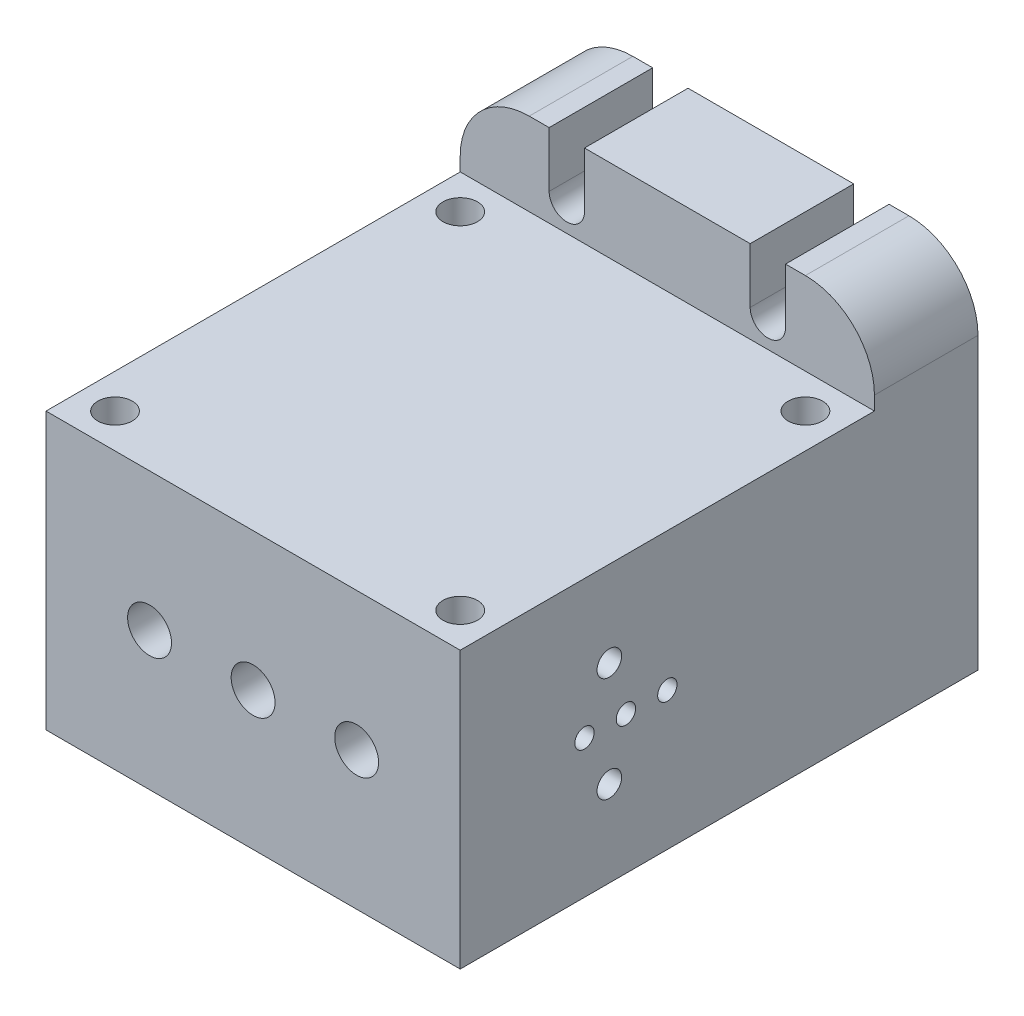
ISO-10303-21;
HEADER;
FILE_DESCRIPTION(('STEP AP214'),'2;1');
FILE_NAME('part.step','',(''),(''),'','','');
FILE_SCHEMA(('AUTOMOTIVE_DESIGN { 1 0 10303 214 1 1 1 1 }'));
ENDSEC;
DATA;
#1=APPLICATION_CONTEXT('core data for automotive mechanical design processes');
#2=APPLICATION_PROTOCOL_DEFINITION('international standard','automotive_design',2000,#1);
#3=PRODUCT_CONTEXT('',#1,'mechanical');
#4=PRODUCT('Part','Part','',(#3));
#5=PRODUCT_RELATED_PRODUCT_CATEGORY('part','',(#4));
#6=PRODUCT_DEFINITION_FORMATION('','',#4);
#7=PRODUCT_DEFINITION_CONTEXT('part definition',#1,'design');
#8=PRODUCT_DEFINITION('design','',#6,#7);
#9=PRODUCT_DEFINITION_SHAPE('','',#8);
#10=(LENGTH_UNIT() NAMED_UNIT(*) SI_UNIT(.MILLI.,.METRE.));
#11=(NAMED_UNIT(*) PLANE_ANGLE_UNIT() SI_UNIT($,.RADIAN.));
#12=(NAMED_UNIT(*) SI_UNIT($,.STERADIAN.) SOLID_ANGLE_UNIT());
#13=UNCERTAINTY_MEASURE_WITH_UNIT(LENGTH_MEASURE(1.E-05),#10,'distance_accuracy_value','');
#14=(GEOMETRIC_REPRESENTATION_CONTEXT(3) GLOBAL_UNCERTAINTY_ASSIGNED_CONTEXT((#13)) GLOBAL_UNIT_ASSIGNED_CONTEXT((#10,
#11,#12)) REPRESENTATION_CONTEXT('',''));
#15=CARTESIAN_POINT('',(0.,0.,0.));
#16=DIRECTION('',(0.,0.,1.));
#17=DIRECTION('',(1.,0.,0.));
#18=AXIS2_PLACEMENT_3D('',#15,#16,#17);
#19=CARTESIAN_POINT('',(19.05,33.02,-28.575));
#20=DIRECTION('',(0.,-1.,0.));
#21=DIRECTION('',(0.,0.,-1.));
#22=AXIS2_PLACEMENT_3D('',#19,#20,#21);
#23=PLANE('',#22);
#24=DIRECTION('',(1.,0.,0.));
#25=VECTOR('',#24,1.);
#26=CARTESIAN_POINT('',(19.05,33.02,-19.05));
#27=LINE('',#26,#25);
#28=CARTESIAN_POINT('',(-7.62000000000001,33.02,-19.05));
#29=VERTEX_POINT('',#28);
#30=CARTESIAN_POINT('',(7.62,33.02,-19.05));
#31=VERTEX_POINT('',#30);
#32=EDGE_CURVE('E888',#29,#31,#27,.T.);
#33=ORIENTED_EDGE('',*,*,#32,.T.);
#34=DIRECTION('',(0.,0.,1.));
#35=VECTOR('',#34,1.);
#36=CARTESIAN_POINT('',(7.62,33.02,-28.576));
#37=LINE('',#36,#35);
#38=CARTESIAN_POINT('',(7.62,33.02,-28.575));
#39=VERTEX_POINT('',#38);
#40=EDGE_CURVE('E324',#39,#31,#37,.T.);
#41=ORIENTED_EDGE('',*,*,#40,.F.);
#42=DIRECTION('',(1.,0.,0.));
#43=VECTOR('',#42,1.);
#44=CARTESIAN_POINT('',(19.05,33.02,-28.575));
#45=LINE('',#44,#43);
#46=CARTESIAN_POINT('',(-7.62000000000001,33.02,-28.575));
#47=VERTEX_POINT('',#46);
#48=EDGE_CURVE('E331',#47,#39,#45,.T.);
#49=ORIENTED_EDGE('',*,*,#48,.F.);
#50=DIRECTION('',(0.,0.,1.));
#51=VECTOR('',#50,1.);
#52=CARTESIAN_POINT('',(-7.62000000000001,33.02,-28.576));
#53=LINE('',#52,#51);
#54=EDGE_CURVE('E362',#47,#29,#53,.T.);
#55=ORIENTED_EDGE('',*,*,#54,.T.);
#56=EDGE_LOOP('',(#33,#41,#49,#55));
#57=FACE_BOUND('',#56,.T.);
#58=ADVANCED_FACE('F48',(#57),#23,.F.);
#59=CARTESIAN_POINT('',(-12.7,33.02,-28.575));
#60=VERTEX_POINT('',#59);
#61=CARTESIAN_POINT('',(-10.8712,33.02,-28.575));
#62=VERTEX_POINT('',#61);
#63=EDGE_CURVE('E375',#60,#62,#45,.T.);
#64=ORIENTED_EDGE('',*,*,#63,.F.);
#65=DIRECTION('',(0.,0.,1.));
#66=VECTOR('',#65,1.);
#67=CARTESIAN_POINT('',(-12.7,33.02,-28.575));
#68=LINE('',#67,#66);
#69=CARTESIAN_POINT('',(-12.7,33.02,-19.05));
#70=VERTEX_POINT('',#69);
#71=EDGE_CURVE('E611',#60,#70,#68,.T.);
#72=ORIENTED_EDGE('',*,*,#71,.T.);
#73=CARTESIAN_POINT('',(-10.8712,33.02,-19.05));
#74=VERTEX_POINT('',#73);
#75=EDGE_CURVE('E385',#70,#74,#27,.T.);
#76=ORIENTED_EDGE('',*,*,#75,.T.);
#77=DIRECTION('',(0.,0.,1.));
#78=VECTOR('',#77,1.);
#79=CARTESIAN_POINT('',(-10.8712,33.02,-28.576));
#80=LINE('',#79,#78);
#81=EDGE_CURVE('E358',#62,#74,#80,.T.);
#82=ORIENTED_EDGE('',*,*,#81,.F.);
#83=EDGE_LOOP('',(#64,#72,#76,#82));
#84=FACE_BOUND('',#83,.T.);
#85=ADVANCED_FACE('F893',(#84),#23,.F.);
#86=CARTESIAN_POINT('',(-19.05,0.,-19.05));
#87=DIRECTION('',(0.,1.,0.));
#88=DIRECTION('',(0.,0.,1.));
#89=AXIS2_PLACEMENT_3D('',#86,#87,#88);
#90=PLANE('',#89);
#91=CARTESIAN_POINT('',(0.,0.,-3.81));
#92=DIRECTION('',(0.,-1.,0.));
#93=DIRECTION('',(0.,0.,-1.));
#94=AXIS2_PLACEMENT_3D('',#91,#92,#93);
#95=CIRCLE('',#94,0.888999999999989);
#96=CARTESIAN_POINT('',(0.,0.,-4.69899999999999));
#97=VERTEX_POINT('',#96);
#98=EDGE_CURVE('E460',#97,#97,#95,.T.);
#99=ORIENTED_EDGE('',*,*,#98,.F.);
#100=EDGE_LOOP('',(#99));
#101=FACE_BOUND('',#100,.T.);
#102=CARTESIAN_POINT('',(0.,0.,0.));
#103=DIRECTION('',(0.,-1.,0.));
#104=DIRECTION('',(0.,0.,-1.));
#105=AXIS2_PLACEMENT_3D('',#102,#103,#104);
#106=CIRCLE('',#105,14.2875);
#107=CARTESIAN_POINT('',(0.,0.,-14.2875));
#108=VERTEX_POINT('',#107);
#109=EDGE_CURVE('E382',#108,#108,#106,.T.);
#110=ORIENTED_EDGE('',*,*,#109,.T.);
#111=EDGE_LOOP('',(#110));
#112=FACE_BOUND('',#111,.T.);
#113=ADVANCED_FACE('F849',(#101,#112),#90,.F.);
#114=CARTESIAN_POINT('',(-19.05,25.4,19.05));
#115=DIRECTION('',(1.,0.,0.));
#116=DIRECTION('',(0.,0.,-1.));
#117=AXIS2_PLACEMENT_3D('',#114,#115,#116);
#118=PLANE('',#117);
#119=CARTESIAN_POINT('',(-19.05,7.874,1.524));
#120=DIRECTION('',(-1.,0.,0.));
#121=DIRECTION('',(0.,0.,1.));
#122=AXIS2_PLACEMENT_3D('',#119,#120,#121);
#123=CIRCLE('',#122,1.13029999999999);
#124=CARTESIAN_POINT('',(-19.05,7.874,2.65429999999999));
#125=VERTEX_POINT('',#124);
#126=EDGE_CURVE('E448',#125,#125,#123,.T.);
#127=ORIENTED_EDGE('',*,*,#126,.F.);
#128=EDGE_LOOP('',(#127));
#129=FACE_BOUND('',#128,.T.);
#130=CARTESIAN_POINT('',(-19.05,17.526,1.524));
#131=DIRECTION('',(-1.,0.,0.));
#132=DIRECTION('',(0.,0.,1.));
#133=AXIS2_PLACEMENT_3D('',#130,#131,#132);
#134=CIRCLE('',#133,1.13029999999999);
#135=CARTESIAN_POINT('',(-19.05,17.526,2.65429999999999));
#136=VERTEX_POINT('',#135);
#137=EDGE_CURVE('E454',#136,#136,#134,.T.);
#138=ORIENTED_EDGE('',*,*,#137,.F.);
#139=EDGE_LOOP('',(#138));
#140=FACE_BOUND('',#139,.T.);
#141=CARTESIAN_POINT('',(-19.05,12.7,-3.81));
#142=DIRECTION('',(-1.,0.,0.));
#143=DIRECTION('',(0.,0.,1.));
#144=AXIS2_PLACEMENT_3D('',#141,#142,#143);
#145=CIRCLE('',#144,0.888999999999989);
#146=CARTESIAN_POINT('',(-19.05,12.7,-2.92100000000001));
#147=VERTEX_POINT('',#146);
#148=EDGE_CURVE('E483',#147,#147,#145,.T.);
#149=ORIENTED_EDGE('',*,*,#148,.F.);
#150=EDGE_LOOP('',(#149));
#151=FACE_BOUND('',#150,.T.);
#152=CARTESIAN_POINT('',(-19.05,12.7,3.81));
#153=DIRECTION('',(-1.,0.,0.));
#154=DIRECTION('',(0.,0.,1.));
#155=AXIS2_PLACEMENT_3D('',#152,#153,#154);
#156=CIRCLE('',#155,0.888999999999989);
#157=CARTESIAN_POINT('',(-19.05,12.7,4.69899999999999));
#158=VERTEX_POINT('',#157);
#159=EDGE_CURVE('E504',#158,#158,#156,.T.);
#160=ORIENTED_EDGE('',*,*,#159,.F.);
#161=EDGE_LOOP('',(#160));
#162=FACE_BOUND('',#161,.T.);
#163=CARTESIAN_POINT('',(-19.05,12.7,0.));
#164=DIRECTION('',(1.,0.,0.));
#165=DIRECTION('',(0.,0.,-1.));
#166=AXIS2_PLACEMENT_3D('',#163,#164,#165);
#167=CIRCLE('',#166,0.888999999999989);
#168=CARTESIAN_POINT('',(-19.05,12.7,-0.888999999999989));
#169=VERTEX_POINT('',#168);
#170=EDGE_CURVE('E802',#169,#169,#167,.T.);
#171=ORIENTED_EDGE('',*,*,#170,.T.);
#172=EDGE_LOOP('',(#171));
#173=FACE_BOUND('',#172,.T.);
#174=DIRECTION('',(0.,1.,0.));
#175=VECTOR('',#174,1.);
#176=CARTESIAN_POINT('',(-19.05,33.02,-19.05));
#177=LINE('',#176,#175);
#178=CARTESIAN_POINT('',(-19.05,25.4,-19.05));
#179=VERTEX_POINT('',#178);
#180=CARTESIAN_POINT('',(-19.05,26.67,-19.05));
#181=VERTEX_POINT('',#180);
#182=EDGE_CURVE('E370',#179,#181,#177,.T.);
#183=ORIENTED_EDGE('',*,*,#182,.T.);
#184=DIRECTION('',(0.,0.,1.));
#185=VECTOR('',#184,1.);
#186=CARTESIAN_POINT('',(-19.05,26.67,19.05));
#187=LINE('',#186,#185);
#188=CARTESIAN_POINT('',(-19.05,26.67,-28.575));
#189=VERTEX_POINT('',#188);
#190=EDGE_CURVE('E858',#181,#189,#187,.F.);
#191=ORIENTED_EDGE('',*,*,#190,.T.);
#192=DIRECTION('',(0.,1.,0.));
#193=VECTOR('',#192,1.);
#194=CARTESIAN_POINT('',(-19.05,0.,-28.575));
#195=LINE('',#194,#193);
#196=CARTESIAN_POINT('',(-19.05,0.,-28.575));
#197=VERTEX_POINT('',#196);
#198=EDGE_CURVE('E371',#197,#189,#195,.T.);
#199=ORIENTED_EDGE('',*,*,#198,.F.);
#200=DIRECTION('',(0.,0.,1.));
#201=VECTOR('',#200,1.);
#202=CARTESIAN_POINT('',(-19.05,0.,19.05));
#203=LINE('',#202,#201);
#204=CARTESIAN_POINT('',(-19.05,0.,19.05));
#205=VERTEX_POINT('',#204);
#206=EDGE_CURVE('E631',#197,#205,#203,.T.);
#207=ORIENTED_EDGE('',*,*,#206,.T.);
#208=DIRECTION('',(0.,-1.,0.));
#209=VECTOR('',#208,1.);
#210=CARTESIAN_POINT('',(-19.05,25.4,19.05));
#211=LINE('',#210,#209);
#212=CARTESIAN_POINT('',(-19.05,25.4,19.05));
#213=VERTEX_POINT('',#212);
#214=EDGE_CURVE('E642',#213,#205,#211,.T.);
#215=ORIENTED_EDGE('',*,*,#214,.F.);
#216=DIRECTION('',(0.,0.,1.));
#217=VECTOR('',#216,1.);
#218=CARTESIAN_POINT('',(-19.05,25.4,19.05));
#219=LINE('',#218,#217);
#220=EDGE_CURVE('E624',#179,#213,#219,.T.);
#221=ORIENTED_EDGE('',*,*,#220,.F.);
#222=EDGE_LOOP('',(#183,#191,#199,#207,#215,#221));
#223=FACE_BOUND('',#222,.T.);
#224=ADVANCED_FACE('F845',(#129,#140,#151,#162,#173,#223),#118,.F.);
#225=CARTESIAN_POINT('',(19.05,25.4,19.05));
#226=DIRECTION('',(0.,0.,-1.));
#227=DIRECTION('',(-1.,0.,0.));
#228=AXIS2_PLACEMENT_3D('',#225,#226,#227);
#229=PLANE('',#228);
#230=CARTESIAN_POINT('',(9.525,12.7,19.05));
#231=DIRECTION('',(0.,0.,1.));
#232=DIRECTION('',(1.,0.,0.));
#233=AXIS2_PLACEMENT_3D('',#230,#231,#232);
#234=CIRCLE('',#233,2.0193);
#235=CARTESIAN_POINT('',(11.5443,12.7,19.05));
#236=VERTEX_POINT('',#235);
#237=EDGE_CURVE('E427',#236,#236,#234,.T.);
#238=ORIENTED_EDGE('',*,*,#237,.F.);
#239=EDGE_LOOP('',(#238));
#240=FACE_BOUND('',#239,.T.);
#241=CARTESIAN_POINT('',(0.,12.7,19.05));
#242=DIRECTION('',(0.,0.,1.));
#243=DIRECTION('',(1.,0.,0.));
#244=AXIS2_PLACEMENT_3D('',#241,#242,#243);
#245=CIRCLE('',#244,2.0193);
#246=CARTESIAN_POINT('',(2.0193,12.7,19.05));
#247=VERTEX_POINT('',#246);
#248=EDGE_CURVE('E434',#247,#247,#245,.T.);
#249=ORIENTED_EDGE('',*,*,#248,.F.);
#250=EDGE_LOOP('',(#249));
#251=FACE_BOUND('',#250,.T.);
#252=CARTESIAN_POINT('',(-9.525,12.7,19.05));
#253=DIRECTION('',(0.,0.,1.));
#254=DIRECTION('',(1.,0.,0.));
#255=AXIS2_PLACEMENT_3D('',#252,#253,#254);
#256=CIRCLE('',#255,2.0193);
#257=CARTESIAN_POINT('',(-7.5057,12.7,19.05));
#258=VERTEX_POINT('',#257);
#259=EDGE_CURVE('E441',#258,#258,#256,.T.);
#260=ORIENTED_EDGE('',*,*,#259,.F.);
#261=EDGE_LOOP('',(#260));
#262=FACE_BOUND('',#261,.T.);
#263=DIRECTION('',(1.,0.,0.));
#264=VECTOR('',#263,1.);
#265=CARTESIAN_POINT('',(19.05,0.,19.05));
#266=LINE('',#265,#264);
#267=CARTESIAN_POINT('',(19.05,0.,19.05));
#268=VERTEX_POINT('',#267);
#269=EDGE_CURVE('E634',#205,#268,#266,.T.);
#270=ORIENTED_EDGE('',*,*,#269,.T.);
#271=DIRECTION('',(0.,-1.,0.));
#272=VECTOR('',#271,1.);
#273=CARTESIAN_POINT('',(19.05,25.4,19.05));
#274=LINE('',#273,#272);
#275=CARTESIAN_POINT('',(19.05,25.4,19.05));
#276=VERTEX_POINT('',#275);
#277=EDGE_CURVE('E622',#276,#268,#274,.T.);
#278=ORIENTED_EDGE('',*,*,#277,.F.);
#279=DIRECTION('',(1.,0.,0.));
#280=VECTOR('',#279,1.);
#281=CARTESIAN_POINT('',(19.05,25.4,19.05));
#282=LINE('',#281,#280);
#283=EDGE_CURVE('E629',#213,#276,#282,.T.);
#284=ORIENTED_EDGE('',*,*,#283,.F.);
#285=ORIENTED_EDGE('',*,*,#214,.T.);
#286=EDGE_LOOP('',(#270,#278,#284,#285));
#287=FACE_BOUND('',#286,.T.);
#288=ADVANCED_FACE('F848',(#240,#251,#262,#287),#229,.F.);
#289=CARTESIAN_POINT('',(19.05,25.4,19.05));
#290=DIRECTION('',(-1.,0.,0.));
#291=DIRECTION('',(0.,0.,1.));
#292=AXIS2_PLACEMENT_3D('',#289,#290,#291);
#293=PLANE('',#292);
#294=CARTESIAN_POINT('',(19.05,17.526,5.334));
#295=DIRECTION('',(1.,0.,0.));
#296=DIRECTION('',(0.,0.,-1.));
#297=AXIS2_PLACEMENT_3D('',#294,#295,#296);
#298=CIRCLE('',#297,1.13029999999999);
#299=CARTESIAN_POINT('',(19.05,17.526,4.20370000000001));
#300=VERTEX_POINT('',#299);
#301=EDGE_CURVE('E693',#300,#300,#298,.T.);
#302=ORIENTED_EDGE('',*,*,#301,.F.);
#303=EDGE_LOOP('',(#302));
#304=FACE_BOUND('',#303,.T.);
#305=CARTESIAN_POINT('',(19.05,7.874,5.334));
#306=DIRECTION('',(1.,0.,0.));
#307=DIRECTION('',(0.,0.,-1.));
#308=AXIS2_PLACEMENT_3D('',#305,#306,#307);
#309=CIRCLE('',#308,1.1303);
#310=CARTESIAN_POINT('',(19.05,7.874,4.2037));
#311=VERTEX_POINT('',#310);
#312=EDGE_CURVE('E1757',#311,#311,#309,.T.);
#313=ORIENTED_EDGE('',*,*,#312,.F.);
#314=EDGE_LOOP('',(#313));
#315=FACE_BOUND('',#314,.T.);
#316=CARTESIAN_POINT('',(19.05,12.7,0.));
#317=DIRECTION('',(1.,0.,0.));
#318=DIRECTION('',(0.,0.,-1.));
#319=AXIS2_PLACEMENT_3D('',#316,#317,#318);
#320=CIRCLE('',#319,0.888999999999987);
#321=CARTESIAN_POINT('',(19.05,12.7,-0.888999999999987));
#322=VERTEX_POINT('',#321);
#323=EDGE_CURVE('E1765',#322,#322,#320,.T.);
#324=ORIENTED_EDGE('',*,*,#323,.F.);
#325=EDGE_LOOP('',(#324));
#326=FACE_BOUND('',#325,.T.);
#327=CARTESIAN_POINT('',(19.05,12.7,7.62));
#328=DIRECTION('',(1.,0.,0.));
#329=DIRECTION('',(0.,0.,-1.));
#330=AXIS2_PLACEMENT_3D('',#327,#328,#329);
#331=CIRCLE('',#330,0.888999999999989);
#332=CARTESIAN_POINT('',(19.05,12.7,6.73100000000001));
#333=VERTEX_POINT('',#332);
#334=EDGE_CURVE('E797',#333,#333,#331,.T.);
#335=ORIENTED_EDGE('',*,*,#334,.F.);
#336=EDGE_LOOP('',(#335));
#337=FACE_BOUND('',#336,.T.);
#338=CARTESIAN_POINT('',(19.05,12.7,3.81));
#339=DIRECTION('',(1.,0.,0.));
#340=DIRECTION('',(0.,0.,-1.));
#341=AXIS2_PLACEMENT_3D('',#338,#339,#340);
#342=CIRCLE('',#341,0.888999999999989);
#343=CARTESIAN_POINT('',(19.05,12.7,2.92100000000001));
#344=VERTEX_POINT('',#343);
#345=EDGE_CURVE('E806',#344,#344,#342,.T.);
#346=ORIENTED_EDGE('',*,*,#345,.F.);
#347=EDGE_LOOP('',(#346));
#348=FACE_BOUND('',#347,.T.);
#349=DIRECTION('',(0.,-1.,0.));
#350=VECTOR('',#349,1.);
#351=CARTESIAN_POINT('',(19.05,33.02,-28.575));
#352=LINE('',#351,#350);
#353=CARTESIAN_POINT('',(19.05,26.67,-28.575));
#354=VERTEX_POINT('',#353);
#355=CARTESIAN_POINT('',(19.05,0.,-28.575));
#356=VERTEX_POINT('',#355);
#357=EDGE_CURVE('E377',#354,#356,#352,.T.);
#358=ORIENTED_EDGE('',*,*,#357,.F.);
#359=DIRECTION('',(0.,0.,1.));
#360=VECTOR('',#359,1.);
#361=CARTESIAN_POINT('',(19.05,26.67,19.05));
#362=LINE('',#361,#360);
#363=CARTESIAN_POINT('',(19.05,26.67,-19.05));
#364=VERTEX_POINT('',#363);
#365=EDGE_CURVE('E56',#354,#364,#362,.T.);
#366=ORIENTED_EDGE('',*,*,#365,.T.);
#367=DIRECTION('',(0.,-1.,0.));
#368=VECTOR('',#367,1.);
#369=CARTESIAN_POINT('',(19.05,0.,-19.05));
#370=LINE('',#369,#368);
#371=CARTESIAN_POINT('',(19.05,25.4,-19.05));
#372=VERTEX_POINT('',#371);
#373=EDGE_CURVE('E374',#364,#372,#370,.T.);
#374=ORIENTED_EDGE('',*,*,#373,.T.);
#375=DIRECTION('',(0.,0.,-1.));
#376=VECTOR('',#375,1.);
#377=CARTESIAN_POINT('',(19.05,25.4,19.05));
#378=LINE('',#377,#376);
#379=EDGE_CURVE('E623',#276,#372,#378,.T.);
#380=ORIENTED_EDGE('',*,*,#379,.F.);
#381=ORIENTED_EDGE('',*,*,#277,.T.);
#382=DIRECTION('',(0.,0.,-1.));
#383=VECTOR('',#382,1.);
#384=CARTESIAN_POINT('',(19.05,0.,19.05));
#385=LINE('',#384,#383);
#386=EDGE_CURVE('E637',#268,#356,#385,.T.);
#387=ORIENTED_EDGE('',*,*,#386,.T.);
#388=EDGE_LOOP('',(#358,#366,#374,#380,#381,#387));
#389=FACE_BOUND('',#388,.T.);
#390=ADVANCED_FACE('F880',(#304,#315,#326,#337,#348,#389),#293,.F.);
#391=CARTESIAN_POINT('',(-19.05,25.4,-19.05));
#392=DIRECTION('',(0.,1.,0.));
#393=DIRECTION('',(0.,0.,1.));
#394=AXIS2_PLACEMENT_3D('',#391,#392,#393);
#395=PLANE('',#394);
#396=CARTESIAN_POINT('',(-15.875,25.4,-15.875));
#397=DIRECTION('',(0.,1.,0.));
#398=DIRECTION('',(0.,0.,1.));
#399=AXIS2_PLACEMENT_3D('',#396,#397,#398);
#400=CIRCLE('',#399,1.58749999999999);
#401=CARTESIAN_POINT('',(-15.875,25.4,-14.2875));
#402=VERTEX_POINT('',#401);
#403=EDGE_CURVE('E406',#402,#402,#400,.T.);
#404=ORIENTED_EDGE('',*,*,#403,.F.);
#405=EDGE_LOOP('',(#404));
#406=FACE_BOUND('',#405,.T.);
#407=CARTESIAN_POINT('',(15.875,25.4,-15.875));
#408=DIRECTION('',(0.,1.,0.));
#409=DIRECTION('',(0.,0.,1.));
#410=AXIS2_PLACEMENT_3D('',#407,#408,#409);
#411=CIRCLE('',#410,1.58749999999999);
#412=CARTESIAN_POINT('',(15.875,25.4,-14.2875));
#413=VERTEX_POINT('',#412);
#414=EDGE_CURVE('E412',#413,#413,#411,.T.);
#415=ORIENTED_EDGE('',*,*,#414,.F.);
#416=EDGE_LOOP('',(#415));
#417=FACE_BOUND('',#416,.T.);
#418=CARTESIAN_POINT('',(-15.875,25.4,15.875));
#419=DIRECTION('',(0.,1.,0.));
#420=DIRECTION('',(0.,0.,1.));
#421=AXIS2_PLACEMENT_3D('',#418,#419,#420);
#422=CIRCLE('',#421,1.58749999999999);
#423=CARTESIAN_POINT('',(-15.875,25.4,17.4625));
#424=VERTEX_POINT('',#423);
#425=EDGE_CURVE('E418',#424,#424,#422,.T.);
#426=ORIENTED_EDGE('',*,*,#425,.F.);
#427=EDGE_LOOP('',(#426));
#428=FACE_BOUND('',#427,.T.);
#429=CARTESIAN_POINT('',(15.875,25.4,15.875));
#430=DIRECTION('',(0.,1.,0.));
#431=DIRECTION('',(0.,0.,1.));
#432=AXIS2_PLACEMENT_3D('',#429,#430,#431);
#433=CIRCLE('',#432,1.58749999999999);
#434=CARTESIAN_POINT('',(15.875,25.4,17.4625));
#435=VERTEX_POINT('',#434);
#436=EDGE_CURVE('E424',#435,#435,#433,.T.);
#437=ORIENTED_EDGE('',*,*,#436,.F.);
#438=EDGE_LOOP('',(#437));
#439=FACE_BOUND('',#438,.T.);
#440=ORIENTED_EDGE('',*,*,#220,.T.);
#441=ORIENTED_EDGE('',*,*,#283,.T.);
#442=ORIENTED_EDGE('',*,*,#379,.T.);
#443=DIRECTION('',(-1.,0.,0.));
#444=VECTOR('',#443,1.);
#445=CARTESIAN_POINT('',(19.05,25.4,-19.05));
#446=LINE('',#445,#444);
#447=EDGE_CURVE('E618',#372,#179,#446,.T.);
#448=ORIENTED_EDGE('',*,*,#447,.T.);
#449=EDGE_LOOP('',(#440,#441,#442,#448));
#450=FACE_BOUND('',#449,.T.);
#451=ADVANCED_FACE('F774',(#406,#417,#428,#439,#450),#395,.T.);
#452=CARTESIAN_POINT('',(0.,0.,0.));
#453=DIRECTION('',(0.,-1.,0.));
#454=DIRECTION('',(0.,0.,-1.));
#455=AXIS2_PLACEMENT_3D('',#452,#453,#454);
#456=CIRCLE('',#455,18.0975);
#457=CARTESIAN_POINT('',(0.,0.,-18.0975));
#458=VERTEX_POINT('',#457);
#459=EDGE_CURVE('E395',#458,#458,#456,.T.);
#460=ORIENTED_EDGE('',*,*,#459,.F.);
#461=EDGE_LOOP('',(#460));
#462=FACE_BOUND('',#461,.T.);
#463=CARTESIAN_POINT('',(-15.875,0.,-15.875));
#464=DIRECTION('',(0.,-1.,0.));
#465=DIRECTION('',(0.,0.,-1.));
#466=AXIS2_PLACEMENT_3D('',#463,#464,#465);
#467=CIRCLE('',#466,1.58749999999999);
#468=CARTESIAN_POINT('',(-15.875,0.,-17.4625));
#469=VERTEX_POINT('',#468);
#470=EDGE_CURVE('E401',#469,#469,#467,.T.);
#471=ORIENTED_EDGE('',*,*,#470,.F.);
#472=EDGE_LOOP('',(#471));
#473=FACE_BOUND('',#472,.T.);
#474=CARTESIAN_POINT('',(15.875,0.,-15.875));
#475=DIRECTION('',(0.,-1.,0.));
#476=DIRECTION('',(0.,0.,-1.));
#477=AXIS2_PLACEMENT_3D('',#474,#475,#476);
#478=CIRCLE('',#477,1.58749999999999);
#479=CARTESIAN_POINT('',(15.875,0.,-17.4625));
#480=VERTEX_POINT('',#479);
#481=EDGE_CURVE('E409',#480,#480,#478,.T.);
#482=ORIENTED_EDGE('',*,*,#481,.F.);
#483=EDGE_LOOP('',(#482));
#484=FACE_BOUND('',#483,.T.);
#485=CARTESIAN_POINT('',(-15.875,0.,15.875));
#486=DIRECTION('',(0.,-1.,0.));
#487=DIRECTION('',(0.,0.,-1.));
#488=AXIS2_PLACEMENT_3D('',#485,#486,#487);
#489=CIRCLE('',#488,1.58749999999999);
#490=CARTESIAN_POINT('',(-15.875,0.,14.2875));
#491=VERTEX_POINT('',#490);
#492=EDGE_CURVE('E415',#491,#491,#489,.T.);
#493=ORIENTED_EDGE('',*,*,#492,.F.);
#494=EDGE_LOOP('',(#493));
#495=FACE_BOUND('',#494,.T.);
#496=CARTESIAN_POINT('',(15.875,0.,15.875));
#497=DIRECTION('',(0.,-1.,0.));
#498=DIRECTION('',(0.,0.,-1.));
#499=AXIS2_PLACEMENT_3D('',#496,#497,#498);
#500=CIRCLE('',#499,1.58749999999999);
#501=CARTESIAN_POINT('',(15.875,0.,14.2875));
#502=VERTEX_POINT('',#501);
#503=EDGE_CURVE('E421',#502,#502,#500,.T.);
#504=ORIENTED_EDGE('',*,*,#503,.F.);
#505=EDGE_LOOP('',(#504));
#506=FACE_BOUND('',#505,.T.);
#507=ORIENTED_EDGE('',*,*,#206,.F.);
#508=DIRECTION('',(-1.,0.,0.));
#509=VECTOR('',#508,1.);
#510=CARTESIAN_POINT('',(-19.05,0.,-28.575));
#511=LINE('',#510,#509);
#512=EDGE_CURVE('E379',#356,#197,#511,.T.);
#513=ORIENTED_EDGE('',*,*,#512,.F.);
#514=ORIENTED_EDGE('',*,*,#386,.F.);
#515=ORIENTED_EDGE('',*,*,#269,.F.);
#516=EDGE_LOOP('',(#507,#513,#514,#515));
#517=FACE_BOUND('',#516,.T.);
#518=ADVANCED_FACE('F904',(#462,#473,#484,#495,#506,#517),#90,.F.);
#519=CARTESIAN_POINT('',(19.05,12.7,3.81));
#520=DIRECTION('',(1.,0.,0.));
#521=DIRECTION('',(0.,0.,-1.));
#522=AXIS2_PLACEMENT_3D('',#519,#520,#521);
#523=CYLINDRICAL_SURFACE('',#522,0.888999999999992);
#524=CARTESIAN_POINT('',(0.,12.7,3.81));
#525=DIRECTION('',(0.707106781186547,0.,0.707106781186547));
#526=DIRECTION('',(0.707106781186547,0.,-0.707106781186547));
#527=AXIS2_PLACEMENT_3D('',#524,#525,#526);
#528=ELLIPSE('',#527,1.25723585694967,0.888999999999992);
#529=CARTESIAN_POINT('',(0.508000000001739,11.9704405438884,3.30200000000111));
#530=VERTEX_POINT('',#529);
#531=CARTESIAN_POINT('',(0.,11.811,3.81));
#532=VERTEX_POINT('',#531);
#533=EDGE_CURVE('E730',#530,#532,#528,.F.);
#534=ORIENTED_EDGE('',*,*,#533,.T.);
#535=CARTESIAN_POINT('',(0.,12.7,3.81));
#536=DIRECTION('',(0.707106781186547,0.,-0.707106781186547));
#537=DIRECTION('',(0.707106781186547,0.,0.707106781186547));
#538=AXIS2_PLACEMENT_3D('',#535,#536,#537);
#539=ELLIPSE('',#538,1.25723585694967,0.888999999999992);
#540=CARTESIAN_POINT('',(0.,13.589,3.81));
#541=VERTEX_POINT('',#540);
#542=EDGE_CURVE('E1717',#532,#541,#539,.F.);
#543=ORIENTED_EDGE('',*,*,#542,.T.);
#544=CARTESIAN_POINT('',(0.508000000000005,13.4295594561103,3.302));
#545=VERTEX_POINT('',#544);
#546=EDGE_CURVE('E1719',#541,#545,#528,.F.);
#547=ORIENTED_EDGE('',*,*,#546,.T.);
#548=CARTESIAN_POINT('',(0.777066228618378,13.5092338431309,3.44194893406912));
#549=CARTESIAN_POINT('',(0.744341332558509,13.5015125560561,3.42498396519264));
#550=CARTESIAN_POINT('',(0.711729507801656,13.4931797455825,3.40806763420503));
#551=CARTESIAN_POINT('',(0.646472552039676,13.4750831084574,3.37417600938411));
#552=CARTESIAN_POINT('',(0.613830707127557,13.4653050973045,3.35720197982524));
#553=CARTESIAN_POINT('',(0.544447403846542,13.4428086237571,3.32105258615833));
#554=CARTESIAN_POINT('',(0.507765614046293,13.429870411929,3.30189860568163));
#555=CARTESIAN_POINT('',(0.435047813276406,13.4018094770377,3.26378801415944));
#556=CARTESIAN_POINT('',(0.39901284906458,13.3866835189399,3.24483174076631));
#557=CARTESIAN_POINT('',(0.328291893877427,13.3539620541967,3.20728404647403));
#558=CARTESIAN_POINT('',(0.293598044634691,13.3363851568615,3.18869097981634));
#559=CARTESIAN_POINT('',(0.225874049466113,13.298106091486,3.1517328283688));
#560=CARTESIAN_POINT('',(0.192838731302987,13.2774145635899,3.13336718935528));
#561=CARTESIAN_POINT('',(0.153907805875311,13.2474249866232,3.10949214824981));
#562=CARTESIAN_POINT('',(0.145761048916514,13.2407972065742,3.10435582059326));
#563=CARTESIAN_POINT('',(0.130108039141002,13.2269113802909,3.09392607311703));
#564=CARTESIAN_POINT('',(0.122601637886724,13.2196534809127,3.0886326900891));
#565=CARTESIAN_POINT('',(0.111477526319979,13.2071883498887,3.07985314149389));
#566=CARTESIAN_POINT('',(0.10747532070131,13.2022674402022,3.07645582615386));
#567=CARTESIAN_POINT('',(0.10024208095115,13.1919727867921,3.06951216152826));
#568=CARTESIAN_POINT('',(0.0970097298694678,13.1865998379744,3.06596607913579));
#569=CARTESIAN_POINT('',(0.0924767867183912,13.1768262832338,3.05967878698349));
#570=CARTESIAN_POINT('',(0.0908918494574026,13.172540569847,3.05697058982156));
#571=CARTESIAN_POINT('',(0.088619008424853,13.1637626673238,3.0515333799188));
#572=CARTESIAN_POINT('',(0.0879279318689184,13.1592712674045,3.04880447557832));
#573=CARTESIAN_POINT('',(0.0875028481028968,13.1502078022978,3.04340894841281));
#574=CARTESIAN_POINT('',(0.0877691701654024,13.1456357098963,3.04074234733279));
#575=CARTESIAN_POINT('',(0.0891346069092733,13.1365306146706,3.03553922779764));
#576=CARTESIAN_POINT('',(0.0902365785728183,13.1319978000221,3.03300318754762));
#577=CARTESIAN_POINT('',(0.0964656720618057,13.1117297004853,3.02188367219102));
#578=CARTESIAN_POINT('',(0.104730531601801,13.0966077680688,3.01419930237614));
#579=CARTESIAN_POINT('',(0.122495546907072,13.0665237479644,2.9999008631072));
#580=CARTESIAN_POINT('',(0.132013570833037,13.0515682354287,2.99330618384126));
#581=CARTESIAN_POINT('',(0.160119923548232,13.006365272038,2.97482625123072));
#582=CARTESIAN_POINT('',(0.178502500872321,12.9754270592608,2.96405273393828));
#583=CARTESIAN_POINT('',(0.210506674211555,12.9105558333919,2.94565340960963));
#584=CARTESIAN_POINT('',(0.224171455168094,12.8766537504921,2.93799892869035));
#585=CARTESIAN_POINT('',(0.241268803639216,12.8177107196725,2.92849933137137));
#586=CARTESIAN_POINT('',(0.246586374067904,12.7933996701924,2.92557289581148));
#587=CARTESIAN_POINT('',(0.25354197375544,12.7440660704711,2.92174913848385));
#588=CARTESIAN_POINT('',(0.255178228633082,12.7190431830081,2.92085279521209));
#589=CARTESIAN_POINT('',(0.254568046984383,12.6690443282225,2.92118711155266));
#590=CARTESIAN_POINT('',(0.252319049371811,12.6440684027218,2.9224191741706));
#591=CARTESIAN_POINT('',(0.244203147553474,12.5949121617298,2.92688696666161));
#592=CARTESIAN_POINT('',(0.238334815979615,12.5707321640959,2.93012348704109));
#593=CARTESIAN_POINT('',(0.220583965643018,12.5141131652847,2.9400037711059));
#594=CARTESIAN_POINT('',(0.207228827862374,12.4822902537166,2.94749624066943));
#595=CARTESIAN_POINT('',(0.176676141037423,12.421462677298,2.96515994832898));
#596=CARTESIAN_POINT('',(0.15947231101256,12.3924627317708,2.97533557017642));
#597=CARTESIAN_POINT('',(0.130533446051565,12.3461333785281,2.99422694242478));
#598=CARTESIAN_POINT('',(0.119041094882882,12.3283368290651,3.00216492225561));
#599=CARTESIAN_POINT('',(0.104703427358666,12.3027549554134,3.01464795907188));
#600=CARTESIAN_POINT('',(0.100752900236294,12.2952491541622,3.01843643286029));
#601=CARTESIAN_POINT('',(0.0939821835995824,12.2799630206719,3.02644165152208));
#602=CARTESIAN_POINT('',(0.0911553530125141,12.2721846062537,3.03065568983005));
#603=CARTESIAN_POINT('',(0.0884237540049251,12.2596018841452,3.03773119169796));
#604=CARTESIAN_POINT('',(0.0877967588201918,12.2548822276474,3.04044100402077));
#605=CARTESIAN_POINT('',(0.0875418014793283,12.2454792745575,3.04595716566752));
#606=CARTESIAN_POINT('',(0.0879113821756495,12.2407959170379,3.0487632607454));
#607=CARTESIAN_POINT('',(0.0896422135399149,12.2316319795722,3.05436693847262));
#608=CARTESIAN_POINT('',(0.0910013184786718,12.2271509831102,3.05716452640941));
#609=CARTESIAN_POINT('',(0.0945164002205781,12.2184597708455,3.06269375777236));
#610=CARTESIAN_POINT('',(0.0966750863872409,12.2142505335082,3.06542514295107));
#611=CARTESIAN_POINT('',(0.105075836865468,12.2001813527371,3.07471287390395));
#612=CARTESIAN_POINT('',(0.112685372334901,12.1910222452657,3.0810449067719));
#613=CARTESIAN_POINT('',(0.129249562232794,12.1737600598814,3.09340733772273));
#614=CARTESIAN_POINT('',(0.138214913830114,12.1656664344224,3.09943477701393));
#615=CARTESIAN_POINT('',(0.166526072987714,12.1420739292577,3.11758273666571));
#616=CARTESIAN_POINT('',(0.186926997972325,12.1276773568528,3.12948680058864));
#617=CARTESIAN_POINT('',(0.228844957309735,12.1005575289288,3.15325836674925));
#618=CARTESIAN_POINT('',(0.250364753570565,12.0878387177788,3.16512569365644));
#619=CARTESIAN_POINT('',(0.315881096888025,12.0516667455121,3.20078859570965));
#620=CARTESIAN_POINT('',(0.360904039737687,12.0301483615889,3.22468496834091));
#621=CARTESIAN_POINT('',(0.435289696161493,11.9982372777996,3.26390063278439));
#622=CARTESIAN_POINT('',(0.464244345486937,11.9866845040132,3.27910206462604));
#623=CARTESIAN_POINT('',(0.522540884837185,11.9649578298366,3.30961520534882));
#624=CARTESIAN_POINT('',(0.551882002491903,11.9547815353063,3.32492667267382));
#625=CARTESIAN_POINT('',(0.655053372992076,11.9213273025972,3.37867793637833));
#626=CARTESIAN_POINT('',(0.729756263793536,11.9012309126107,3.41744138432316));
#627=CARTESIAN_POINT('',(0.8804003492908,11.8674083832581,3.49548985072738));
#628=CARTESIAN_POINT('',(0.956343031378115,11.8536905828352,3.53477548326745));
#629=CARTESIAN_POINT('',(1.10954494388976,11.8318998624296,3.6139665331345));
#630=CARTESIAN_POINT('',(1.18680987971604,11.8238764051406,3.65387437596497));
#631=CARTESIAN_POINT('',(1.34145294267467,11.8133791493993,3.73371189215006));
#632=CARTESIAN_POINT('',(1.41883025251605,11.8108909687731,3.77364123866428));
#633=CARTESIAN_POINT('',(1.49618609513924,11.8110071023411,3.8135535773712));
#634=B_SPLINE_CURVE_WITH_KNOTS('',3,(#548,#549,#550,#551,#552,#553,#554,#555,#556,#557,#558,
#559,#560,#561,#562,#563,#564,#565,#566,#567,#568,#569,#570,#571,#572,#573,#574,#575,#576,#577,
#578,#579,#580,#581,#582,#583,#584,#585,#586,#587,#588,#589,#590,#591,#592,#593,#594,#595,#596,
#597,#598,#599,#600,#601,#602,#603,#604,#605,#606,#607,#608,#609,#610,#611,#612,#613,#614,#615,
#616,#617,#618,#619,#620,#621,#622,#623,#624,#625,#626,#627,#628,#629,#630,#631,#632,#633),
.UNSPECIFIED.,.F.,.F.,(4,2,2,2,2,2,2,2,2,2,2,2,2,2,2,2,2,2,2,2,2,2,2,2,2,2,2,2,2,2,2,2,2,2,2,2,
2,2,2,2,2,2,4),(0.,0.112985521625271,0.227164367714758,0.357187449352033,0.487404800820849,
0.616682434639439,0.745528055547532,0.780584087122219,0.815631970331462,0.837186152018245,
0.858703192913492,0.87457314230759,0.890386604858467,0.906205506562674,0.922078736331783,
0.978031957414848,1.03489308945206,1.14720117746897,1.25845214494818,1.3333042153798,
1.40819235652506,1.48312988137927,1.55809697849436,1.66339171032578,1.76885955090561,
1.83663775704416,1.8644813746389,1.8921578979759,1.90851570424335,1.92483321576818,
1.94111544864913,1.95745336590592,1.99759152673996,2.03806470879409,2.12084239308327,
2.20383513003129,2.36953933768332,2.47357172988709,2.57742078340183,2.83666930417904,
3.09625580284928,3.35807042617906,3.61920398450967),.UNSPECIFIED.);
#635=EDGE_CURVE('E724',#545,#530,#634,.T.);
#636=ORIENTED_EDGE('',*,*,#635,.T.);
#637=EDGE_LOOP('',(#534,#543,#547,#636));
#638=FACE_BOUND('',#637,.T.);
#639=ORIENTED_EDGE('',*,*,#345,.T.);
#640=EDGE_LOOP('',(#639));
#641=FACE_BOUND('',#640,.T.);
#642=ADVANCED_FACE('F707',(#638,#641),#523,.F.);
#643=CARTESIAN_POINT('',(19.05,12.7,7.62));
#644=DIRECTION('',(1.,0.,0.));
#645=DIRECTION('',(0.,0.,-1.));
#646=AXIS2_PLACEMENT_3D('',#643,#644,#645);
#647=CYLINDRICAL_SURFACE('',#646,0.888999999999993);
#648=CARTESIAN_POINT('',(9.525,12.7,7.62));
#649=DIRECTION('',(0.707106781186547,0.,0.707106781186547));
#650=DIRECTION('',(0.707106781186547,0.,-0.707106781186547));
#651=AXIS2_PLACEMENT_3D('',#648,#649,#650);
#652=ELLIPSE('',#651,1.25723585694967,0.888999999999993);
#653=CARTESIAN_POINT('',(10.0330000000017,11.9704405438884,7.11200000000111));
#654=VERTEX_POINT('',#653);
#655=CARTESIAN_POINT('',(9.525,11.811,7.62));
#656=VERTEX_POINT('',#655);
#657=EDGE_CURVE('E653',#654,#656,#652,.F.);
#658=ORIENTED_EDGE('',*,*,#657,.T.);
#659=CARTESIAN_POINT('',(9.525,12.7,7.62));
#660=DIRECTION('',(0.707106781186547,0.,-0.707106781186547));
#661=DIRECTION('',(0.707106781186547,0.,0.707106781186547));
#662=AXIS2_PLACEMENT_3D('',#659,#660,#661);
#663=ELLIPSE('',#662,1.25723585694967,0.888999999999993);
#664=CARTESIAN_POINT('',(9.525,13.589,7.62));
#665=VERTEX_POINT('',#664);
#666=EDGE_CURVE('E1740',#656,#665,#663,.F.);
#667=ORIENTED_EDGE('',*,*,#666,.T.);
#668=CARTESIAN_POINT('',(10.033,13.4295594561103,7.112));
#669=VERTEX_POINT('',#668);
#670=EDGE_CURVE('E1743',#665,#669,#652,.F.);
#671=ORIENTED_EDGE('',*,*,#670,.T.);
#672=CARTESIAN_POINT('',(10.8715195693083,13.5859416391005,7.54632224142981));
#673=CARTESIAN_POINT('',(10.8083021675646,13.5832060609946,7.51369181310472));
#674=CARTESIAN_POINT('',(10.7451354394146,13.5786989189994,7.48108114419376));
#675=CARTESIAN_POINT('',(10.6189702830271,13.5659020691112,7.41591528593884));
#676=CARTESIAN_POINT('',(10.5559725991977,13.5576034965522,7.38336040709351));
#677=CARTESIAN_POINT('',(10.4278928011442,13.5365648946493,7.31712195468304));
#678=CARTESIAN_POINT('',(10.3628334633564,13.5236539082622,7.28344799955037));
#679=CARTESIAN_POINT('',(10.2337233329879,13.4930219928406,7.21652293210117));
#680=CARTESIAN_POINT('',(10.169671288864,13.4753076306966,7.18327130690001));
#681=CARTESIAN_POINT('',(10.0693667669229,13.4427807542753,7.13100994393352));
#682=CARTESIAN_POINT('',(10.0326074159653,13.4298141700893,7.1118158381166));
#683=CARTESIAN_POINT('',(9.95973314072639,13.4016831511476,7.07362291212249));
#684=CARTESIAN_POINT('',(9.92361933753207,13.3865152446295,7.05462445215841));
#685=CARTESIAN_POINT('',(9.852905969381,13.3537699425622,7.0170777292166));
#686=CARTESIAN_POINT('',(9.81829366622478,13.3362226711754,6.99852679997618));
#687=CARTESIAN_POINT('',(9.7507287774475,13.2980135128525,6.96165097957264));
#688=CARTESIAN_POINT('',(9.71777103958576,13.2773622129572,6.94332554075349));
#689=CARTESIAN_POINT('',(9.6789081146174,13.2474252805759,6.91949237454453));
#690=CARTESIAN_POINT('',(9.67076171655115,13.2407977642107,6.91435625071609));
#691=CARTESIAN_POINT('',(9.65510867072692,13.2269119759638,6.90392650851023));
#692=CARTESIAN_POINT('',(9.64760192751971,13.2196537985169,6.89863291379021));
#693=CARTESIAN_POINT('',(9.63647757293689,13.2071884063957,6.88985318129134));
#694=CARTESIAN_POINT('',(9.6324754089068,13.2022675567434,6.88645590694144));
#695=CARTESIAN_POINT('',(9.62524215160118,13.1919729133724,6.8795122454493));
#696=CARTESIAN_POINT('',(9.62200975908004,13.1865999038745,6.87596612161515));
#697=CARTESIAN_POINT('',(9.61747676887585,13.1768262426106,6.86967876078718));
#698=CARTESIAN_POINT('',(9.61589181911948,13.1725404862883,6.866970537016));
#699=CARTESIAN_POINT('',(9.61361899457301,13.1637625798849,6.86153332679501));
#700=CARTESIAN_POINT('',(9.61292792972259,13.1592712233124,6.85880444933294));
#701=CARTESIAN_POINT('',(9.61250284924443,13.1502078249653,6.85340896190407));
#702=CARTESIAN_POINT('',(9.61276916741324,13.1456357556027,6.85074237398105));
#703=CARTESIAN_POINT('',(9.61413459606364,13.1365306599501,6.845539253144));
#704=CARTESIAN_POINT('',(9.61523657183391,13.1319978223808,6.8430031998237));
#705=CARTESIAN_POINT('',(9.62146568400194,13.1117296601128,6.8318836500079));
#706=CARTESIAN_POINT('',(9.62973057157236,13.0966076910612,6.82419926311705));
#707=CARTESIAN_POINT('',(9.64749559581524,13.066523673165,6.80990083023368));
#708=CARTESIAN_POINT('',(9.65701359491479,13.0515681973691,6.8033061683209));
#709=CARTESIAN_POINT('',(9.68511990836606,13.0063652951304,6.78482626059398));
#710=CARTESIAN_POINT('',(9.70350247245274,12.97542710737,6.77405275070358));
#711=CARTESIAN_POINT('',(9.73550665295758,12.9105558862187,6.75565342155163));
#712=CARTESIAN_POINT('',(9.74917144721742,12.8766537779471,6.74799893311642));
#713=CARTESIAN_POINT('',(9.76626880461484,12.8177107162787,6.73849933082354));
#714=CARTESIAN_POINT('',(9.77158637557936,12.7933996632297,6.73557289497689));
#715=CARTESIAN_POINT('',(9.77854197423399,12.7440660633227,6.73174913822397));
#716=CARTESIAN_POINT('',(9.78017822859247,12.7190431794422,6.7308527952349));
#717=CARTESIAN_POINT('',(9.77956804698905,12.6690443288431,6.73118711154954));
#718=CARTESIAN_POINT('',(9.77731904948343,12.6440684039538,6.73241917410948));
#719=CARTESIAN_POINT('',(9.76920314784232,12.5949121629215,6.73688696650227));
#720=CARTESIAN_POINT('',(9.76333481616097,12.5707321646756,6.74012348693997));
#721=CARTESIAN_POINT('',(9.74558396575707,12.5141131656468,6.75000377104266));
#722=CARTESIAN_POINT('',(9.73222882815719,12.4822902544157,6.75749624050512));
#723=CARTESIAN_POINT('',(9.70167614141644,12.4214626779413,6.77515994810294));
#724=CARTESIAN_POINT('',(9.68447231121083,12.3924627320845,6.78533557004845));
#725=CARTESIAN_POINT('',(9.65553344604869,12.3461333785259,6.80422694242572));
#726=CARTESIAN_POINT('',(9.64404109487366,12.3283368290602,6.81216492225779));
#727=CARTESIAN_POINT('',(9.62970342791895,12.3027549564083,6.82464795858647));
#728=CARTESIAN_POINT('',(9.62575290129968,12.2952491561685,6.82843643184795));
#729=CARTESIAN_POINT('',(9.61898218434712,12.2799630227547,6.83644165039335));
#730=CARTESIAN_POINT('',(9.61615535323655,12.2721846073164,6.84065568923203));
#731=CARTESIAN_POINT('',(9.61342375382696,12.2596018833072,6.84773119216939));
#732=CARTESIAN_POINT('',(9.61279675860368,12.2548822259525,6.85044100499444));
#733=CARTESIAN_POINT('',(9.61254180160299,12.2454792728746,6.85595716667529));
#734=CARTESIAN_POINT('',(9.61291138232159,12.2407959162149,6.85876326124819));
#735=CARTESIAN_POINT('',(9.61464221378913,12.2316319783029,6.86436693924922));
#736=CARTESIAN_POINT('',(9.6160013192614,12.2271509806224,6.86716452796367));
#737=CARTESIAN_POINT('',(9.61951640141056,12.2184597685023,6.87269375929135));
#738=CARTESIAN_POINT('',(9.6216750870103,12.2142505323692,6.87542514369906));
#739=CARTESIAN_POINT('',(9.630075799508,12.2001814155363,6.88471283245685));
#740=CARTESIAN_POINT('',(9.63768527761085,12.1910223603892,6.89104482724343));
#741=CARTESIAN_POINT('',(9.65424944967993,12.1737601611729,6.90340726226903));
#742=CARTESIAN_POINT('',(9.66321485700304,12.1656664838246,6.9094347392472));
#743=CARTESIAN_POINT('',(9.69152760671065,12.1420726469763,6.92758372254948));
#744=CARTESIAN_POINT('',(9.71193027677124,12.1276750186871,6.93948873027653));
#745=CARTESIAN_POINT('',(9.75385182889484,12.1005532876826,6.96326220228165));
#746=CARTESIAN_POINT('',(9.77537347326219,12.0878336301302,6.97513049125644));
#747=CARTESIAN_POINT('',(9.8408884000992,12.0516632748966,7.01079245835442));
#748=CARTESIAN_POINT('',(9.88590774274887,12.0301467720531,7.03468691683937));
#749=CARTESIAN_POINT('',(9.9602805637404,11.9982411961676,7.07389582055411));
#750=CARTESIAN_POINT('',(9.98922591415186,11.9866918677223,7.08909239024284));
#751=CARTESIAN_POINT('',(10.0475221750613,11.9649643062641,7.11960544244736));
#752=CARTESIAN_POINT('',(10.0768725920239,11.954784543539,7.13492177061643));
#753=CARTESIAN_POINT('',(10.1802031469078,11.9212788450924,7.18875596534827));
#754=CARTESIAN_POINT('',(10.2550600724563,11.9011498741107,7.22759902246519));
#755=CARTESIAN_POINT('',(10.4059906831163,11.8672887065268,7.30579548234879));
#756=CARTESIAN_POINT('',(10.4820654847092,11.8535627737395,7.34514934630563));
#757=CARTESIAN_POINT('',(10.6350223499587,11.8318573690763,7.4242128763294));
#758=CARTESIAN_POINT('',(10.7119056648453,11.8238887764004,7.46392307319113));
#759=CARTESIAN_POINT('',(10.8659750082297,11.8133928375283,7.54346589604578));
#760=CARTESIAN_POINT('',(10.9431610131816,11.8108650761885,7.58329851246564));
#761=CARTESIAN_POINT('',(11.0423248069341,11.8110454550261,7.63445956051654));
#762=CARTESIAN_POINT('',(11.0643156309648,11.8113021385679,7.64580432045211));
#763=CARTESIAN_POINT('',(11.1082473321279,11.8122497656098,7.66846655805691));
#764=CARTESIAN_POINT('',(11.1301882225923,11.8129398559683,7.67978404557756));
#765=CARTESIAN_POINT('',(11.1521234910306,11.8138475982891,7.69109796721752));
#766=B_SPLINE_CURVE_WITH_KNOTS('',3,(#672,#673,#674,#675,#676,#677,#678,#679,#680,#681,#682,
#683,#684,#685,#686,#687,#688,#689,#690,#691,#692,#693,#694,#695,#696,#697,#698,#699,#700,#701,
#702,#703,#704,#705,#706,#707,#708,#709,#710,#711,#712,#713,#714,#715,#716,#717,#718,#719,#720,
#721,#722,#723,#724,#725,#726,#727,#728,#729,#730,#731,#732,#733,#734,#735,#736,#737,#738,#739,
#740,#741,#742,#743,#744,#745,#746,#747,#748,#749,#750,#751,#752,#753,#754,#755,#756,#757,#758,
#759,#760,#761,#762,#763,#764,#765),.UNSPECIFIED.,.F.,.F.,(4,2,2,2,2,2,2,2,2,2,2,2,2,2,2,2,2,2,
2,2,2,2,2,2,2,2,2,2,2,2,2,2,2,2,2,2,2,2,2,2,2,2,2,2,2,2,4),(0.,0.213582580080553,
0.427667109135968,0.650689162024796,0.873407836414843,1.00371070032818,1.1342213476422,
1.2632117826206,1.39177184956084,1.42682642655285,1.46187576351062,1.48342969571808,
1.50494698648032,1.52081708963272,1.53663039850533,1.55244922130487,1.56832253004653,
1.62427589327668,1.68113688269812,1.79344488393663,1.90469593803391,1.97954801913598,
2.05443614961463,2.12937367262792,2.20434077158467,2.30963550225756,2.41510334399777,
2.48288155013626,2.51072516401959,2.53840169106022,2.55475950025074,2.57107700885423,
2.58735924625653,2.60369715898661,2.64383506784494,2.68430850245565,2.76709287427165,
2.85009232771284,3.01578313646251,3.11978243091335,3.2236645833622,3.48344016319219,
3.74346934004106,4.00398859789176,4.2644879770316,4.33872357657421,4.41281350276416),.UNSPECIFIED.);
#767=EDGE_CURVE('E645',#669,#654,#766,.T.);
#768=ORIENTED_EDGE('',*,*,#767,.T.);
#769=EDGE_LOOP('',(#658,#667,#671,#768));
#770=FACE_BOUND('',#769,.T.);
#771=ORIENTED_EDGE('',*,*,#334,.T.);
#772=EDGE_LOOP('',(#771));
#773=FACE_BOUND('',#772,.T.);
#774=ADVANCED_FACE('F655',(#770,#773),#647,.F.);
#775=CARTESIAN_POINT('',(19.05,12.7,0.));
#776=DIRECTION('',(1.,0.,0.));
#777=DIRECTION('',(0.,0.,-1.));
#778=AXIS2_PLACEMENT_3D('',#775,#776,#777);
#779=CYLINDRICAL_SURFACE('',#778,0.888999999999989);
#780=ORIENTED_EDGE('',*,*,#170,.F.);
#781=EDGE_LOOP('',(#780));
#782=FACE_BOUND('',#781,.T.);
#783=ORIENTED_EDGE('',*,*,#323,.T.);
#784=EDGE_LOOP('',(#783));
#785=FACE_BOUND('',#784,.T.);
#786=ADVANCED_FACE('F1390',(#782,#785),#779,.F.);
#787=CARTESIAN_POINT('',(10.16,7.874,5.334));
#788=DIRECTION('',(1.,0.,0.));
#789=DIRECTION('',(0.,0.,-1.));
#790=AXIS2_PLACEMENT_3D('',#787,#788,#789);
#791=CONICAL_SURFACE('',#790,1.1303,1.02974425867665);
#792=CARTESIAN_POINT('',(9.48084724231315,7.874,5.334));
#793=VERTEX_POINT('',#792);
#794=VERTEX_LOOP('',#793);
#795=FACE_BOUND('',#794,.T.);
#796=CARTESIAN_POINT('',(10.16,7.874,5.334));
#797=DIRECTION('',(1.,0.,0.));
#798=DIRECTION('',(0.,0.,-1.));
#799=AXIS2_PLACEMENT_3D('',#796,#797,#798);
#800=CIRCLE('',#799,1.1303);
#801=CARTESIAN_POINT('',(10.16,7.874,4.2037));
#802=VERTEX_POINT('',#801);
#803=EDGE_CURVE('E1762',#802,#802,#800,.T.);
#804=ORIENTED_EDGE('',*,*,#803,.T.);
#805=EDGE_LOOP('',(#804));
#806=FACE_BOUND('',#805,.T.);
#807=ADVANCED_FACE('F1401',(#795,#806),#791,.F.);
#808=CARTESIAN_POINT('',(19.05,7.874,5.334));
#809=DIRECTION('',(1.,0.,0.));
#810=DIRECTION('',(0.,0.,-1.));
#811=AXIS2_PLACEMENT_3D('',#808,#809,#810);
#812=CYLINDRICAL_SURFACE('',#811,1.1303);
#813=ORIENTED_EDGE('',*,*,#803,.F.);
#814=EDGE_LOOP('',(#813));
#815=FACE_BOUND('',#814,.T.);
#816=ORIENTED_EDGE('',*,*,#312,.T.);
#817=EDGE_LOOP('',(#816));
#818=FACE_BOUND('',#817,.T.);
#819=ADVANCED_FACE('F1408',(#815,#818),#812,.F.);
#820=CARTESIAN_POINT('',(10.16,17.526,5.334));
#821=DIRECTION('',(1.,0.,0.));
#822=DIRECTION('',(0.,0.,-1.));
#823=AXIS2_PLACEMENT_3D('',#820,#821,#822);
#824=CONICAL_SURFACE('',#823,1.13029999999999,1.02974425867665);
#825=CARTESIAN_POINT('',(9.48084724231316,17.526,5.334));
#826=VERTEX_POINT('',#825);
#827=VERTEX_LOOP('',#826);
#828=FACE_BOUND('',#827,.T.);
#829=CARTESIAN_POINT('',(10.16,17.526,5.334));
#830=DIRECTION('',(1.,0.,0.));
#831=DIRECTION('',(0.,0.,-1.));
#832=AXIS2_PLACEMENT_3D('',#829,#830,#831);
#833=CIRCLE('',#832,1.13029999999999);
#834=CARTESIAN_POINT('',(10.16,17.526,4.20370000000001));
#835=VERTEX_POINT('',#834);
#836=EDGE_CURVE('E1754',#835,#835,#833,.T.);
#837=ORIENTED_EDGE('',*,*,#836,.T.);
#838=EDGE_LOOP('',(#837));
#839=FACE_BOUND('',#838,.T.);
#840=ADVANCED_FACE('F1417',(#828,#839),#824,.F.);
#841=CARTESIAN_POINT('',(19.05,17.526,5.334));
#842=DIRECTION('',(1.,0.,0.));
#843=DIRECTION('',(0.,0.,-1.));
#844=AXIS2_PLACEMENT_3D('',#841,#842,#843);
#845=CYLINDRICAL_SURFACE('',#844,1.13029999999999);
#846=ORIENTED_EDGE('',*,*,#836,.F.);
#847=EDGE_LOOP('',(#846));
#848=FACE_BOUND('',#847,.T.);
#849=ORIENTED_EDGE('',*,*,#301,.T.);
#850=EDGE_LOOP('',(#849));
#851=FACE_BOUND('',#850,.T.);
#852=ADVANCED_FACE('F669',(#848,#851),#845,.F.);
#853=CARTESIAN_POINT('',(9.525,12.7,19.05));
#854=DIRECTION('',(0.,0.,1.));
#855=DIRECTION('',(1.,0.,0.));
#856=AXIS2_PLACEMENT_3D('',#853,#854,#855);
#857=CYLINDRICAL_SURFACE('',#856,0.888999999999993);
#858=CARTESIAN_POINT('',(9.525,12.7,10.4968472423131));
#859=DIRECTION('',(0.,0.,1.));
#860=DIRECTION('',(1.,0.,0.));
#861=AXIS2_PLACEMENT_3D('',#858,#859,#860);
#862=CIRCLE('',#861,0.888999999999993);
#863=CARTESIAN_POINT('',(10.414,12.7,10.4968472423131));
#864=VERTEX_POINT('',#863);
#865=EDGE_CURVE('E433',#864,#864,#862,.T.);
#866=ORIENTED_EDGE('',*,*,#865,.T.);
#867=EDGE_LOOP('',(#866));
#868=FACE_BOUND('',#867,.T.);
#869=CARTESIAN_POINT('',(8.63666303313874,12.6656716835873,7.64855072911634));
#870=CARTESIAN_POINT('',(8.63671571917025,12.6643082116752,7.64704849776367));
#871=CARTESIAN_POINT('',(8.63676755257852,12.6630483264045,7.64545235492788));
#872=CARTESIAN_POINT('',(8.63686556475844,12.6607631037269,7.64209908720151));
#873=CARTESIAN_POINT('',(8.63691174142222,12.6597378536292,7.64034190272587));
#874=CARTESIAN_POINT('',(8.63700324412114,12.6577633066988,7.63632458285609));
#875=CARTESIAN_POINT('',(8.63704645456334,12.6568726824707,7.63403519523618));
#876=CARTESIAN_POINT('',(8.63711404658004,12.6555026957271,7.62933548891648));
#877=CARTESIAN_POINT('',(8.63713842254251,12.6550234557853,7.62692513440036));
#878=CARTESIAN_POINT('',(8.63716489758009,12.6545038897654,7.62213777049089));
#879=CARTESIAN_POINT('',(8.63716770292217,12.6544496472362,7.61976227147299));
#880=CARTESIAN_POINT('',(8.63715257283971,12.6547455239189,7.6150371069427));
#881=CARTESIAN_POINT('',(8.63713464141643,12.6550955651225,7.61268743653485));
#882=CARTESIAN_POINT('',(8.63708044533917,12.6561804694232,7.60810820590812));
#883=CARTESIAN_POINT('',(8.63704439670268,12.6569108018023,7.6058775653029));
#884=CARTESIAN_POINT('',(8.63695807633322,12.6587281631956,7.60156716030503));
#885=CARTESIAN_POINT('',(8.63690780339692,12.6598152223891,7.59948740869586));
#886=CARTESIAN_POINT('',(8.63679731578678,12.6623355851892,7.59549168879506));
#887=CARTESIAN_POINT('',(8.63673692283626,12.663775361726,7.59357981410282));
#888=CARTESIAN_POINT('',(8.63661336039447,12.6669441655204,7.59001339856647));
#889=CARTESIAN_POINT('',(8.63655019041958,12.6686732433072,7.58835890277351));
#890=CARTESIAN_POINT('',(8.63642508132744,12.6724445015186,7.58528395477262));
#891=CARTESIAN_POINT('',(8.63636329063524,12.6744963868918,7.5838754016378));
#892=CARTESIAN_POINT('',(8.63625019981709,12.6788003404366,7.5814070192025));
#893=CARTESIAN_POINT('',(8.63619890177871,12.6810524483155,7.58034725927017));
#894=CARTESIAN_POINT('',(8.63611029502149,12.685790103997,7.57856318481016));
#895=CARTESIAN_POINT('',(8.63607363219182,12.6882813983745,7.57785408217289));
#896=CARTESIAN_POINT('',(8.63602128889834,12.6933466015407,7.57685209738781));
#897=CARTESIAN_POINT('',(8.63600561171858,12.6959205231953,7.57655928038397));
#898=CARTESIAN_POINT('',(8.63599680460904,12.7011474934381,7.57639399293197));
#899=CARTESIAN_POINT('',(8.63600425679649,12.7038008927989,7.57653237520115));
#900=CARTESIAN_POINT('',(8.63604216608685,12.7090473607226,7.57725039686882));
#901=CARTESIAN_POINT('',(8.63607262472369,12.711640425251,7.57783006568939));
#902=CARTESIAN_POINT('',(8.63615324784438,12.7166995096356,7.57942035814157));
#903=CARTESIAN_POINT('',(8.63620347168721,12.7191651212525,7.58043228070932));
#904=CARTESIAN_POINT('',(8.63631781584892,12.723886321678,7.5828639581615));
#905=CARTESIAN_POINT('',(8.63638193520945,12.7261419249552,7.58428368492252));
#906=CARTESIAN_POINT('',(8.63651498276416,12.730326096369,7.58746218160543));
#907=CARTESIAN_POINT('',(8.63658378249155,12.7322605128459,7.58921324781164));
#908=CARTESIAN_POINT('',(8.63671907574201,12.7357928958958,7.59302736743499));
#909=CARTESIAN_POINT('',(8.63678556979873,12.7373909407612,7.5950903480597));
#910=CARTESIAN_POINT('',(8.63690546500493,12.7401362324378,7.59938264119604));
#911=CARTESIAN_POINT('',(8.63695928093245,12.7412988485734,7.60160210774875));
#912=CARTESIAN_POINT('',(8.63705052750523,12.7432164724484,7.606210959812));
#913=CARTESIAN_POINT('',(8.6370879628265,12.7439715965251,7.60860029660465));
#914=CARTESIAN_POINT('',(8.63714062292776,12.7450221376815,7.61337322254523));
#915=CARTESIAN_POINT('',(8.63715671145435,12.7453354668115,7.61575286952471));
#916=CARTESIAN_POINT('',(8.6371676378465,12.7455489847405,7.62053052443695));
#917=CARTESIAN_POINT('',(8.63716247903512,12.7454492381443,7.62292852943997));
#918=CARTESIAN_POINT('',(8.63713186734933,12.7448471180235,7.62762068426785));
#919=CARTESIAN_POINT('',(8.63710685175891,12.7443534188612,7.62991595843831));
#920=CARTESIAN_POINT('',(8.63703989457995,12.7429919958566,7.63439227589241));
#921=CARTESIAN_POINT('',(8.6369979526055,12.7421242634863,7.63657331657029));
#922=CARTESIAN_POINT('',(8.63690121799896,12.7400331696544,7.64078607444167));
#923=CARTESIAN_POINT('',(8.6368462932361,12.7388061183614,7.64281595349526));
#924=CARTESIAN_POINT('',(8.63672974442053,12.7360397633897,7.64664996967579));
#925=CARTESIAN_POINT('',(8.63666811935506,12.7345004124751,7.64845407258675));
#926=CARTESIAN_POINT('',(8.63654231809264,12.7310957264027,7.65185455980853));
#927=CARTESIAN_POINT('',(8.63647812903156,12.7292207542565,7.6534412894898));
#928=CARTESIAN_POINT('',(8.63635614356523,12.7252400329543,7.65629265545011));
#929=CARTESIAN_POINT('',(8.63629834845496,12.7231342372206,7.6575572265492));
#930=CARTESIAN_POINT('',(8.63619285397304,12.7186566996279,7.65978368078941));
#931=CARTESIAN_POINT('',(8.63614568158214,12.716277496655,7.66073059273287));
#932=CARTESIAN_POINT('',(8.63606970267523,12.7113966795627,7.66222560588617));
#933=CARTESIAN_POINT('',(8.63604089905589,12.7088950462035,7.66277364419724));
#934=CARTESIAN_POINT('',(8.63600411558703,12.703757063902,7.66347025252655));
#935=CARTESIAN_POINT('',(8.63599681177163,12.7011189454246,7.66360585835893));
#936=CARTESIAN_POINT('',(8.63600576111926,12.6958562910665,7.66343793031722));
#937=CARTESIAN_POINT('',(8.63602201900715,12.693231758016,7.66313430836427));
#938=CARTESIAN_POINT('',(8.63607659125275,12.6880426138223,7.66208886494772));
#939=CARTESIAN_POINT('',(8.63611513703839,12.6854789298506,7.66134244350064));
#940=CARTESIAN_POINT('',(8.63621006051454,12.680516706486,7.65942445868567));
#941=CARTESIAN_POINT('',(8.63626642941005,12.67811808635,7.65825310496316));
#942=CARTESIAN_POINT('',(8.63637962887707,12.6739536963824,7.65575067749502));
#943=CARTESIAN_POINT('',(8.6364347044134,12.6721501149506,7.65448195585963));
#944=CARTESIAN_POINT('',(8.63654786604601,12.6687478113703,7.6516956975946));
#945=CARTESIAN_POINT('',(8.63660595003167,12.6671489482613,7.65017833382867));
#946=CARTESIAN_POINT('',(8.63666303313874,12.6656716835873,7.64855072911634));
#947=B_SPLINE_CURVE_WITH_KNOTS('',3,(#869,#870,#871,#872,#873,#874,#875,#876,#877,#878,#879,
#880,#881,#882,#883,#884,#885,#886,#887,#888,#889,#890,#891,#892,#893,#894,#895,#896,#897,#898,
#899,#900,#901,#902,#903,#904,#905,#906,#907,#908,#909,#910,#911,#912,#913,#914,#915,#916,#917,
#918,#919,#920,#921,#922,#923,#924,#925,#926,#927,#928,#929,#930,#931,#932,#933,#934,#935,#936,
#937,#938,#939,#940,#941,#942,#943,#944,#945,#946),.UNSPECIFIED.,.T.,.F.,(4,2,2,2,2,2,2,2,2,2,2,
2,2,2,2,2,2,2,2,2,2,2,2,2,2,2,2,2,2,2,2,2,2,2,2,2,2,2,4),(0.,0.00608294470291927,
0.0121681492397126,0.0195010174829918,0.0268360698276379,0.0339298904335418,0.0410223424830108,
0.0480321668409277,0.0550425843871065,0.0621928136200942,0.0693442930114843,0.0767796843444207,
0.0842165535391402,0.0919526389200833,0.0996899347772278,0.107623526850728,0.115557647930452,
0.123515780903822,0.131473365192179,0.139264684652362,0.147054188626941,0.154534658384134,
0.162012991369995,0.169178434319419,0.176342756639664,0.183353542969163,0.190364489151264,
0.197450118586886,0.20453682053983,0.211875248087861,0.219215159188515,0.226863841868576,
0.234513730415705,0.242401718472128,0.250291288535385,0.258264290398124,0.266233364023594,
0.27282854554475,0.279419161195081),.UNSPECIFIED.);
#948=CARTESIAN_POINT('',(8.63666303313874,12.6656716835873,7.64855072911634));
#949=VERTEX_POINT('',#948);
#950=EDGE_CURVE('E688',#949,#949,#947,.T.);
#951=ORIENTED_EDGE('',*,*,#950,.F.);
#952=EDGE_LOOP('',(#951));
#953=FACE_BOUND('',#952,.T.);
#954=CARTESIAN_POINT('',(9.525,12.7,7.62));
#955=DIRECTION('',(0.707106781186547,0.,0.707106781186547));
#956=DIRECTION('',(0.707106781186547,0.,-0.707106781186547));
#957=AXIS2_PLACEMENT_3D('',#954,#955,#956);
#958=ELLIPSE('',#957,1.25723585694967,0.888999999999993);
#959=CARTESIAN_POINT('',(9.144,11.8967814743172,8.001));
#960=VERTEX_POINT('',#959);
#961=EDGE_CURVE('E682',#960,#656,#958,.T.);
#962=ORIENTED_EDGE('',*,*,#961,.F.);
#963=CARTESIAN_POINT('',(9.19500000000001,11.8745177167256,7.10326229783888));
#964=CARTESIAN_POINT('',(9.18121616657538,11.8800016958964,7.13783952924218));
#965=CARTESIAN_POINT('',(9.16781650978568,11.8857851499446,7.17255431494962));
#966=CARTESIAN_POINT('',(9.14237397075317,11.8974385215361,7.24281851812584));
#967=CARTESIAN_POINT('',(9.13034431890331,11.9033087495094,7.27837262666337));
#968=CARTESIAN_POINT('',(9.10874002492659,11.9143828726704,7.34948297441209));
#969=CARTESIAN_POINT('',(9.09911769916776,11.9195984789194,7.38502236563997));
#970=CARTESIAN_POINT('',(9.083216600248,11.9284865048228,7.45695598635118));
#971=CARTESIAN_POINT('',(9.07692503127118,11.9321648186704,7.49334637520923));
#972=CARTESIAN_POINT('',(9.07050754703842,11.9359543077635,7.55262673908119));
#973=CARTESIAN_POINT('',(9.06893888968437,11.9368944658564,7.57530341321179));
#974=CARTESIAN_POINT('',(9.06770891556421,11.9376312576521,7.6207331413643));
#975=CARTESIAN_POINT('',(9.06804795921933,11.9374276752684,7.64348620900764));
#976=CARTESIAN_POINT('',(9.07191151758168,11.9351183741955,7.71157882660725));
#977=CARTESIAN_POINT('',(9.07828746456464,11.9313111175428,7.7567059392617));
#978=CARTESIAN_POINT('',(9.09325558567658,11.9228511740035,7.83001544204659));
#979=CARTESIAN_POINT('',(9.10031673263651,11.9189472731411,7.85865630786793));
#980=CARTESIAN_POINT('',(9.11605877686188,11.9105896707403,7.91543423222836));
#981=CARTESIAN_POINT('',(9.12474094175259,11.9061355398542,7.94357087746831));
#982=CARTESIAN_POINT('',(9.14323794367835,11.8970780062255,7.99940762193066));
#983=CARTESIAN_POINT('',(9.15305185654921,11.8924747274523,8.02710805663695));
#984=CARTESIAN_POINT('',(9.17349006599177,11.8833662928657,8.08214687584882));
#985=CARTESIAN_POINT('',(9.18411231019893,11.878860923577,8.10948598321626));
#986=CARTESIAN_POINT('',(9.19499999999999,11.8745177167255,8.13673770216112));
#987=B_SPLINE_CURVE_WITH_KNOTS('',3,(#963,#964,#965,#966,#967,#968,#969,#970,#971,#972,#973,
#974,#975,#976,#977,#978,#979,#980,#981,#982,#983,#984,#985,#986),.UNSPECIFIED.,.F.,.F.,(4,2,2,
2,2,2,2,2,2,2,2,4),(0.,0.112919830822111,0.226851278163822,0.338306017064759,0.449329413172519,
0.517479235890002,0.585641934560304,0.72210342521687,0.811330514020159,0.900627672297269,
0.989852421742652,1.07885773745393),.UNSPECIFIED.);
#988=CARTESIAN_POINT('',(9.144,11.8967814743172,7.23899999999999));
#989=VERTEX_POINT('',#988);
#990=EDGE_CURVE('E695',#989,#960,#987,.T.);
#991=ORIENTED_EDGE('',*,*,#990,.F.);
#992=CARTESIAN_POINT('',(9.525,12.7,7.62));
#993=DIRECTION('',(0.707106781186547,0.,-0.707106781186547));
#994=DIRECTION('',(0.707106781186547,0.,0.707106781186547));
#995=AXIS2_PLACEMENT_3D('',#992,#993,#994);
#996=ELLIPSE('',#995,1.25723585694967,0.888999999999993);
#997=EDGE_CURVE('E683',#656,#989,#996,.T.);
#998=ORIENTED_EDGE('',*,*,#997,.F.);
#999=ORIENTED_EDGE('',*,*,#657,.F.);
#1000=CARTESIAN_POINT('',(9.525,12.7,7.112));
#1001=DIRECTION('',(0.,0.,1.));
#1002=DIRECTION('',(1.,0.,0.));
#1003=AXIS2_PLACEMENT_3D('',#1000,#1001,#1002);
#1004=CIRCLE('',#1003,0.888999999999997);
#1005=EDGE_CURVE('E784',#669,#654,#1004,.T.);
#1006=ORIENTED_EDGE('',*,*,#1005,.F.);
#1007=ORIENTED_EDGE('',*,*,#670,.F.);
#1008=CARTESIAN_POINT('',(9.144,13.5032185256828,7.23899999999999));
#1009=VERTEX_POINT('',#1008);
#1010=EDGE_CURVE('E684',#1009,#665,#996,.T.);
#1011=ORIENTED_EDGE('',*,*,#1010,.F.);
#1012=CARTESIAN_POINT('',(9.19500000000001,13.5254822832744,8.13673770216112));
#1013=CARTESIAN_POINT('',(9.18121616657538,13.5199983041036,8.10216047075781));
#1014=CARTESIAN_POINT('',(9.16781650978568,13.5142148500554,8.06744568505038));
#1015=CARTESIAN_POINT('',(9.14237397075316,13.5025614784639,7.99718148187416));
#1016=CARTESIAN_POINT('',(9.13034431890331,13.4966912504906,7.96162737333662));
#1017=CARTESIAN_POINT('',(9.10874002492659,13.4856171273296,7.89051702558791));
#1018=CARTESIAN_POINT('',(9.09911769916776,13.4804015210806,7.85497763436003));
#1019=CARTESIAN_POINT('',(9.083216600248,13.4715134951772,7.78304401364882));
#1020=CARTESIAN_POINT('',(9.07692503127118,13.4678351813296,7.74665362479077));
#1021=CARTESIAN_POINT('',(9.07050754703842,13.4640456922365,7.68737326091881));
#1022=CARTESIAN_POINT('',(9.06893888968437,13.4631055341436,7.66469658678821));
#1023=CARTESIAN_POINT('',(9.06770891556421,13.4623687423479,7.6192668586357));
#1024=CARTESIAN_POINT('',(9.06804795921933,13.4625723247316,7.59651379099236));
#1025=CARTESIAN_POINT('',(9.07191151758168,13.4648816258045,7.52842117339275));
#1026=CARTESIAN_POINT('',(9.07828746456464,13.4686888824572,7.4832940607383));
#1027=CARTESIAN_POINT('',(9.09325558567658,13.4771488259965,7.40998455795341));
#1028=CARTESIAN_POINT('',(9.10031673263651,13.4810527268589,7.38134369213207));
#1029=CARTESIAN_POINT('',(9.11605877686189,13.4894103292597,7.32456576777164));
#1030=CARTESIAN_POINT('',(9.12474094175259,13.4938644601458,7.29642912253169));
#1031=CARTESIAN_POINT('',(9.14323794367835,13.5029219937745,7.24059237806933));
#1032=CARTESIAN_POINT('',(9.15305185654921,13.5075252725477,7.21289194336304));
#1033=CARTESIAN_POINT('',(9.17349006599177,13.5166337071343,7.15785312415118));
#1034=CARTESIAN_POINT('',(9.18411231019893,13.521139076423,7.13051401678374));
#1035=CARTESIAN_POINT('',(9.19499999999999,13.5254822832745,7.10326229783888));
#1036=B_SPLINE_CURVE_WITH_KNOTS('',3,(#1012,#1013,#1014,#1015,#1016,#1017,#1018,#1019,#1020,
#1021,#1022,#1023,#1024,#1025,#1026,#1027,#1028,#1029,#1030,#1031,#1032,#1033,#1034,#1035),
.UNSPECIFIED.,.F.,.F.,(4,2,2,2,2,2,2,2,2,2,2,4),(0.,0.112919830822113,0.226851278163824,
0.33830601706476,0.449329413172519,0.517479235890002,0.585641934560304,0.72210342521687,
0.811330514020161,0.900627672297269,0.989852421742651,1.07885773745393),.UNSPECIFIED.);
#1037=CARTESIAN_POINT('',(9.144,13.5032185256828,8.001));
#1038=VERTEX_POINT('',#1037);
#1039=EDGE_CURVE('E718',#1038,#1009,#1036,.T.);
#1040=ORIENTED_EDGE('',*,*,#1039,.F.);
#1041=EDGE_CURVE('E687',#665,#1038,#958,.T.);
#1042=ORIENTED_EDGE('',*,*,#1041,.F.);
#1043=ORIENTED_EDGE('',*,*,#666,.F.);
#1044=EDGE_LOOP('',(#962,#991,#998,#999,#1006,#1007,#1011,#1040,#1042,#1043));
#1045=FACE_BOUND('',#1044,.T.);
#1046=ADVANCED_FACE('F665',(#868,#953,#1045),#857,.F.);
#1047=CARTESIAN_POINT('',(9.525,12.7,7.112));
#1048=DIRECTION('',(0.,0.,1.));
#1049=DIRECTION('',(1.,0.,0.));
#1050=AXIS2_PLACEMENT_3D('',#1047,#1048,#1049);
#1051=CONICAL_SURFACE('',#1050,0.888999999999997,1.02974425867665);
#1052=CARTESIAN_POINT('',(9.525,12.7,6.5778349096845));
#1053=VERTEX_POINT('',#1052);
#1054=VERTEX_LOOP('',#1053);
#1055=FACE_BOUND('',#1054,.T.);
#1056=ORIENTED_EDGE('',*,*,#1005,.T.);
#1057=ORIENTED_EDGE('',*,*,#767,.F.);
#1058=EDGE_LOOP('',(#1056,#1057));
#1059=FACE_BOUND('',#1058,.T.);
#1060=CARTESIAN_POINT('',(9.01680000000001,11.9703677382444,7.11210457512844));
#1061=CARTESIAN_POINT('',(9.04169947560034,11.9794408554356,7.09907946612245));
#1062=CARTESIAN_POINT('',(9.06646369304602,11.9889834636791,7.08610637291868));
#1063=CARTESIAN_POINT('',(9.1156595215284,12.0091591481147,7.06023925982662));
#1064=CARTESIAN_POINT('',(9.14009032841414,12.0197944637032,7.04734546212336));
#1065=CARTESIAN_POINT('',(9.18876874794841,12.0424173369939,7.02149837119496));
#1066=CARTESIAN_POINT('',(9.21300977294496,12.0544207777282,7.00854650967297));
#1067=CARTESIAN_POINT('',(9.26075276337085,12.0798772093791,6.98274118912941));
#1068=CARTESIAN_POINT('',(9.28425542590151,12.0933287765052,6.96988764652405));
#1069=CARTESIAN_POINT('',(9.32055171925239,12.1161948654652,6.94946281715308));
#1070=CARTESIAN_POINT('',(9.33375261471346,12.1249767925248,6.9419065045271));
#1071=CARTESIAN_POINT('',(9.35948112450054,12.1434008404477,6.92670193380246));
#1072=CARTESIAN_POINT('',(9.37200952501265,12.1530419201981,6.91905379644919));
#1073=CARTESIAN_POINT('',(9.39039870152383,12.1690097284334,6.90696393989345));
#1074=CARTESIAN_POINT('',(9.39672391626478,12.174876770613,6.9026272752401));
#1075=CARTESIAN_POINT('',(9.40870039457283,12.1871716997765,6.89378669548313));
#1076=CARTESIAN_POINT('',(9.41435197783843,12.1935993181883,6.88928286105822));
#1077=CARTESIAN_POINT('',(9.42258283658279,12.2047839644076,6.88168449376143));
#1078=CARTESIAN_POINT('',(9.4255361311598,12.2093106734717,6.87866551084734));
#1079=CARTESIAN_POINT('',(9.4306298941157,12.2187303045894,6.8725162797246));
#1080=CARTESIAN_POINT('',(9.43277267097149,12.2236221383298,6.86938637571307));
#1081=CARTESIAN_POINT('',(9.43565870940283,12.2329243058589,6.86357004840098));
#1082=CARTESIAN_POINT('',(9.43657121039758,12.2372861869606,6.86089292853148));
#1083=CARTESIAN_POINT('',(9.437470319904,12.2461185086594,6.85557924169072));
#1084=CARTESIAN_POINT('',(9.43745851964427,12.2505887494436,6.85294261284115));
#1085=CARTESIAN_POINT('',(9.43645418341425,12.2609497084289,6.84695255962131));
#1086=CARTESIAN_POINT('',(9.43514571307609,12.2668322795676,6.84364308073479));
#1087=CARTESIAN_POINT('',(9.4315283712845,12.27845069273,6.83727295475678));
#1088=CARTESIAN_POINT('',(9.42921202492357,12.2841850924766,6.83421437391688));
#1089=CARTESIAN_POINT('',(9.42101116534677,12.3021139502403,6.82488978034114));
#1090=CARTESIAN_POINT('',(9.4141168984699,12.314038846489,6.81904548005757));
#1091=CARTESIAN_POINT('',(9.39971970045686,12.3378321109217,6.80801096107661));
#1092=CARTESIAN_POINT('',(9.3922145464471,12.3497000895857,6.8028233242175));
#1093=CARTESIAN_POINT('',(9.36976788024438,12.3857348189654,6.78799205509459));
#1094=CARTESIAN_POINT('',(9.35491871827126,12.4102967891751,6.77909846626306));
#1095=CARTESIAN_POINT('',(9.32769304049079,12.4614850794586,6.7631767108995));
#1096=CARTESIAN_POINT('',(9.31532444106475,12.4881176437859,6.75615449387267));
#1097=CARTESIAN_POINT('',(9.29448628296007,12.5433895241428,6.74444990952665));
#1098=CARTESIAN_POINT('',(9.28601215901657,12.5720264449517,6.73976480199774));
#1099=CARTESIAN_POINT('',(9.27522200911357,12.6253042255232,6.73381559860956));
#1100=CARTESIAN_POINT('',(9.27206382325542,12.6497194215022,6.73208290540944));
#1101=CARTESIAN_POINT('',(9.26947655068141,12.698789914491,6.73066283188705));
#1102=CARTESIAN_POINT('',(9.2700435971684,12.7234449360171,6.7309733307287));
#1103=CARTESIAN_POINT('',(9.27483101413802,12.7722288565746,6.73360262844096));
#1104=CARTESIAN_POINT('',(9.2790445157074,12.7963586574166,6.73591765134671));
#1105=CARTESIAN_POINT('',(9.29066579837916,12.8435754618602,6.74234581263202));
#1106=CARTESIAN_POINT('',(9.29807588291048,12.8666617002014,6.74646024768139));
#1107=CARTESIAN_POINT('',(9.3183010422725,12.9189175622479,6.75783528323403));
#1108=CARTESIAN_POINT('',(9.33209313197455,12.9475747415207,6.76568633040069));
#1109=CARTESIAN_POINT('',(9.36237695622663,13.0025881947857,6.78357277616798));
#1110=CARTESIAN_POINT('',(9.37887149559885,13.0289420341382,6.79361044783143));
#1111=CARTESIAN_POINT('',(9.40500630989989,13.0707103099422,6.81179691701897));
#1112=CARTESIAN_POINT('',(9.41479042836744,13.0863499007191,6.81913545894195));
#1113=CARTESIAN_POINT('',(9.42598788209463,13.1085758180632,6.83042239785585));
#1114=CARTESIAN_POINT('',(9.42882891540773,13.1147600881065,6.83364997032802));
#1115=CARTESIAN_POINT('',(9.43351469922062,13.1273306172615,6.84041029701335));
#1116=CARTESIAN_POINT('',(9.43536421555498,13.1337157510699,6.84394149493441));
#1117=CARTESIAN_POINT('',(9.43713736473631,13.144701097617,6.85020187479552));
#1118=CARTESIAN_POINT('',(9.43746873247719,13.1492708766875,6.85285949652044));
#1119=CARTESIAN_POINT('',(9.43717433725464,13.158337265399,6.85824172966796));
#1120=CARTESIAN_POINT('',(9.43654963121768,13.1628339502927,6.86096626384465));
#1121=CARTESIAN_POINT('',(9.43441185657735,13.1715932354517,6.8663771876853));
#1122=CARTESIAN_POINT('',(9.43290330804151,13.1758569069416,6.8690637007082));
#1123=CARTESIAN_POINT('',(9.42919369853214,13.184123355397,6.87436625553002));
#1124=CARTESIAN_POINT('',(9.42699097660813,13.1881254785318,6.87698211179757));
#1125=CARTESIAN_POINT('',(9.41781344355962,13.2027228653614,6.88668012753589));
#1126=CARTESIAN_POINT('',(9.40928082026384,13.2124801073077,6.89349164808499));
#1127=CARTESIAN_POINT('',(9.39082622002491,13.2308516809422,6.90680603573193));
#1128=CARTESIAN_POINT('',(9.38089237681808,13.239454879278,6.91330555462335));
#1129=CARTESIAN_POINT('',(9.34924972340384,13.2648008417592,6.93312568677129));
#1130=CARTESIAN_POINT('',(9.32640921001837,13.2803012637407,6.94623321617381));
#1131=CARTESIAN_POINT('',(9.2795508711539,13.3094167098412,6.97245867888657));
#1132=CARTESIAN_POINT('',(9.25553017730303,13.3230267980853,6.98557655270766));
#1133=CARTESIAN_POINT('',(9.18247445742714,13.3615721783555,7.02501942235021));
#1134=CARTESIAN_POINT('',(9.13233455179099,13.3842994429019,7.0514966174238));
#1135=CARTESIAN_POINT('',(9.07076849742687,13.4091530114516,7.08383571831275));
#1136=CARTESIAN_POINT('',(9.06000723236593,13.4133864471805,7.08948210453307));
#1137=CARTESIAN_POINT('',(9.03844122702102,13.421654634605,7.10078407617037));
#1138=CARTESIAN_POINT('',(9.02763660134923,13.4256897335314,7.10643962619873));
#1139=CARTESIAN_POINT('',(9.01680000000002,13.4296322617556,7.11210457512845));
#1140=B_SPLINE_CURVE_WITH_KNOTS('',3,(#1060,#1061,#1062,#1063,#1064,#1065,#1066,#1067,#1068,
#1069,#1070,#1071,#1072,#1073,#1074,#1075,#1076,#1077,#1078,#1079,#1080,#1081,#1082,#1083,#1084,
#1085,#1086,#1087,#1088,#1089,#1090,#1091,#1092,#1093,#1094,#1095,#1096,#1097,#1098,#1099,#1100,
#1101,#1102,#1103,#1104,#1105,#1106,#1107,#1108,#1109,#1110,#1111,#1112,#1113,#1114,#1115,#1116,
#1117,#1118,#1119,#1120,#1121,#1122,#1123,#1124,#1125,#1126,#1127,#1128,#1129,#1130,#1131,#1132,
#1133,#1134,#1135,#1136,#1137,#1138,#1139),.UNSPECIFIED.,.F.,.F.,(4,2,2,2,2,2,2,2,2,2,2,2,2,2,2,
2,2,2,2,2,2,2,2,2,2,2,2,2,2,2,2,2,2,2,2,2,2,2,2,4),(0.,0.0885939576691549,0.177373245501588,
0.267315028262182,0.357169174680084,0.409844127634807,0.462456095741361,0.491404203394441,
0.520338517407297,0.538869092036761,0.557346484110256,0.57286303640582,0.588352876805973,
0.608852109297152,0.629506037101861,0.674259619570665,0.719184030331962,0.809172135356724,
0.899443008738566,0.989607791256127,1.06330136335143,1.13691845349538,1.21039717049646,
1.28392892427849,1.38177323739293,1.47971975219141,1.53913618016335,1.56169591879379,
1.58414622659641,1.59995878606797,1.61575387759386,1.63146888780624,1.64722178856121,
1.69079402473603,1.73476028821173,1.82620296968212,1.91788010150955,2.1007892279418,
2.13939711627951,2.17793481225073),.UNSPECIFIED.);
#1141=CARTESIAN_POINT('',(9.144,12.0217783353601,7.04525103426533));
#1142=VERTEX_POINT('',#1141);
#1143=CARTESIAN_POINT('',(9.144,13.3782216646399,7.04525103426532));
#1144=VERTEX_POINT('',#1143);
#1145=EDGE_CURVE('E675',#1142,#1144,#1140,.T.);
#1146=ORIENTED_EDGE('',*,*,#1145,.F.);
#1147=CARTESIAN_POINT('',(9.14420000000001,13.3789161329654,7.04555608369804));
#1148=CARTESIAN_POINT('',(9.13776158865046,13.3565724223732,7.03574069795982));
#1149=CARTESIAN_POINT('',(9.13168795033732,13.3340701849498,7.02604895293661));
#1150=CARTESIAN_POINT('',(9.12035775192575,13.2887283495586,7.00695295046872));
#1151=CARTESIAN_POINT('',(9.11510156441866,13.2658886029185,6.99754882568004));
#1152=CARTESIAN_POINT('',(9.10065034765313,13.1966304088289,6.96974801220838));
#1153=CARTESIAN_POINT('',(9.09283973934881,13.1496990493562,6.95186320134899));
#1154=CARTESIAN_POINT('',(9.08142346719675,13.0556533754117,6.91868111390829));
#1155=CARTESIAN_POINT('',(9.07772609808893,13.0085675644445,6.9033341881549));
#1156=CARTESIAN_POINT('',(9.07346151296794,12.9131698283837,6.87678956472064));
#1157=CARTESIAN_POINT('',(9.07288390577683,12.8648625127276,6.8655782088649));
#1158=CARTESIAN_POINT('',(9.07267155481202,12.7912223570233,6.85472180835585));
#1159=CARTESIAN_POINT('',(9.07271174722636,12.7663452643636,6.85209866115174));
#1160=CARTESIAN_POINT('',(9.07275592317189,12.7164671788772,6.8493420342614));
#1161=CARTESIAN_POINT('',(9.07275993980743,12.691466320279,6.84920627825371));
#1162=CARTESIAN_POINT('',(9.07272129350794,12.6415661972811,6.85144075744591));
#1163=CARTESIAN_POINT('',(9.07267859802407,12.6166670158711,6.85381273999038));
#1164=CARTESIAN_POINT('',(9.07277115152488,12.5671456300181,6.86067300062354));
#1165=CARTESIAN_POINT('',(9.07290662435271,12.5425238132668,6.86516393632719));
#1166=CARTESIAN_POINT('',(9.07398797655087,12.4747137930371,6.87977426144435));
#1167=CARTESIAN_POINT('',(9.07547972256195,12.4318980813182,6.891560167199));
#1168=CARTESIAN_POINT('',(9.08130374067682,12.3472530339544,6.91772039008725));
#1169=CARTESIAN_POINT('',(9.08563871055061,12.3054246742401,6.93209715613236));
#1170=CARTESIAN_POINT('',(9.09743194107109,12.2225320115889,6.96241771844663));
#1171=CARTESIAN_POINT('',(9.10490736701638,12.181473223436,6.97836975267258));
#1172=CARTESIAN_POINT('',(9.12259599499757,12.1004649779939,7.01129867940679));
#1173=CARTESIAN_POINT('',(9.13280355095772,12.0605134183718,7.02827340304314));
#1174=CARTESIAN_POINT('',(9.14420000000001,12.0210838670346,7.04555608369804));
#1175=B_SPLINE_CURVE_WITH_KNOTS('',3,(#1147,#1148,#1149,#1150,#1151,#1152,#1153,#1154,#1155,
#1156,#1157,#1158,#1159,#1160,#1161,#1162,#1163,#1164,#1165,#1166,#1167,#1168,#1169,#1170,#1171,
#1172,#1173,#1174),.UNSPECIFIED.,.F.,.F.,(4,2,2,2,2,2,2,2,2,2,2,2,2,4),(0.,0.0757117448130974,
0.151457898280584,0.303716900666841,0.452508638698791,0.60080448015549,0.675743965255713,
0.750614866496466,0.825537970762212,0.900555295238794,1.0336073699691,1.16678587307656,
1.3007019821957,1.43434345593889),.UNSPECIFIED.);
#1176=EDGE_CURVE('E694',#1144,#1142,#1175,.T.);
#1177=ORIENTED_EDGE('',*,*,#1176,.F.);
#1178=EDGE_LOOP('',(#1146,#1177));
#1179=FACE_BOUND('',#1178,.T.);
#1180=ADVANCED_FACE('F659',(#1055,#1059,#1179),#1051,.F.);
#1181=CARTESIAN_POINT('',(9.144,12.7,7.62));
#1182=DIRECTION('',(1.,0.,0.));
#1183=DIRECTION('',(0.,0.,-1.));
#1184=AXIS2_PLACEMENT_3D('',#1181,#1182,#1183);
#1185=CIRCLE('',#1184,0.888999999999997);
#1186=EDGE_CURVE('E793',#1142,#1144,#1185,.T.);
#1187=ORIENTED_EDGE('',*,*,#1186,.F.);
#1188=ORIENTED_EDGE('',*,*,#1145,.T.);
#1189=EDGE_LOOP('',(#1187,#1188));
#1190=FACE_BOUND('',#1189,.T.);
#1191=ADVANCED_FACE('F664',(#1190),#647,.F.);
#1192=CARTESIAN_POINT('',(9.144,12.7,7.62));
#1193=DIRECTION('',(1.,0.,0.));
#1194=DIRECTION('',(0.,0.,-1.));
#1195=AXIS2_PLACEMENT_3D('',#1192,#1193,#1194);
#1196=CONICAL_SURFACE('',#1195,0.888999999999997,1.02974425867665);
#1197=ORIENTED_EDGE('',*,*,#1186,.T.);
#1198=ORIENTED_EDGE('',*,*,#1176,.T.);
#1199=EDGE_LOOP('',(#1197,#1198));
#1200=FACE_BOUND('',#1199,.T.);
#1201=ADVANCED_FACE('F705',(#1200),#1196,.F.);
#1202=ORIENTED_EDGE('',*,*,#950,.T.);
#1203=EDGE_LOOP('',(#1202));
#1204=FACE_BOUND('',#1203,.T.);
#1205=CARTESIAN_POINT('',(8.6098349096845,12.7,7.62));
#1206=VERTEX_POINT('',#1205);
#1207=VERTEX_LOOP('',#1206);
#1208=FACE_BOUND('',#1207,.T.);
#1209=ADVANCED_FACE('F700',(#1204,#1208),#1196,.F.);
#1210=EDGE_CURVE('E796',#960,#989,#1185,.T.);
#1211=ORIENTED_EDGE('',*,*,#1210,.T.);
#1212=ORIENTED_EDGE('',*,*,#990,.T.);
#1213=EDGE_LOOP('',(#1211,#1212));
#1214=FACE_BOUND('',#1213,.T.);
#1215=ADVANCED_FACE('F704',(#1214),#1196,.F.);
#1216=ORIENTED_EDGE('',*,*,#1210,.F.);
#1217=ORIENTED_EDGE('',*,*,#961,.T.);
#1218=ORIENTED_EDGE('',*,*,#997,.T.);
#1219=EDGE_LOOP('',(#1216,#1217,#1218));
#1220=FACE_BOUND('',#1219,.T.);
#1221=ADVANCED_FACE('F1393',(#1220),#647,.F.);
#1222=EDGE_CURVE('E799',#1009,#1038,#1185,.T.);
#1223=ORIENTED_EDGE('',*,*,#1222,.T.);
#1224=ORIENTED_EDGE('',*,*,#1039,.T.);
#1225=EDGE_LOOP('',(#1223,#1224));
#1226=FACE_BOUND('',#1225,.T.);
#1227=ADVANCED_FACE('F1459',(#1226),#1196,.F.);
#1228=ORIENTED_EDGE('',*,*,#1010,.T.);
#1229=ORIENTED_EDGE('',*,*,#1041,.T.);
#1230=ORIENTED_EDGE('',*,*,#1222,.F.);
#1231=EDGE_LOOP('',(#1228,#1229,#1230));
#1232=FACE_BOUND('',#1231,.T.);
#1233=ADVANCED_FACE('F1392',(#1232),#647,.F.);
#1234=CARTESIAN_POINT('',(0.,12.7,3.302));
#1235=DIRECTION('',(0.,0.,1.));
#1236=DIRECTION('',(1.,0.,0.));
#1237=AXIS2_PLACEMENT_3D('',#1234,#1235,#1236);
#1238=CONICAL_SURFACE('',#1237,0.888999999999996,1.02974425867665);
#1239=CARTESIAN_POINT('',(0.,12.7,2.7678349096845));
#1240=VERTEX_POINT('',#1239);
#1241=VERTEX_LOOP('',#1240);
#1242=FACE_BOUND('',#1241,.T.);
#1243=CARTESIAN_POINT('',(0.,12.7,3.302));
#1244=DIRECTION('',(0.,0.,1.));
#1245=DIRECTION('',(1.,0.,0.));
#1246=AXIS2_PLACEMENT_3D('',#1243,#1244,#1245);
#1247=CIRCLE('',#1246,0.888999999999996);
#1248=CARTESIAN_POINT('',(-0.508000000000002,11.9704405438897,3.302));
#1249=VERTEX_POINT('',#1248);
#1250=EDGE_CURVE('E834',#1249,#530,#1247,.T.);
#1251=ORIENTED_EDGE('',*,*,#1250,.T.);
#1252=ORIENTED_EDGE('',*,*,#635,.F.);
#1253=CARTESIAN_POINT('',(-0.507999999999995,13.4295594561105,3.30200000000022));
#1254=VERTEX_POINT('',#1253);
#1255=EDGE_CURVE('E785',#545,#1254,#1247,.T.);
#1256=ORIENTED_EDGE('',*,*,#1255,.T.);
#1257=CARTESIAN_POINT('',(-0.58138990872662,11.945213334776,3.3403));
#1258=CARTESIAN_POINT('',(-0.545928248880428,11.956748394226,3.321801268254));
#1259=CARTESIAN_POINT('',(-0.510651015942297,11.9691240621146,3.30339888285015));
#1260=CARTESIAN_POINT('',(-0.44043533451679,11.9960130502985,3.26662362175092));
#1261=CARTESIAN_POINT('',(-0.405503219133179,12.0105454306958,3.24825266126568));
#1262=CARTESIAN_POINT('',(-0.334477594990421,12.0429814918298,3.2105859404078));
#1263=CARTESIAN_POINT('',(-0.298447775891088,12.0610390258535,3.19130406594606));
#1264=CARTESIAN_POINT('',(-0.228165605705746,12.1004362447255,3.15302344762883));
#1265=CARTESIAN_POINT('',(-0.193905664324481,12.1217600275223,3.13402379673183));
#1266=CARTESIAN_POINT('',(-0.15390131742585,12.1525809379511,3.10948756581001));
#1267=CARTESIAN_POINT('',(-0.145747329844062,12.1592141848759,3.10434702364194));
#1268=CARTESIAN_POINT('',(-0.13009517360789,12.173100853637,3.09391712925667));
#1269=CARTESIAN_POINT('',(-0.122595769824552,12.1803530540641,3.08862808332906));
#1270=CARTESIAN_POINT('',(-0.111476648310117,12.1928126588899,3.07985243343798));
#1271=CARTESIAN_POINT('',(-0.107473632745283,12.1977346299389,3.07645439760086));
#1272=CARTESIAN_POINT('',(-0.100240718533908,12.2080294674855,3.06951067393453));
#1273=CARTESIAN_POINT('',(-0.0970091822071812,12.2134013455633,3.0659653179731));
#1274=CARTESIAN_POINT('',(-0.092477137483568,12.2231729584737,3.05967927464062));
#1275=CARTESIAN_POINT('',(-0.0908924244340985,12.22745785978,3.05697158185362));
#1276=CARTESIAN_POINT('',(-0.0886192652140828,12.2362356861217,3.05153438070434));
#1277=CARTESIAN_POINT('',(-0.0879279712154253,12.240727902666,3.0488049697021));
#1278=CARTESIAN_POINT('',(-0.0875028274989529,12.249792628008,3.04340869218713));
#1279=CARTESIAN_POINT('',(-0.0877692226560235,12.2543651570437,3.04074184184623));
#1280=CARTESIAN_POINT('',(-0.0891348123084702,12.2634702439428,3.03553874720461));
#1281=CARTESIAN_POINT('',(-0.0902367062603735,12.2680026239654,3.03300295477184));
#1282=CARTESIAN_POINT('',(-0.0964654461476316,12.2882695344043,3.02188409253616));
#1283=CARTESIAN_POINT('',(-0.104729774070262,12.3033907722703,3.0142000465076));
#1284=CARTESIAN_POINT('',(-0.122494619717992,12.3334748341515,2.99990148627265));
#1285=CARTESIAN_POINT('',(-0.132013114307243,12.3484310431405,2.99330647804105));
#1286=CARTESIAN_POINT('',(-0.160120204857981,12.3936351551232,2.97482607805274));
#1287=CARTESIAN_POINT('',(-0.178503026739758,12.424573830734,2.9640524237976));
#1288=CARTESIAN_POINT('',(-0.210507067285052,12.4894451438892,2.94565318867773));
#1289=CARTESIAN_POINT('',(-0.224171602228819,12.5233467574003,2.93799884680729));
#1290=CARTESIAN_POINT('',(-0.241268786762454,12.5822892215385,2.9284993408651));
#1291=CARTESIAN_POINT('',(-0.246586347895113,12.6066002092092,2.92557291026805));
#1292=CARTESIAN_POINT('',(-0.253541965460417,12.6559338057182,2.92174914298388));
#1293=CARTESIAN_POINT('',(-0.255178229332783,12.6809567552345,2.92085279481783));
#1294=CARTESIAN_POINT('',(-0.254568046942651,12.7309556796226,2.92118711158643));
#1295=CARTESIAN_POINT('',(-0.252319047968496,12.7559316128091,2.92241917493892));
#1296=CARTESIAN_POINT('',(-0.244203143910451,12.8050878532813,2.92688696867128));
#1297=CARTESIAN_POINT('',(-0.238334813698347,12.8292678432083,2.93012348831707));
#1298=CARTESIAN_POINT('',(-0.220583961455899,12.8858868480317,2.94000377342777));
#1299=CARTESIAN_POINT('',(-0.207228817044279,12.9177097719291,2.94749624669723));
#1300=CARTESIAN_POINT('',(-0.176676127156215,12.9785373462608,2.96515995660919));
#1301=CARTESIAN_POINT('',(-0.159472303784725,13.0075372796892,2.97533557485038));
#1302=CARTESIAN_POINT('',(-0.130533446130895,13.0538666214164,2.99422694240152));
#1303=CARTESIAN_POINT('',(-0.119041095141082,13.0716631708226,3.00216492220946));
#1304=CARTESIAN_POINT('',(-0.104703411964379,13.0972450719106,3.01464797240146));
#1305=CARTESIAN_POINT('',(-0.100752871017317,13.1047509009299,3.01843646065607));
#1306=CARTESIAN_POINT('',(-0.0939821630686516,13.1200370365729,3.02644168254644));
#1307=CARTESIAN_POINT('',(-0.0911553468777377,13.1278154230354,3.03065570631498));
#1308=CARTESIAN_POINT('',(-0.0884237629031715,13.1403980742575,3.03773116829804));
#1309=CARTESIAN_POINT('',(-0.0877967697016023,13.1451176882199,3.04044095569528));
#1310=CARTESIAN_POINT('',(-0.0875417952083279,13.1545206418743,3.04595711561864));
#1311=CARTESIAN_POINT('',(-0.0879113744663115,13.159204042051,3.04876323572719));
#1312=CARTESIAN_POINT('',(-0.089642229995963,13.1683681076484,3.05436699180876));
#1313=CARTESIAN_POINT('',(-0.0910013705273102,13.1728491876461,3.05716463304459));
#1314=CARTESIAN_POINT('',(-0.0945164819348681,13.1815403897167,3.06269386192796));
#1315=CARTESIAN_POINT('',(-0.0966751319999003,13.1857495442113,3.06542519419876));
#1316=CARTESIAN_POINT('',(-0.105075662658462,13.1998183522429,3.0747126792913));
#1317=CARTESIAN_POINT('',(-0.11268493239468,13.2089772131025,3.08104453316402));
#1318=CARTESIAN_POINT('',(-0.129249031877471,13.2262394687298,3.09340698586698));
#1319=CARTESIAN_POINT('',(-0.138214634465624,13.2343333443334,3.09943460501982));
#1320=CARTESIAN_POINT('',(-0.166519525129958,13.2579205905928,3.11757852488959));
#1321=CARTESIAN_POINT('',(-0.186912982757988,13.2723126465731,3.12947855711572));
#1322=CARTESIAN_POINT('',(-0.228815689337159,13.2994244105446,3.15324202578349));
#1323=CARTESIAN_POINT('',(-0.250327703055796,13.3121396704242,3.16510528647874));
#1324=CARTESIAN_POINT('',(-0.315850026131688,13.3483184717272,3.20077220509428));
#1325=CARTESIAN_POINT('',(-0.360888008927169,13.3698446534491,3.22467676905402));
#1326=CARTESIAN_POINT('',(-0.435353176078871,13.4017900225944,3.26393394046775));
#1327=CARTESIAN_POINT('',(-0.464372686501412,13.4133669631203,3.27916896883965));
#1328=CARTESIAN_POINT('',(-0.52266999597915,13.4350866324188,3.30968303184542));
#1329=CARTESIAN_POINT('',(-0.551945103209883,13.4452377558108,3.3249612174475));
#1330=CARTESIAN_POINT('',(-0.581389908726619,13.454786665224,3.3403));
#1331=B_SPLINE_CURVE_WITH_KNOTS('',3,(#1257,#1258,#1259,#1260,#1261,#1262,#1263,#1264,#1265,
#1266,#1267,#1268,#1269,#1270,#1271,#1272,#1273,#1274,#1275,#1276,#1277,#1278,#1279,#1280,#1281,
#1282,#1283,#1284,#1285,#1286,#1287,#1288,#1289,#1290,#1291,#1292,#1293,#1294,#1295,#1296,#1297,
#1298,#1299,#1300,#1301,#1302,#1303,#1304,#1305,#1306,#1307,#1308,#1309,#1310,#1311,#1312,#1313,
#1314,#1315,#1316,#1317,#1318,#1319,#1320,#1321,#1322,#1323,#1324,#1325,#1326,#1327,#1328,#1329,
#1330),.UNSPECIFIED.,.F.,.F.,(4,2,2,2,2,2,2,2,2,2,2,2,2,2,2,2,2,2,2,2,2,2,2,2,2,2,2,2,2,2,2,2,2,
2,2,2,4),(0.,0.124926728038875,0.251031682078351,0.385011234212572,0.518358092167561,
0.553443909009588,0.588462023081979,0.610020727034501,0.631533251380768,0.647400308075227,
0.663216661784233,0.679037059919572,0.694908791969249,0.750859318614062,0.807723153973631,
0.920032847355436,1.03128221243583,1.10613409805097,1.18102242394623,1.25595997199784,
1.33092704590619,1.43622182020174,1.54168961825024,1.6094678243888,1.63731154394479,
1.6649879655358,1.68134562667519,1.69766328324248,1.71394582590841,1.73028343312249,
1.77042041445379,1.81089477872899,1.89364388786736,1.97660827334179,2.14236938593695,
2.24663119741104,2.35025082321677),.UNSPECIFIED.);
#1332=EDGE_CURVE('E744',#1249,#1254,#1331,.T.);
#1333=ORIENTED_EDGE('',*,*,#1332,.F.);
#1334=EDGE_LOOP('',(#1251,#1252,#1256,#1333));
#1335=FACE_BOUND('',#1334,.T.);
#1336=ADVANCED_FACE('F737',(#1242,#1335),#1238,.F.);
#1337=CARTESIAN_POINT('',(0.,12.7,19.05));
#1338=DIRECTION('',(0.,0.,1.));
#1339=DIRECTION('',(1.,0.,0.));
#1340=AXIS2_PLACEMENT_3D('',#1337,#1338,#1339);
#1341=CYLINDRICAL_SURFACE('',#1340,0.888999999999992);
#1342=ORIENTED_EDGE('',*,*,#1255,.F.);
#1343=ORIENTED_EDGE('',*,*,#546,.F.);
#1344=CARTESIAN_POINT('',(0.,12.7,3.81));
#1345=DIRECTION('',(0.707106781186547,0.,-0.707106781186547));
#1346=DIRECTION('',(0.707106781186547,0.,0.707106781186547));
#1347=AXIS2_PLACEMENT_3D('',#1344,#1345,#1346);
#1348=ELLIPSE('',#1347,1.25723585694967,0.888999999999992);
#1349=EDGE_CURVE('E753',#1254,#541,#1348,.T.);
#1350=ORIENTED_EDGE('',*,*,#1349,.F.);
#1351=EDGE_LOOP('',(#1342,#1343,#1350));
#1352=FACE_BOUND('',#1351,.T.);
#1353=ADVANCED_FACE('F1505',(#1352),#1341,.F.);
#1354=ORIENTED_EDGE('',*,*,#533,.F.);
#1355=ORIENTED_EDGE('',*,*,#1250,.F.);
#1356=EDGE_CURVE('E752',#532,#1249,#1348,.T.);
#1357=ORIENTED_EDGE('',*,*,#1356,.F.);
#1358=EDGE_LOOP('',(#1354,#1355,#1357));
#1359=FACE_BOUND('',#1358,.T.);
#1360=ADVANCED_FACE('F771',(#1359),#1341,.F.);
#1361=CARTESIAN_POINT('',(-0.507999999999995,12.7,3.81));
#1362=DIRECTION('',(1.,0.,0.));
#1363=DIRECTION('',(0.,0.,-1.));
#1364=AXIS2_PLACEMENT_3D('',#1361,#1362,#1363);
#1365=CONICAL_SURFACE('',#1364,0.888999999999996,1.02974425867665);
#1366=CARTESIAN_POINT('',(-1.0421650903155,12.7,3.81));
#1367=VERTEX_POINT('',#1366);
#1368=VERTEX_LOOP('',#1367);
#1369=FACE_BOUND('',#1368,.T.);
#1370=CARTESIAN_POINT('',(-0.507999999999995,12.7,3.81));
#1371=DIRECTION('',(1.,0.,0.));
#1372=DIRECTION('',(0.,0.,-1.));
#1373=AXIS2_PLACEMENT_3D('',#1370,#1371,#1372);
#1374=CIRCLE('',#1373,0.888999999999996);
#1375=CARTESIAN_POINT('',(-0.507999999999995,11.9704405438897,4.318));
#1376=VERTEX_POINT('',#1375);
#1377=EDGE_CURVE('E814',#1376,#1249,#1374,.T.);
#1378=ORIENTED_EDGE('',*,*,#1377,.T.);
#1379=CARTESIAN_POINT('',(-0.469699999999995,11.945213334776,3.22861009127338));
#1380=CARTESIAN_POINT('',(-0.488198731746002,11.9567483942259,3.26407175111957));
#1381=CARTESIAN_POINT('',(-0.506601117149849,11.9691240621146,3.2993489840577));
#1382=CARTESIAN_POINT('',(-0.543376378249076,11.9960130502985,3.36956466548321));
#1383=CARTESIAN_POINT('',(-0.561747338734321,12.0105454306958,3.40449678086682));
#1384=CARTESIAN_POINT('',(-0.599414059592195,12.0429814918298,3.47552240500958));
#1385=CARTESIAN_POINT('',(-0.618695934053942,12.0610390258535,3.51155222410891));
#1386=CARTESIAN_POINT('',(-0.656976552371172,12.1004362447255,3.58183439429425));
#1387=CARTESIAN_POINT('',(-0.67597620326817,12.1217600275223,3.61609433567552));
#1388=CARTESIAN_POINT('',(-0.700512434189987,12.1525809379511,3.65609868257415));
#1389=CARTESIAN_POINT('',(-0.705652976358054,12.1592141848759,3.66425267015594));
#1390=CARTESIAN_POINT('',(-0.71608287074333,12.173100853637,3.67990482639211));
#1391=CARTESIAN_POINT('',(-0.72137191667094,12.1803530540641,3.68740423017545));
#1392=CARTESIAN_POINT('',(-0.730147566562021,12.1928126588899,3.69852335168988));
#1393=CARTESIAN_POINT('',(-0.733545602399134,12.1977346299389,3.70252636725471));
#1394=CARTESIAN_POINT('',(-0.740489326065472,12.2080294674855,3.70975928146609));
#1395=CARTESIAN_POINT('',(-0.744034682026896,12.2134013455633,3.71299081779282));
#1396=CARTESIAN_POINT('',(-0.750320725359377,12.2231729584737,3.71752286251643));
#1397=CARTESIAN_POINT('',(-0.75302841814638,12.22745785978,3.7191075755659));
#1398=CARTESIAN_POINT('',(-0.758465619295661,12.2362356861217,3.72138073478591));
#1399=CARTESIAN_POINT('',(-0.761195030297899,12.240727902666,3.72207202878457));
#1400=CARTESIAN_POINT('',(-0.766591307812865,12.249792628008,3.72249717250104));
#1401=CARTESIAN_POINT('',(-0.769258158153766,12.2543651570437,3.72223077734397));
#1402=CARTESIAN_POINT('',(-0.774461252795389,12.2634702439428,3.72086518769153));
#1403=CARTESIAN_POINT('',(-0.776997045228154,12.2680026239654,3.71976329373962));
#1404=CARTESIAN_POINT('',(-0.788115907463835,12.2882695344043,3.71353455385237));
#1405=CARTESIAN_POINT('',(-0.795799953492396,12.3033907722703,3.70527022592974));
#1406=CARTESIAN_POINT('',(-0.810098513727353,12.3334748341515,3.687505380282));
#1407=CARTESIAN_POINT('',(-0.816693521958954,12.3484310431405,3.67798688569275));
#1408=CARTESIAN_POINT('',(-0.835173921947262,12.3936351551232,3.64987979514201));
#1409=CARTESIAN_POINT('',(-0.845947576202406,12.424573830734,3.63149697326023));
#1410=CARTESIAN_POINT('',(-0.86434681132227,12.4894451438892,3.59949293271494));
#1411=CARTESIAN_POINT('',(-0.872001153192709,12.5233467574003,3.58582839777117));
#1412=CARTESIAN_POINT('',(-0.881500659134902,12.5822892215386,3.56873121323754));
#1413=CARTESIAN_POINT('',(-0.884427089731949,12.6066002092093,3.56341365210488));
#1414=CARTESIAN_POINT('',(-0.88825085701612,12.6559338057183,3.55645803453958));
#1415=CARTESIAN_POINT('',(-0.889147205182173,12.6809567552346,3.55482177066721));
#1416=CARTESIAN_POINT('',(-0.88881288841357,12.7309556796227,3.55543195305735));
#1417=CARTESIAN_POINT('',(-0.88758082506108,12.7559316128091,3.5576809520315));
#1418=CARTESIAN_POINT('',(-0.883113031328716,12.8050878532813,3.56579685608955));
#1419=CARTESIAN_POINT('',(-0.879876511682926,12.8292678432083,3.57166518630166));
#1420=CARTESIAN_POINT('',(-0.869996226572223,12.8858868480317,3.58941603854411));
#1421=CARTESIAN_POINT('',(-0.862503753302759,12.9177097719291,3.60277118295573));
#1422=CARTESIAN_POINT('',(-0.844840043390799,12.9785373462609,3.6333238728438));
#1423=CARTESIAN_POINT('',(-0.834664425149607,13.0075372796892,3.65052769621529));
#1424=CARTESIAN_POINT('',(-0.815773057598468,13.0538666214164,3.67946655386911));
#1425=CARTESIAN_POINT('',(-0.80783507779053,13.0716631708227,3.69095890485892));
#1426=CARTESIAN_POINT('',(-0.795352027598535,13.0972450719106,3.70529658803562));
#1427=CARTESIAN_POINT('',(-0.791563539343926,13.1047509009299,3.70924712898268));
#1428=CARTESIAN_POINT('',(-0.783558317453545,13.1200370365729,3.71601783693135));
#1429=CARTESIAN_POINT('',(-0.779344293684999,13.1278154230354,3.71884465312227));
#1430=CARTESIAN_POINT('',(-0.772268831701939,13.1403980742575,3.72157623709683));
#1431=CARTESIAN_POINT('',(-0.769559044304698,13.14511768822,3.7222032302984));
#1432=CARTESIAN_POINT('',(-0.764042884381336,13.1545206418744,3.72245820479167));
#1433=CARTESIAN_POINT('',(-0.761236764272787,13.1592040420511,3.72208862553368));
#1434=CARTESIAN_POINT('',(-0.755633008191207,13.1683681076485,3.72035777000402));
#1435=CARTESIAN_POINT('',(-0.752835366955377,13.1728491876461,3.71899862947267));
#1436=CARTESIAN_POINT('',(-0.747306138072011,13.1815403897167,3.71548351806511));
#1437=CARTESIAN_POINT('',(-0.744574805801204,13.1857495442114,3.71332486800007));
#1438=CARTESIAN_POINT('',(-0.735287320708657,13.1998183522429,3.7049243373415));
#1439=CARTESIAN_POINT('',(-0.728955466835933,13.2089772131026,3.69731506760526));
#1440=CARTESIAN_POINT('',(-0.716593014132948,13.2262394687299,3.68075096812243));
#1441=CARTESIAN_POINT('',(-0.710565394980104,13.2343333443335,3.67178536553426));
#1442=CARTESIAN_POINT('',(-0.692421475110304,13.257920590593,3.64348047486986));
#1443=CARTESIAN_POINT('',(-0.680521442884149,13.2723126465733,3.62308701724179));
#1444=CARTESIAN_POINT('',(-0.656757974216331,13.2994244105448,3.58118431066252));
#1445=CARTESIAN_POINT('',(-0.644894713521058,13.3121396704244,3.55967229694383));
#1446=CARTESIAN_POINT('',(-0.609227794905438,13.3483184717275,3.4941499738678));
#1447=CARTESIAN_POINT('',(-0.585323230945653,13.3698446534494,3.44911199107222));
#1448=CARTESIAN_POINT('',(-0.546066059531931,13.4017900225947,3.37464682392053));
#1449=CARTESIAN_POINT('',(-0.530831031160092,13.4133669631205,3.34562731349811));
#1450=CARTESIAN_POINT('',(-0.500316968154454,13.4350866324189,3.28733000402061));
#1451=CARTESIAN_POINT('',(-0.485038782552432,13.4452377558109,3.25805489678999));
#1452=CARTESIAN_POINT('',(-0.469699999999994,13.454786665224,3.22861009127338));
#1453=B_SPLINE_CURVE_WITH_KNOTS('',3,(#1379,#1380,#1381,#1382,#1383,#1384,#1385,#1386,#1387,
#1388,#1389,#1390,#1391,#1392,#1393,#1394,#1395,#1396,#1397,#1398,#1399,#1400,#1401,#1402,#1403,
#1404,#1405,#1406,#1407,#1408,#1409,#1410,#1411,#1412,#1413,#1414,#1415,#1416,#1417,#1418,#1419,
#1420,#1421,#1422,#1423,#1424,#1425,#1426,#1427,#1428,#1429,#1430,#1431,#1432,#1433,#1434,#1435,
#1436,#1437,#1438,#1439,#1440,#1441,#1442,#1443,#1444,#1445,#1446,#1447,#1448,#1449,#1450,#1451,
#1452),.UNSPECIFIED.,.F.,.F.,(4,2,2,2,2,2,2,2,2,2,2,2,2,2,2,2,2,2,2,2,2,2,2,2,2,2,2,2,2,2,2,2,2,
2,2,2,4),(0.,0.124926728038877,0.251031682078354,0.385011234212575,0.51835809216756,
0.553443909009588,0.588462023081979,0.6100207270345,0.631533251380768,0.647400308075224,
0.663216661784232,0.67903705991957,0.694908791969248,0.750859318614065,0.807723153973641,
0.920032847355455,1.03128221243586,1.106134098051,1.18102242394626,1.25595997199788,
1.33092704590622,1.43622182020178,1.54168961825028,1.60946782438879,1.6373115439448,
1.66498796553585,1.68134562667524,1.69766328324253,1.71394582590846,1.73028343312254,
1.77042041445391,1.81089477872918,1.89364388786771,1.97660827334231,2.14236938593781,
2.24663119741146,2.35025082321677),.UNSPECIFIED.);
#1454=EDGE_CURVE('E762',#1249,#1254,#1453,.T.);
#1455=ORIENTED_EDGE('',*,*,#1454,.T.);
#1456=CARTESIAN_POINT('',(-0.507999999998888,13.4295594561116,4.31800000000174));
#1457=VERTEX_POINT('',#1456);
#1458=EDGE_CURVE('E635',#1254,#1457,#1374,.T.);
#1459=ORIENTED_EDGE('',*,*,#1458,.T.);
#1460=CARTESIAN_POINT('',(-0.368051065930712,13.509233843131,4.58706622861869));
#1461=CARTESIAN_POINT('',(-0.385016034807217,13.5015125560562,4.55434133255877));
#1462=CARTESIAN_POINT('',(-0.401932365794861,13.4931797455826,4.52172950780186));
#1463=CARTESIAN_POINT('',(-0.435823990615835,13.4750831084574,4.45647255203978));
#1464=CARTESIAN_POINT('',(-0.452798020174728,13.4653050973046,4.42383070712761));
#1465=CARTESIAN_POINT('',(-0.488947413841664,13.4428086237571,4.35444740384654));
#1466=CARTESIAN_POINT('',(-0.50810139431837,13.429870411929,4.31776561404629));
#1467=CARTESIAN_POINT('',(-0.546211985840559,13.4018094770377,4.2450478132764));
#1468=CARTESIAN_POINT('',(-0.565168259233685,13.3866835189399,4.20901284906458));
#1469=CARTESIAN_POINT('',(-0.602715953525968,13.3539620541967,4.13829189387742));
#1470=CARTESIAN_POINT('',(-0.62130902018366,13.3363851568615,4.10359804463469));
#1471=CARTESIAN_POINT('',(-0.658267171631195,13.298106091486,4.03587404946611));
#1472=CARTESIAN_POINT('',(-0.676632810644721,13.2774145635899,4.00283873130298));
#1473=CARTESIAN_POINT('',(-0.700507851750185,13.2474249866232,3.96390780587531));
#1474=CARTESIAN_POINT('',(-0.705644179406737,13.2407972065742,3.95576104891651));
#1475=CARTESIAN_POINT('',(-0.716073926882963,13.2269113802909,3.940108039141));
#1476=CARTESIAN_POINT('',(-0.721367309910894,13.2196534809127,3.93260163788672));
#1477=CARTESIAN_POINT('',(-0.730146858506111,13.2071883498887,3.92147752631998));
#1478=CARTESIAN_POINT('',(-0.733544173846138,13.2022674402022,3.91747532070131));
#1479=CARTESIAN_POINT('',(-0.740487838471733,13.1919727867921,3.91024208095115));
#1480=CARTESIAN_POINT('',(-0.744033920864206,13.1865998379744,3.90700972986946));
#1481=CARTESIAN_POINT('',(-0.750321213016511,13.1768262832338,3.90247678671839));
#1482=CARTESIAN_POINT('',(-0.753029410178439,13.172540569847,3.9008918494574));
#1483=CARTESIAN_POINT('',(-0.758466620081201,13.1637626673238,3.89861900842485));
#1484=CARTESIAN_POINT('',(-0.761195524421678,13.1592712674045,3.89792793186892));
#1485=CARTESIAN_POINT('',(-0.766591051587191,13.1502078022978,3.89750284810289));
#1486=CARTESIAN_POINT('',(-0.769257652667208,13.1456357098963,3.8977691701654));
#1487=CARTESIAN_POINT('',(-0.774460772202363,13.1365306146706,3.89913460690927));
#1488=CARTESIAN_POINT('',(-0.776996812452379,13.1319978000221,3.90023657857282));
#1489=CARTESIAN_POINT('',(-0.788116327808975,13.1117297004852,3.90646567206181));
#1490=CARTESIAN_POINT('',(-0.795800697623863,13.0966077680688,3.9147305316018));
#1491=CARTESIAN_POINT('',(-0.810099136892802,13.0665237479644,3.93249554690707));
#1492=CARTESIAN_POINT('',(-0.816693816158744,13.0515682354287,3.94201357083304));
#1493=CARTESIAN_POINT('',(-0.835173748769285,13.006365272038,3.97011992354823));
#1494=CARTESIAN_POINT('',(-0.845947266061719,12.9754270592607,3.98850250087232));
#1495=CARTESIAN_POINT('',(-0.864346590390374,12.9105558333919,4.02050667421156));
#1496=CARTESIAN_POINT('',(-0.872001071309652,12.8766537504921,4.0341714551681));
#1497=CARTESIAN_POINT('',(-0.881500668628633,12.8177107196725,4.05126880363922));
#1498=CARTESIAN_POINT('',(-0.884427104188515,12.7933996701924,4.0565863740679));
#1499=CARTESIAN_POINT('',(-0.888250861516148,12.7440660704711,4.06354197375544));
#1500=CARTESIAN_POINT('',(-0.889147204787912,12.7190431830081,4.06517822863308));
#1501=CARTESIAN_POINT('',(-0.888812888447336,12.6690443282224,4.06456804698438));
#1502=CARTESIAN_POINT('',(-0.8875808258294,12.6440684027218,4.06231904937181));
#1503=CARTESIAN_POINT('',(-0.883113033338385,12.5949121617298,4.05420314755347));
#1504=CARTESIAN_POINT('',(-0.879876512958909,12.5707321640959,4.04833481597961));
#1505=CARTESIAN_POINT('',(-0.86999622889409,12.5141131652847,4.03058396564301));
#1506=CARTESIAN_POINT('',(-0.862503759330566,12.4822902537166,4.01722882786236));
#1507=CARTESIAN_POINT('',(-0.844840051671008,12.421462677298,3.98667614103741));
#1508=CARTESIAN_POINT('',(-0.834664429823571,12.3924627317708,3.96947231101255));
#1509=CARTESIAN_POINT('',(-0.81577305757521,12.3461333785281,3.94053344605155));
#1510=CARTESIAN_POINT('',(-0.807835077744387,12.3283368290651,3.92904109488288));
#1511=CARTESIAN_POINT('',(-0.795352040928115,12.3027549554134,3.91470342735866));
#1512=CARTESIAN_POINT('',(-0.791563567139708,12.2952491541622,3.91075290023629));
#1513=CARTESIAN_POINT('',(-0.783558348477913,12.2799630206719,3.90398218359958));
#1514=CARTESIAN_POINT('',(-0.77934431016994,12.2721846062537,3.90115535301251));
#1515=CARTESIAN_POINT('',(-0.772268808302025,12.2596018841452,3.89842375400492));
#1516=CARTESIAN_POINT('',(-0.769558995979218,12.2548822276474,3.89779675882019));
#1517=CARTESIAN_POINT('',(-0.764042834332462,12.2454792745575,3.89754180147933));
#1518=CARTESIAN_POINT('',(-0.761236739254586,12.2407959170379,3.89791138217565));
#1519=CARTESIAN_POINT('',(-0.755633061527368,12.2316319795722,3.89964221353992));
#1520=CARTESIAN_POINT('',(-0.752835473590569,12.2271509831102,3.90100131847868));
#1521=CARTESIAN_POINT('',(-0.747306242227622,12.2184597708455,3.90451640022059));
#1522=CARTESIAN_POINT('',(-0.744574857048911,12.2142505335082,3.90667508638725));
#1523=CARTESIAN_POINT('',(-0.735287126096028,12.200181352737,3.91507583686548));
#1524=CARTESIAN_POINT('',(-0.728955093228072,12.1910222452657,3.92268537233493));
#1525=CARTESIAN_POINT('',(-0.716592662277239,12.1737600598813,3.93924956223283));
#1526=CARTESIAN_POINT('',(-0.71056522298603,12.1656664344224,3.94821491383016));
#1527=CARTESIAN_POINT('',(-0.692417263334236,12.1420739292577,3.97652607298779));
#1528=CARTESIAN_POINT('',(-0.680513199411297,12.1276773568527,3.99692699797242));
#1529=CARTESIAN_POINT('',(-0.656741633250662,12.1005575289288,4.03884495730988));
#1530=CARTESIAN_POINT('',(-0.644874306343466,12.0878387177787,4.06036475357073));
#1531=CARTESIAN_POINT('',(-0.609211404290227,12.0516667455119,4.12588109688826));
#1532=CARTESIAN_POINT('',(-0.585315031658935,12.0301483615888,4.17090403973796));
#1533=CARTESIAN_POINT('',(-0.546099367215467,11.9982372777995,4.24528969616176));
#1534=CARTESIAN_POINT('',(-0.530897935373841,11.9866845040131,4.27424434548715));
#1535=CARTESIAN_POINT('',(-0.500384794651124,11.9649578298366,4.33254088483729));
#1536=CARTESIAN_POINT('',(-0.485073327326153,11.9547815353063,4.36188200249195));
#1537=CARTESIAN_POINT('',(-0.43132206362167,11.9213273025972,4.46505337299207));
#1538=CARTESIAN_POINT('',(-0.392558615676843,11.9012309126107,4.53975626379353));
#1539=CARTESIAN_POINT('',(-0.31451014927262,11.8674083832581,4.69040034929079));
#1540=CARTESIAN_POINT('',(-0.275224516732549,11.8536905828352,4.76634303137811));
#1541=CARTESIAN_POINT('',(-0.196033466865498,11.8318998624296,4.91954494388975));
#1542=CARTESIAN_POINT('',(-0.156125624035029,11.8238764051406,4.99680987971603));
#1543=CARTESIAN_POINT('',(-0.0762881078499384,11.8133791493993,5.15145294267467));
#1544=CARTESIAN_POINT('',(-0.0363587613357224,11.8108909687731,5.22883025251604));
#1545=CARTESIAN_POINT('',(0.00355357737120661,11.8110071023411,5.30618609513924));
#1546=B_SPLINE_CURVE_WITH_KNOTS('',3,(#1460,#1461,#1462,#1463,#1464,#1465,#1466,#1467,#1468,
#1469,#1470,#1471,#1472,#1473,#1474,#1475,#1476,#1477,#1478,#1479,#1480,#1481,#1482,#1483,#1484,
#1485,#1486,#1487,#1488,#1489,#1490,#1491,#1492,#1493,#1494,#1495,#1496,#1497,#1498,#1499,#1500,
#1501,#1502,#1503,#1504,#1505,#1506,#1507,#1508,#1509,#1510,#1511,#1512,#1513,#1514,#1515,#1516,
#1517,#1518,#1519,#1520,#1521,#1522,#1523,#1524,#1525,#1526,#1527,#1528,#1529,#1530,#1531,#1532,
#1533,#1534,#1535,#1536,#1537,#1538,#1539,#1540,#1541,#1542,#1543,#1544,#1545),.UNSPECIFIED.,
.F.,.F.,(4,2,2,2,2,2,2,2,2,2,2,2,2,2,2,2,2,2,2,2,2,2,2,2,2,2,2,2,2,2,2,2,2,2,2,2,2,2,2,2,2,2,4),
(0.,0.112985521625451,0.227164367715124,0.3571874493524,0.487404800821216,0.616682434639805,
0.745528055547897,0.780584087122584,0.815631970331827,0.83718615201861,0.858703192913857,
0.874573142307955,0.890386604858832,0.906205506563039,0.922078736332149,0.978031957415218,
1.03489308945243,1.14720117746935,1.25845214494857,1.33330421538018,1.40819235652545,
1.48312988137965,1.55809697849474,1.66339171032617,1.76885955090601,1.83663775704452,
1.86448137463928,1.89215789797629,1.90851570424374,1.92483321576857,1.94111544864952,
1.95745336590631,1.99759152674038,2.03806470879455,2.1208423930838,2.20383513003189,
2.36953933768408,2.47357172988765,2.57742078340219,2.8366693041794,3.09625580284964,
3.35807042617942,3.61920398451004),.UNSPECIFIED.);
#1547=EDGE_CURVE('E757',#1457,#1376,#1546,.T.);
#1548=ORIENTED_EDGE('',*,*,#1547,.T.);
#1549=EDGE_LOOP('',(#1378,#1455,#1459,#1548));
#1550=FACE_BOUND('',#1549,.T.);
#1551=ADVANCED_FACE('F766',(#1369,#1550),#1365,.F.);
#1552=ORIENTED_EDGE('',*,*,#1349,.T.);
#1553=CARTESIAN_POINT('',(0.,12.7,3.81));
#1554=DIRECTION('',(0.707106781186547,0.,0.707106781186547));
#1555=DIRECTION('',(0.707106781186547,0.,-0.707106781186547));
#1556=AXIS2_PLACEMENT_3D('',#1553,#1554,#1555);
#1557=ELLIPSE('',#1556,1.25723585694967,0.888999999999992);
#1558=EDGE_CURVE('E756',#541,#1457,#1557,.T.);
#1559=ORIENTED_EDGE('',*,*,#1558,.T.);
#1560=ORIENTED_EDGE('',*,*,#1458,.F.);
#1561=EDGE_LOOP('',(#1552,#1559,#1560));
#1562=FACE_BOUND('',#1561,.T.);
#1563=ADVANCED_FACE('F770',(#1562),#523,.F.);
#1564=ORIENTED_EDGE('',*,*,#1377,.F.);
#1565=EDGE_CURVE('E751',#1376,#532,#1557,.T.);
#1566=ORIENTED_EDGE('',*,*,#1565,.T.);
#1567=ORIENTED_EDGE('',*,*,#1356,.T.);
#1568=EDGE_LOOP('',(#1564,#1566,#1567));
#1569=FACE_BOUND('',#1568,.T.);
#1570=ADVANCED_FACE('F1120',(#1569),#523,.F.);
#1571=CARTESIAN_POINT('',(0.,12.7,10.4968472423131));
#1572=DIRECTION('',(0.,0.,1.));
#1573=DIRECTION('',(1.,0.,0.));
#1574=AXIS2_PLACEMENT_3D('',#1571,#1572,#1573);
#1575=CIRCLE('',#1574,0.888999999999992);
#1576=CARTESIAN_POINT('',(0.888999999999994,12.7,10.4968472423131));
#1577=VERTEX_POINT('',#1576);
#1578=EDGE_CURVE('E440',#1577,#1577,#1575,.T.);
#1579=ORIENTED_EDGE('',*,*,#1578,.T.);
#1580=EDGE_LOOP('',(#1579));
#1581=FACE_BOUND('',#1580,.T.);
#1582=ORIENTED_EDGE('',*,*,#1565,.F.);
#1583=ORIENTED_EDGE('',*,*,#1547,.F.);
#1584=ORIENTED_EDGE('',*,*,#1558,.F.);
#1585=ORIENTED_EDGE('',*,*,#542,.F.);
#1586=EDGE_LOOP('',(#1582,#1583,#1584,#1585));
#1587=FACE_BOUND('',#1586,.T.);
#1588=ADVANCED_FACE('F738',(#1581,#1587),#1341,.F.);
#1589=EDGE_CURVE('E810',#1249,#1254,#1374,.T.);
#1590=ORIENTED_EDGE('',*,*,#1589,.F.);
#1591=ORIENTED_EDGE('',*,*,#1332,.T.);
#1592=EDGE_LOOP('',(#1590,#1591));
#1593=FACE_BOUND('',#1592,.T.);
#1594=ADVANCED_FACE('F826',(#1593),#523,.F.);
#1595=ORIENTED_EDGE('',*,*,#1589,.T.);
#1596=CARTESIAN_POINT('',(-0.507799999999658,13.4301041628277,3.30220000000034));
#1597=CARTESIAN_POINT('',(-0.5248909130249,13.3835303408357,3.2851090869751));
#1598=CARTESIAN_POINT('',(-0.541046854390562,13.3361881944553,3.26895314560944));
#1599=CARTESIAN_POINT('',(-0.570878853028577,13.2396890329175,3.23912114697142));
#1600=CARTESIAN_POINT('',(-0.584541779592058,13.190523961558,3.22545822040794));
#1601=CARTESIAN_POINT('',(-0.608443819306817,13.0911785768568,3.20155618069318));
#1602=CARTESIAN_POINT('',(-0.618722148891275,13.0410175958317,3.19127785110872));
#1603=CARTESIAN_POINT('',(-0.635301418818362,12.9394720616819,3.17469858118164));
#1604=CARTESIAN_POINT('',(-0.64161088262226,12.8880903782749,3.16838911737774));
#1605=CARTESIAN_POINT('',(-0.648578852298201,12.799012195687,3.1614211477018));
#1606=CARTESIAN_POINT('',(-0.650320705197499,12.761482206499,3.1596792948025));
#1607=CARTESIAN_POINT('',(-0.65135569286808,12.6863416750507,3.15864430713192));
#1608=CARTESIAN_POINT('',(-0.650648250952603,12.6487311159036,3.15935174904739));
#1609=CARTESIAN_POINT('',(-0.646819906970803,12.5737319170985,3.16318009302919));
#1610=CARTESIAN_POINT('',(-0.643697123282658,12.5363434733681,3.16630287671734));
#1611=CARTESIAN_POINT('',(-0.635202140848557,12.4620902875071,3.17479785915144));
#1612=CARTESIAN_POINT('',(-0.629830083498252,12.4252255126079,3.18016991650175));
#1613=CARTESIAN_POINT('',(-0.610725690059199,12.3157831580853,3.1992743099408));
#1614=CARTESIAN_POINT('',(-0.593999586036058,12.2442688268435,3.21600041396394));
#1615=CARTESIAN_POINT('',(-0.554726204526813,12.1045357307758,3.25527379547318));
#1616=CARTESIAN_POINT('',(-0.532184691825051,12.0363137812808,3.27781530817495));
#1617=CARTESIAN_POINT('',(-0.507799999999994,11.9698958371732,3.3022));
#1618=B_SPLINE_CURVE_WITH_KNOTS('',3,(#1596,#1597,#1598,#1599,#1600,#1601,#1602,#1603,#1604,
#1605,#1606,#1607,#1608,#1609,#1610,#1611,#1612,#1613,#1614,#1615,#1616,#1617),.UNSPECIFIED.,
.F.,.F.,(4,2,2,2,2,2,2,2,2,2,4),(0.,0.157505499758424,0.315818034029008,0.472225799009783,
0.628296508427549,0.740979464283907,0.853688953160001,0.966486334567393,1.07927662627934,
1.30459338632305,1.52968764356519),.UNSPECIFIED.);
#1619=EDGE_CURVE('E778',#1254,#1249,#1618,.T.);
#1620=ORIENTED_EDGE('',*,*,#1619,.T.);
#1621=EDGE_LOOP('',(#1595,#1620));
#1622=FACE_BOUND('',#1621,.T.);
#1623=ADVANCED_FACE('F773',(#1622),#1365,.F.);
#1624=EDGE_CURVE('E832',#1254,#1249,#1247,.T.);
#1625=ORIENTED_EDGE('',*,*,#1624,.F.);
#1626=ORIENTED_EDGE('',*,*,#1454,.F.);
#1627=EDGE_LOOP('',(#1625,#1626));
#1628=FACE_BOUND('',#1627,.T.);
#1629=ADVANCED_FACE('F735',(#1628),#1341,.F.);
#1630=ORIENTED_EDGE('',*,*,#1624,.T.);
#1631=ORIENTED_EDGE('',*,*,#1619,.F.);
#1632=EDGE_LOOP('',(#1630,#1631));
#1633=FACE_BOUND('',#1632,.T.);
#1634=ADVANCED_FACE('F732',(#1633),#1238,.F.);
#1635=CARTESIAN_POINT('',(-19.05,12.7,3.81));
#1636=DIRECTION('',(-1.,0.,0.));
#1637=DIRECTION('',(0.,0.,1.));
#1638=AXIS2_PLACEMENT_3D('',#1635,#1636,#1637);
#1639=CYLINDRICAL_SURFACE('',#1638,0.888999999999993);
#1640=CARTESIAN_POINT('',(-9.525,12.7,3.81));
#1641=DIRECTION('',(-0.707106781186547,0.,0.707106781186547));
#1642=DIRECTION('',(-0.707106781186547,0.,-0.707106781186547));
#1643=AXIS2_PLACEMENT_3D('',#1640,#1641,#1642);
#1644=ELLIPSE('',#1643,1.25723585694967,0.888999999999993);
#1645=CARTESIAN_POINT('',(-10.0330000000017,13.4295594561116,3.30200000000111));
#1646=VERTEX_POINT('',#1645);
#1647=CARTESIAN_POINT('',(-9.525,13.589,3.81));
#1648=VERTEX_POINT('',#1647);
#1649=EDGE_CURVE('E1693',#1646,#1648,#1644,.F.);
#1650=ORIENTED_EDGE('',*,*,#1649,.T.);
#1651=CARTESIAN_POINT('',(-9.525,12.7,3.81));
#1652=DIRECTION('',(-0.707106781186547,0.,-0.707106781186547));
#1653=DIRECTION('',(-0.707106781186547,0.,0.707106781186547));
#1654=AXIS2_PLACEMENT_3D('',#1651,#1652,#1653);
#1655=ELLIPSE('',#1654,1.25723585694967,0.888999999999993);
#1656=CARTESIAN_POINT('',(-9.525,11.811,3.81));
#1657=VERTEX_POINT('',#1656);
#1658=EDGE_CURVE('E1687',#1648,#1657,#1655,.F.);
#1659=ORIENTED_EDGE('',*,*,#1658,.T.);
#1660=CARTESIAN_POINT('',(-10.033,11.9704405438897,3.302));
#1661=VERTEX_POINT('',#1660);
#1662=EDGE_CURVE('E1689',#1657,#1661,#1644,.F.);
#1663=ORIENTED_EDGE('',*,*,#1662,.T.);
#1664=CARTESIAN_POINT('',(-10.1063899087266,11.945213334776,3.3403));
#1665=CARTESIAN_POINT('',(-10.0709282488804,11.9567483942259,3.321801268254));
#1666=CARTESIAN_POINT('',(-10.0356510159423,11.9691240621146,3.30339888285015));
#1667=CARTESIAN_POINT('',(-9.96543533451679,11.9960130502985,3.26662362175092));
#1668=CARTESIAN_POINT('',(-9.93050321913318,12.0105454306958,3.24825266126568));
#1669=CARTESIAN_POINT('',(-9.85947759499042,12.0429814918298,3.21058594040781));
#1670=CARTESIAN_POINT('',(-9.82344777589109,12.0610390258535,3.19130406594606));
#1671=CARTESIAN_POINT('',(-9.75316560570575,12.1004362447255,3.15302344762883));
#1672=CARTESIAN_POINT('',(-9.71890566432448,12.1217600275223,3.13402379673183));
#1673=CARTESIAN_POINT('',(-9.67890131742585,12.1525809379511,3.10948756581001));
#1674=CARTESIAN_POINT('',(-9.67074732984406,12.1592141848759,3.10434702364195));
#1675=CARTESIAN_POINT('',(-9.65509517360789,12.173100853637,3.09391712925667));
#1676=CARTESIAN_POINT('',(-9.64759576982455,12.1803530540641,3.08862808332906));
#1677=CARTESIAN_POINT('',(-9.63647664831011,12.1928126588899,3.07985243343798));
#1678=CARTESIAN_POINT('',(-9.63247363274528,12.1977346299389,3.07645439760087));
#1679=CARTESIAN_POINT('',(-9.6252407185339,12.2080294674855,3.06951067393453));
#1680=CARTESIAN_POINT('',(-9.62200918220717,12.2134013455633,3.0659653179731));
#1681=CARTESIAN_POINT('',(-9.61747713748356,12.2231729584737,3.05967927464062));
#1682=CARTESIAN_POINT('',(-9.61589242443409,12.22745785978,3.05697158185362));
#1683=CARTESIAN_POINT('',(-9.61361926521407,12.2362356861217,3.05153438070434));
#1684=CARTESIAN_POINT('',(-9.61292797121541,12.2407279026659,3.0488049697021));
#1685=CARTESIAN_POINT('',(-9.61250282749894,12.249792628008,3.04340869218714));
#1686=CARTESIAN_POINT('',(-9.61276922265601,12.2543651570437,3.04074184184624));
#1687=CARTESIAN_POINT('',(-9.61413481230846,12.2634702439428,3.03553874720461));
#1688=CARTESIAN_POINT('',(-9.61523670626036,12.2680026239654,3.03300295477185));
#1689=CARTESIAN_POINT('',(-9.62146544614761,12.2882695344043,3.02188409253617));
#1690=CARTESIAN_POINT('',(-9.62972977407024,12.3033907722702,3.01420004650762));
#1691=CARTESIAN_POINT('',(-9.64749461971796,12.3334748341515,2.99990148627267));
#1692=CARTESIAN_POINT('',(-9.6570131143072,12.3484310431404,2.99330647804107));
#1693=CARTESIAN_POINT('',(-9.68512020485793,12.3936351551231,2.97482607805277));
#1694=CARTESIAN_POINT('',(-9.70350302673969,12.4245738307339,2.96405242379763));
#1695=CARTESIAN_POINT('',(-9.73550706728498,12.4894451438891,2.94565318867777));
#1696=CARTESIAN_POINT('',(-9.74917160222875,12.5233467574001,2.93799884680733));
#1697=CARTESIAN_POINT('',(-9.7662687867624,12.5822892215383,2.92849934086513));
#1698=CARTESIAN_POINT('',(-9.77158634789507,12.606600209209,2.92557291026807));
#1699=CARTESIAN_POINT('',(-9.77854196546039,12.655933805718,2.92174914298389));
#1700=CARTESIAN_POINT('',(-9.78017822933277,12.6809567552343,2.92085279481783));
#1701=CARTESIAN_POINT('',(-9.77956804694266,12.7309556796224,2.92118711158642));
#1702=CARTESIAN_POINT('',(-9.77731904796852,12.7559316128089,2.9224191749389));
#1703=CARTESIAN_POINT('',(-9.76920314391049,12.8050878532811,2.92688696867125));
#1704=CARTESIAN_POINT('',(-9.7633348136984,12.8292678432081,2.93012348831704));
#1705=CARTESIAN_POINT('',(-9.74558396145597,12.8858868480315,2.94000377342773));
#1706=CARTESIAN_POINT('',(-9.73222881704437,12.9177097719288,2.94749624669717));
#1707=CARTESIAN_POINT('',(-9.70167612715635,12.9785373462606,2.9651599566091));
#1708=CARTESIAN_POINT('',(-9.68447230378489,13.0075372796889,2.97533557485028));
#1709=CARTESIAN_POINT('',(-9.65553344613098,13.0538666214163,2.99422694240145));
#1710=CARTESIAN_POINT('',(-9.64404109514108,13.0716631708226,3.00216492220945));
#1711=CARTESIAN_POINT('',(-9.62970341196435,13.0972450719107,3.01464797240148));
#1712=CARTESIAN_POINT('',(-9.62575287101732,13.1047509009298,3.01843646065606));
#1713=CARTESIAN_POINT('',(-9.61898216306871,13.1200370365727,3.02644168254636));
#1714=CARTESIAN_POINT('',(-9.61615534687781,13.1278154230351,3.03065570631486));
#1715=CARTESIAN_POINT('',(-9.61342376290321,13.1403980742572,3.03773116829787));
#1716=CARTESIAN_POINT('',(-9.61279676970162,13.1451176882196,3.0404409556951));
#1717=CARTESIAN_POINT('',(-9.6125417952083,13.154520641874,3.04595711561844));
#1718=CARTESIAN_POINT('',(-9.61291137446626,13.1592040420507,3.04876323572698));
#1719=CARTESIAN_POINT('',(-9.61464222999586,13.1683681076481,3.05436699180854));
#1720=CARTESIAN_POINT('',(-9.61600137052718,13.1728491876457,3.05716463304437));
#1721=CARTESIAN_POINT('',(-9.61951648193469,13.1815403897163,3.06269386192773));
#1722=CARTESIAN_POINT('',(-9.6216751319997,13.185749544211,3.06542519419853));
#1723=CARTESIAN_POINT('',(-9.63007566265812,13.1998183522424,3.07471267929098));
#1724=CARTESIAN_POINT('',(-9.63768493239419,13.2089772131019,3.08104453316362));
#1725=CARTESIAN_POINT('',(-9.65424903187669,13.226239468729,3.09340698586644));
#1726=CARTESIAN_POINT('',(-9.66321463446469,13.2343333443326,3.0994346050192));
#1727=CARTESIAN_POINT('',(-9.69151952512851,13.2579205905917,3.11757852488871));
#1728=CARTESIAN_POINT('',(-9.71191298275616,13.2723126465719,3.12947855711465));
#1729=CARTESIAN_POINT('',(-9.75381568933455,13.299424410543,3.15324202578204));
#1730=CARTESIAN_POINT('',(-9.77532770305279,13.3121396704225,3.16510528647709));
#1731=CARTESIAN_POINT('',(-9.8408500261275,13.3483184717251,3.20077220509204));
#1732=CARTESIAN_POINT('',(-9.88588800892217,13.3698446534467,3.22467676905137));
#1733=CARTESIAN_POINT('',(-9.960353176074,13.4017900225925,3.2639339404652));
#1734=CARTESIAN_POINT('',(-9.9893726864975,13.4133669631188,3.27916896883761));
#1735=CARTESIAN_POINT('',(-10.0476699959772,13.4350866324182,3.30968303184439));
#1736=CARTESIAN_POINT('',(-10.0769451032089,13.4452377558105,3.32496121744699));
#1737=CARTESIAN_POINT('',(-10.1063899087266,13.454786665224,3.3403));
#1738=B_SPLINE_CURVE_WITH_KNOTS('',3,(#1664,#1665,#1666,#1667,#1668,#1669,#1670,#1671,#1672,
#1673,#1674,#1675,#1676,#1677,#1678,#1679,#1680,#1681,#1682,#1683,#1684,#1685,#1686,#1687,#1688,
#1689,#1690,#1691,#1692,#1693,#1694,#1695,#1696,#1697,#1698,#1699,#1700,#1701,#1702,#1703,#1704,
#1705,#1706,#1707,#1708,#1709,#1710,#1711,#1712,#1713,#1714,#1715,#1716,#1717,#1718,#1719,#1720,
#1721,#1722,#1723,#1724,#1725,#1726,#1727,#1728,#1729,#1730,#1731,#1732,#1733,#1734,#1735,#1736,
#1737),.UNSPECIFIED.,.F.,.F.,(4,2,2,2,2,2,2,2,2,2,2,2,2,2,2,2,2,2,2,2,2,2,2,2,2,2,2,2,2,2,2,2,2,
2,2,2,4),(0.,0.124926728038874,0.251031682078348,0.385011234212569,0.518358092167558,
0.55344390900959,0.58846202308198,0.610020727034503,0.63153325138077,0.647400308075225,
0.663216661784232,0.679037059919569,0.694908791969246,0.750859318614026,0.807723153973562,
0.920032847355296,1.03128221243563,1.10613409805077,1.18102242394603,1.25595997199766,
1.33092704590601,1.43622182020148,1.5416896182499,1.60946782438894,1.6373115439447,
1.66498796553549,1.68134562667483,1.69766328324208,1.71394582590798,1.73028343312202,
1.77042041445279,1.81089477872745,1.89364388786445,1.97660827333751,2.14236938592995,
2.24663119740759,2.3502508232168),.UNSPECIFIED.);
#1739=EDGE_CURVE('E526',#1661,#1646,#1738,.T.);
#1740=ORIENTED_EDGE('',*,*,#1739,.T.);
#1741=EDGE_LOOP('',(#1650,#1659,#1663,#1740));
#1742=FACE_BOUND('',#1741,.T.);
#1743=ORIENTED_EDGE('',*,*,#159,.T.);
#1744=EDGE_LOOP('',(#1743));
#1745=FACE_BOUND('',#1744,.T.);
#1746=ADVANCED_FACE('F521',(#1742,#1745),#1639,.F.);
#1747=CARTESIAN_POINT('',(-9.525,12.7,3.302));
#1748=DIRECTION('',(0.,0.,1.));
#1749=DIRECTION('',(1.,0.,0.));
#1750=AXIS2_PLACEMENT_3D('',#1747,#1748,#1749);
#1751=CONICAL_SURFACE('',#1750,0.888999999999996,1.02974425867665);
#1752=CARTESIAN_POINT('',(-9.525,12.7,2.7678349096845));
#1753=VERTEX_POINT('',#1752);
#1754=VERTEX_LOOP('',#1753);
#1755=FACE_BOUND('',#1754,.T.);
#1756=CARTESIAN_POINT('',(-9.525,12.7,3.302));
#1757=DIRECTION('',(0.,0.,1.));
#1758=DIRECTION('',(1.,0.,0.));
#1759=AXIS2_PLACEMENT_3D('',#1756,#1757,#1758);
#1760=CIRCLE('',#1759,0.888999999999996);
#1761=CARTESIAN_POINT('',(-9.017,13.4295594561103,3.302));
#1762=VERTEX_POINT('',#1761);
#1763=EDGE_CURVE('E495',#1762,#1646,#1760,.T.);
#1764=ORIENTED_EDGE('',*,*,#1763,.T.);
#1765=ORIENTED_EDGE('',*,*,#1739,.F.);
#1766=CARTESIAN_POINT('',(-9.017,11.9704405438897,3.302));
#1767=VERTEX_POINT('',#1766);
#1768=EDGE_CURVE('E494',#1661,#1767,#1760,.T.);
#1769=ORIENTED_EDGE('',*,*,#1768,.T.);
#1770=CARTESIAN_POINT('',(-8.94361009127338,13.454786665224,3.3403));
#1771=CARTESIAN_POINT('',(-8.97907175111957,13.443251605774,3.321801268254));
#1772=CARTESIAN_POINT('',(-9.0143489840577,13.4308759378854,3.30339888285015));
#1773=CARTESIAN_POINT('',(-9.08456466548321,13.4039869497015,3.26662362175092));
#1774=CARTESIAN_POINT('',(-9.11949678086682,13.3894545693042,3.24825266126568));
#1775=CARTESIAN_POINT('',(-9.19052240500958,13.3570185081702,3.21058594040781));
#1776=CARTESIAN_POINT('',(-9.22655222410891,13.3389609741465,3.19130406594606));
#1777=CARTESIAN_POINT('',(-9.29683439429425,13.2995637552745,3.15302344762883));
#1778=CARTESIAN_POINT('',(-9.33109433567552,13.2782399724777,3.13402379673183));
#1779=CARTESIAN_POINT('',(-9.37109868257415,13.2474190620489,3.10948756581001));
#1780=CARTESIAN_POINT('',(-9.37925267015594,13.2407858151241,3.10434702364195));
#1781=CARTESIAN_POINT('',(-9.39490482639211,13.226899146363,3.09391712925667));
#1782=CARTESIAN_POINT('',(-9.40240423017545,13.2196469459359,3.08862808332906));
#1783=CARTESIAN_POINT('',(-9.41352335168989,13.2071873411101,3.07985243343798));
#1784=CARTESIAN_POINT('',(-9.41752636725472,13.2022653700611,3.07645439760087));
#1785=CARTESIAN_POINT('',(-9.4247592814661,13.1919705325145,3.06951067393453));
#1786=CARTESIAN_POINT('',(-9.42799081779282,13.1865986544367,3.0659653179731));
#1787=CARTESIAN_POINT('',(-9.43252286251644,13.1768270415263,3.05967927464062));
#1788=CARTESIAN_POINT('',(-9.43410757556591,13.17254214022,3.05697158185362));
#1789=CARTESIAN_POINT('',(-9.43638073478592,13.1637643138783,3.05153438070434));
#1790=CARTESIAN_POINT('',(-9.43707202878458,13.1592720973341,3.0488049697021));
#1791=CARTESIAN_POINT('',(-9.43749717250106,13.150207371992,3.04340869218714));
#1792=CARTESIAN_POINT('',(-9.43723077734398,13.1456348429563,3.04074184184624));
#1793=CARTESIAN_POINT('',(-9.43586518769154,13.1365297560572,3.03553874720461));
#1794=CARTESIAN_POINT('',(-9.43476329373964,13.1319973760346,3.03300295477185));
#1795=CARTESIAN_POINT('',(-9.42853455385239,13.1117304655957,3.02188409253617));
#1796=CARTESIAN_POINT('',(-9.42027022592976,13.0966092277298,3.01420004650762));
#1797=CARTESIAN_POINT('',(-9.40250538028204,13.0665251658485,2.99990148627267));
#1798=CARTESIAN_POINT('',(-9.39298688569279,13.0515689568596,2.99330647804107));
#1799=CARTESIAN_POINT('',(-9.36487979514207,13.0063648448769,2.97482607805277));
#1800=CARTESIAN_POINT('',(-9.3464969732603,12.9754261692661,2.96405242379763));
#1801=CARTESIAN_POINT('',(-9.31449293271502,12.9105548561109,2.94565318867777));
#1802=CARTESIAN_POINT('',(-9.30082839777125,12.8766532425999,2.93799884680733));
#1803=CARTESIAN_POINT('',(-9.28373121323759,12.8177107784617,2.92849934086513));
#1804=CARTESIAN_POINT('',(-9.27841365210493,12.793399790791,2.92557291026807));
#1805=CARTESIAN_POINT('',(-9.2714580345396,12.744066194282,2.92174914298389));
#1806=CARTESIAN_POINT('',(-9.26982177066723,12.7190432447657,2.92085279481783));
#1807=CARTESIAN_POINT('',(-9.27043195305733,12.6690443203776,2.92118711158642));
#1808=CARTESIAN_POINT('',(-9.27268095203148,12.6440683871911,2.9224191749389));
#1809=CARTESIAN_POINT('',(-9.28079685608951,12.5949121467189,2.92688696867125));
#1810=CARTESIAN_POINT('',(-9.2866651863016,12.5707321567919,2.93012348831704));
#1811=CARTESIAN_POINT('',(-9.30441603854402,12.5141131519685,2.94000377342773));
#1812=CARTESIAN_POINT('',(-9.31777118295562,12.4822902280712,2.94749624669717));
#1813=CARTESIAN_POINT('',(-9.34832387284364,12.4214626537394,2.9651599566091));
#1814=CARTESIAN_POINT('',(-9.36552769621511,12.3924627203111,2.97533557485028));
#1815=CARTESIAN_POINT('',(-9.39446655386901,12.3461333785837,2.99422694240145));
#1816=CARTESIAN_POINT('',(-9.40595890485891,12.3283368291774,3.00216492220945));
#1817=CARTESIAN_POINT('',(-9.42029658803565,12.3027549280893,3.01464797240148));
#1818=CARTESIAN_POINT('',(-9.42424712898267,12.2952490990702,3.01843646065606));
#1819=CARTESIAN_POINT('',(-9.43101783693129,12.2799629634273,3.02644168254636));
#1820=CARTESIAN_POINT('',(-9.43384465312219,12.2721845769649,3.03065570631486));
#1821=CARTESIAN_POINT('',(-9.43657623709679,12.2596019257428,3.03773116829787));
#1822=CARTESIAN_POINT('',(-9.43720323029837,12.2548823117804,3.0404409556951));
#1823=CARTESIAN_POINT('',(-9.43745820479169,12.245479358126,3.04595711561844));
#1824=CARTESIAN_POINT('',(-9.43708862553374,12.2407959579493,3.04876323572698));
#1825=CARTESIAN_POINT('',(-9.43535777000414,12.2316318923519,3.05436699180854));
#1826=CARTESIAN_POINT('',(-9.43399862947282,12.2271508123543,3.05716463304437));
#1827=CARTESIAN_POINT('',(-9.43048351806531,12.2184596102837,3.06269386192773));
#1828=CARTESIAN_POINT('',(-9.4283248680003,12.214250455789,3.06542519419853));
#1829=CARTESIAN_POINT('',(-9.41992433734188,12.2001816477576,3.07471267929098));
#1830=CARTESIAN_POINT('',(-9.4123150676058,12.1910227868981,3.08104453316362));
#1831=CARTESIAN_POINT('',(-9.39575096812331,12.173760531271,3.09340698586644));
#1832=CARTESIAN_POINT('',(-9.3867853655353,12.1656666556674,3.0994346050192));
#1833=CARTESIAN_POINT('',(-9.35848047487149,12.1420794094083,3.11757852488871));
#1834=CARTESIAN_POINT('',(-9.33808701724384,12.1276873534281,3.12947855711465));
#1835=CARTESIAN_POINT('',(-9.29618431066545,12.100575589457,3.15324202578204));
#1836=CARTESIAN_POINT('',(-9.2746722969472,12.0878603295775,3.16510528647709));
#1837=CARTESIAN_POINT('',(-9.2091499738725,12.0516815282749,3.20077220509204));
#1838=CARTESIAN_POINT('',(-9.16411199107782,12.0301553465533,3.22467676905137));
#1839=CARTESIAN_POINT('',(-9.08964682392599,11.9982099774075,3.2639339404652));
#1840=CARTESIAN_POINT('',(-9.06062731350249,11.9866330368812,3.27916896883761));
#1841=CARTESIAN_POINT('',(-9.00233000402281,11.9649133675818,3.30968303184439));
#1842=CARTESIAN_POINT('',(-8.9730548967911,11.9547622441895,3.32496121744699));
#1843=CARTESIAN_POINT('',(-8.94361009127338,11.945213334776,3.3403));
#1844=B_SPLINE_CURVE_WITH_KNOTS('',3,(#1770,#1771,#1772,#1773,#1774,#1775,#1776,#1777,#1778,
#1779,#1780,#1781,#1782,#1783,#1784,#1785,#1786,#1787,#1788,#1789,#1790,#1791,#1792,#1793,#1794,
#1795,#1796,#1797,#1798,#1799,#1800,#1801,#1802,#1803,#1804,#1805,#1806,#1807,#1808,#1809,#1810,
#1811,#1812,#1813,#1814,#1815,#1816,#1817,#1818,#1819,#1820,#1821,#1822,#1823,#1824,#1825,#1826,
#1827,#1828,#1829,#1830,#1831,#1832,#1833,#1834,#1835,#1836,#1837,#1838,#1839,#1840,#1841,#1842,
#1843),.UNSPECIFIED.,.F.,.F.,(4,2,2,2,2,2,2,2,2,2,2,2,2,2,2,2,2,2,2,2,2,2,2,2,2,2,2,2,2,2,2,2,2,
2,2,2,4),(0.,0.124926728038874,0.251031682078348,0.385011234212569,0.518358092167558,
0.55344390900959,0.58846202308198,0.610020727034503,0.63153325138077,0.647400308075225,
0.663216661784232,0.679037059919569,0.694908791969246,0.750859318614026,0.807723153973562,
0.920032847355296,1.03128221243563,1.10613409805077,1.18102242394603,1.25595997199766,
1.33092704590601,1.43622182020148,1.5416896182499,1.60946782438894,1.6373115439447,
1.66498796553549,1.68134562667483,1.69766328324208,1.71394582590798,1.73028343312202,
1.77042041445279,1.81089477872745,1.89364388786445,1.97660827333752,2.14236938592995,
2.24663119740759,2.3502508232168),.UNSPECIFIED.);
#1845=EDGE_CURVE('E533',#1762,#1767,#1844,.T.);
#1846=ORIENTED_EDGE('',*,*,#1845,.F.);
#1847=EDGE_LOOP('',(#1764,#1765,#1769,#1846));
#1848=FACE_BOUND('',#1847,.T.);
#1849=ADVANCED_FACE('F517',(#1755,#1848),#1751,.F.);
#1850=CARTESIAN_POINT('',(-9.525,12.7,19.05));
#1851=DIRECTION('',(0.,0.,1.));
#1852=DIRECTION('',(1.,0.,0.));
#1853=AXIS2_PLACEMENT_3D('',#1850,#1851,#1852);
#1854=CYLINDRICAL_SURFACE('',#1853,0.888999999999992);
#1855=ORIENTED_EDGE('',*,*,#1768,.F.);
#1856=ORIENTED_EDGE('',*,*,#1662,.F.);
#1857=CARTESIAN_POINT('',(-9.525,12.7,3.81));
#1858=DIRECTION('',(-0.707106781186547,0.,-0.707106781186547));
#1859=DIRECTION('',(-0.707106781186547,0.,0.707106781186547));
#1860=AXIS2_PLACEMENT_3D('',#1857,#1858,#1859);
#1861=ELLIPSE('',#1860,1.25723585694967,0.888999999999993);
#1862=EDGE_CURVE('E542',#1767,#1657,#1861,.T.);
#1863=ORIENTED_EDGE('',*,*,#1862,.F.);
#1864=EDGE_LOOP('',(#1855,#1856,#1863));
#1865=FACE_BOUND('',#1864,.T.);
#1866=ADVANCED_FACE('F1095',(#1865),#1854,.F.);
#1867=ORIENTED_EDGE('',*,*,#1649,.F.);
#1868=ORIENTED_EDGE('',*,*,#1763,.F.);
#1869=EDGE_CURVE('E541',#1648,#1762,#1861,.T.);
#1870=ORIENTED_EDGE('',*,*,#1869,.F.);
#1871=EDGE_LOOP('',(#1867,#1868,#1870));
#1872=FACE_BOUND('',#1871,.T.);
#1873=ADVANCED_FACE('F518',(#1872),#1854,.F.);
#1874=ORIENTED_EDGE('',*,*,#1862,.T.);
#1875=CARTESIAN_POINT('',(-9.525,12.7,3.81));
#1876=DIRECTION('',(-0.707106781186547,0.,0.707106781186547));
#1877=DIRECTION('',(-0.707106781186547,0.,-0.707106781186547));
#1878=AXIS2_PLACEMENT_3D('',#1875,#1876,#1877);
#1879=ELLIPSE('',#1878,1.25723585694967,0.888999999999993);
#1880=CARTESIAN_POINT('',(-8.89000000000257,12.0778296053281,4.44500000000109));
#1881=VERTEX_POINT('',#1880);
#1882=EDGE_CURVE('E546',#1657,#1881,#1879,.T.);
#1883=ORIENTED_EDGE('',*,*,#1882,.T.);
#1884=CARTESIAN_POINT('',(-8.89,12.7,3.81));
#1885=DIRECTION('',(-1.,0.,0.));
#1886=DIRECTION('',(0.,0.,1.));
#1887=AXIS2_PLACEMENT_3D('',#1884,#1885,#1886);
#1888=CIRCLE('',#1887,0.888999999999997);
#1889=CARTESIAN_POINT('',(-8.89000000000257,13.3221703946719,4.44500000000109));
#1890=VERTEX_POINT('',#1889);
#1891=EDGE_CURVE('E835',#1890,#1881,#1888,.T.);
#1892=ORIENTED_EDGE('',*,*,#1891,.F.);
#1893=EDGE_CURVE('E540',#1890,#1648,#1879,.T.);
#1894=ORIENTED_EDGE('',*,*,#1893,.T.);
#1895=ORIENTED_EDGE('',*,*,#1869,.T.);
#1896=ORIENTED_EDGE('',*,*,#1845,.T.);
#1897=EDGE_LOOP('',(#1874,#1883,#1892,#1894,#1895,#1896));
#1898=FACE_BOUND('',#1897,.T.);
#1899=ADVANCED_FACE('F1567',(#1898),#1639,.F.);
#1900=CARTESIAN_POINT('',(-8.89,12.7,3.81));
#1901=DIRECTION('',(-1.,0.,0.));
#1902=DIRECTION('',(0.,0.,1.));
#1903=AXIS2_PLACEMENT_3D('',#1900,#1901,#1902);
#1904=CONICAL_SURFACE('',#1903,0.888999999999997,1.02974425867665);
#1905=CARTESIAN_POINT('',(-8.89959246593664,13.3318120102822,3.16209999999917));
#1906=CARTESIAN_POINT('',(-8.88249089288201,13.3148469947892,3.18539705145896));
#1907=CARTESIAN_POINT('',(-8.86508371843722,13.296268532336,3.20772137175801));
#1908=CARTESIAN_POINT('',(-8.8302006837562,13.2552651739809,3.24876202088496));
#1909=CARTESIAN_POINT('',(-8.81272511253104,13.2328160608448,3.2674539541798));
#1910=CARTESIAN_POINT('',(-8.78204553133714,13.1887682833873,3.29591625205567));
#1911=CARTESIAN_POINT('',(-8.76870866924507,13.1679627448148,3.30673345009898));
#1912=CARTESIAN_POINT('',(-8.7432973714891,13.1241463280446,3.32416568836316));
#1913=CARTESIAN_POINT('',(-8.7312159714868,13.1011491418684,3.33080507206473));
#1914=CARTESIAN_POINT('',(-8.7054419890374,13.0461639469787,3.34189035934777));
#1915=CARTESIAN_POINT('',(-8.69242162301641,13.0136084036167,3.34500681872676));
#1916=CARTESIAN_POINT('',(-8.6702395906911,12.9469021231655,3.34781898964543));
#1917=CARTESIAN_POINT('',(-8.66110915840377,12.9127408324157,3.34748753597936));
#1918=CARTESIAN_POINT('',(-8.64907583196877,12.85391786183,3.34630541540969));
#1919=CARTESIAN_POINT('',(-8.64512800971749,12.8294581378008,3.34563885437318));
#1920=CARTESIAN_POINT('',(-8.63928622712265,12.780281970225,3.34451585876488));
#1921=CARTESIAN_POINT('',(-8.63739253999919,12.7555654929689,3.34405945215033));
#1922=CARTESIAN_POINT('',(-8.63567676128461,12.7060891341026,3.34365137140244));
#1923=CARTESIAN_POINT('',(-8.63585189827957,12.6813293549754,3.34369902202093));
#1924=CARTESIAN_POINT('',(-8.63826556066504,12.6319227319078,3.34425915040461));
#1925=CARTESIAN_POINT('',(-8.64050378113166,12.6072758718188,3.34477155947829));
#1926=CARTESIAN_POINT('',(-8.64898601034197,12.5435043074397,3.34632238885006));
#1927=CARTESIAN_POINT('',(-8.65682984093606,12.5045900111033,3.34749180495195));
#1928=CARTESIAN_POINT('',(-8.67765204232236,12.4282037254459,3.34724085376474));
#1929=CARTESIAN_POINT('',(-8.69061087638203,12.3907268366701,3.34583026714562));
#1930=CARTESIAN_POINT('',(-8.71627370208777,12.3298569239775,3.33759247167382));
#1931=CARTESIAN_POINT('',(-8.7277779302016,12.3057391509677,3.33260683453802));
#1932=CARTESIAN_POINT('',(-8.75230520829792,12.2596081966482,3.31846394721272));
#1933=CARTESIAN_POINT('',(-8.76532597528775,12.2375919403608,3.30931290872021));
#1934=CARTESIAN_POINT('',(-8.79206605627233,12.1962789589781,3.28711401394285));
#1935=CARTESIAN_POINT('',(-8.80578252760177,12.1769722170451,3.27408109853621));
#1936=CARTESIAN_POINT('',(-8.83343312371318,12.1409133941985,3.24499918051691));
#1937=CARTESIAN_POINT('',(-8.84736780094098,12.124169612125,3.22894074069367));
#1938=CARTESIAN_POINT('',(-8.87409898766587,12.0941843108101,3.19603728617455));
#1939=CARTESIAN_POINT('',(-8.88689901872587,12.0807710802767,3.17935283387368));
#1940=CARTESIAN_POINT('',(-8.89959246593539,12.0681879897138,3.16210000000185));
#1941=B_SPLINE_CURVE_WITH_KNOTS('',3,(#1905,#1906,#1907,#1908,#1909,#1910,#1911,#1912,#1913,
#1914,#1915,#1916,#1917,#1918,#1919,#1920,#1921,#1922,#1923,#1924,#1925,#1926,#1927,#1928,#1929,
#1930,#1931,#1932,#1933,#1934,#1935,#1936,#1937,#1938,#1939,#1940),.UNSPECIFIED.,.F.,.F.,(4,2,2,
2,2,2,2,2,2,2,2,2,2,2,2,2,2,4),(0.,0.100957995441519,0.202572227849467,0.283065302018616,
0.363084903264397,0.468055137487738,0.573853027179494,0.648131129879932,0.722419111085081,
0.796607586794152,0.870785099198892,0.989587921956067,1.10794130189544,1.1891002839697,
1.27013863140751,1.35086901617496,1.43185551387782,1.50648799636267),.UNSPECIFIED.);
#1942=CARTESIAN_POINT('',(-8.77405711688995,13.1758211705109,3.302));
#1943=VERTEX_POINT('',#1942);
#1944=CARTESIAN_POINT('',(-8.77405711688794,12.2241788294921,3.30200000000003));
#1945=VERTEX_POINT('',#1944);
#1946=EDGE_CURVE('E553',#1943,#1945,#1941,.T.);
#1947=ORIENTED_EDGE('',*,*,#1946,.T.);
#1948=CARTESIAN_POINT('',(-8.77453313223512,12.2228077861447,3.3022));
#1949=CARTESIAN_POINT('',(-8.76760763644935,12.2427504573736,3.29928070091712));
#1950=CARTESIAN_POINT('',(-8.76085242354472,12.2627962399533,3.29667220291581));
#1951=CARTESIAN_POINT('',(-8.74777845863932,12.3031039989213,3.29205469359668));
#1952=CARTESIAN_POINT('',(-8.74145982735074,12.3233660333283,3.2900458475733));
#1953=CARTESIAN_POINT('',(-8.72320512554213,12.3848224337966,3.28485840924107));
#1954=CARTESIAN_POINT('',(-8.71209184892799,12.4263469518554,3.28256808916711));
#1955=CARTESIAN_POINT('',(-8.69387970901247,12.5083787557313,3.27973080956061));
#1956=CARTESIAN_POINT('',(-8.6866216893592,12.5488468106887,3.27910952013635));
#1957=CARTESIAN_POINT('',(-8.67708467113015,12.630224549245,3.27844663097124));
#1958=CARTESIAN_POINT('',(-8.67478149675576,12.6711311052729,3.27840221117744));
#1959=CARTESIAN_POINT('',(-8.67582935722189,12.750953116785,3.27844920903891));
#1960=CARTESIAN_POINT('',(-8.67892167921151,12.7898724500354,3.27853438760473));
#1961=CARTESIAN_POINT('',(-8.68936535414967,12.8672645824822,3.27935421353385));
#1962=CARTESIAN_POINT('',(-8.69673622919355,12.9057345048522,3.28009184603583));
#1963=CARTESIAN_POINT('',(-8.71471658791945,12.9836743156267,3.28309441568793));
#1964=CARTESIAN_POINT('',(-8.72545793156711,13.023110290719,3.28542718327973));
#1965=CARTESIAN_POINT('',(-8.74297397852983,13.0815188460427,3.2905211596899));
#1966=CARTESIAN_POINT('',(-8.74902003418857,13.1007894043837,3.2924741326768));
#1967=CARTESIAN_POINT('',(-8.7615035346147,13.1391352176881,3.2969245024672));
#1968=CARTESIAN_POINT('',(-8.76794088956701,13.158210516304,3.29942177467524));
#1969=CARTESIAN_POINT('',(-8.77453313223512,13.1771922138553,3.3022));
#1970=B_SPLINE_CURVE_WITH_KNOTS('',3,(#1948,#1949,#1950,#1951,#1952,#1953,#1954,#1955,#1956,
#1957,#1958,#1959,#1960,#1961,#1962,#1963,#1964,#1965,#1966,#1967,#1968,#1969),.UNSPECIFIED.,
.F.,.F.,(4,2,2,2,2,2,2,2,2,2,4),(0.,0.0639288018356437,0.127875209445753,0.256858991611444,
0.379995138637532,0.50252910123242,0.619347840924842,0.736703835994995,0.85938869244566,
0.920251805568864,0.981101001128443),.UNSPECIFIED.);
#1971=EDGE_CURVE('E496',#1945,#1943,#1970,.T.);
#1972=ORIENTED_EDGE('',*,*,#1971,.T.);
#1973=EDGE_LOOP('',(#1947,#1972));
#1974=FACE_BOUND('',#1973,.T.);
#1975=CARTESIAN_POINT('',(-8.3558349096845,12.7,3.81));
#1976=VERTEX_POINT('',#1975);
#1977=VERTEX_LOOP('',#1976);
#1978=FACE_BOUND('',#1977,.T.);
#1979=ORIENTED_EDGE('',*,*,#1891,.T.);
#1980=CARTESIAN_POINT('',(-8.9156,12.0527344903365,4.48002706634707));
#1981=CARTESIAN_POINT('',(-8.90476489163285,12.0629456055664,4.46481596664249));
#1982=CARTESIAN_POINT('',(-8.89386823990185,12.0737095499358,4.44997776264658));
#1983=CARTESIAN_POINT('',(-8.87193680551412,12.0966045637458,4.42130417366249));
#1984=CARTESIAN_POINT('',(-8.86090158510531,12.1087438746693,4.4074757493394));
#1985=CARTESIAN_POINT('',(-8.8388530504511,12.1344841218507,4.38132362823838));
#1986=CARTESIAN_POINT('',(-8.82783978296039,12.1480801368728,4.36899514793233));
#1987=CARTESIAN_POINT('',(-8.80598449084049,12.1768708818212,4.34628726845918));
#1988=CARTESIAN_POINT('',(-8.79514208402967,12.1920611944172,4.33590269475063));
#1989=CARTESIAN_POINT('',(-8.77059625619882,12.2290189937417,4.31469094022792));
#1990=CARTESIAN_POINT('',(-8.75703264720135,12.2513767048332,4.30470075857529));
#1991=CARTESIAN_POINT('',(-8.73150238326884,12.2982638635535,4.28922590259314));
#1992=CARTESIAN_POINT('',(-8.71952860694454,12.3227827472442,4.28372052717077));
#1993=CARTESIAN_POINT('',(-8.69351193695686,12.3831259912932,4.27479752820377));
#1994=CARTESIAN_POINT('',(-8.68049842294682,12.4196138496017,4.27304474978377));
#1995=CARTESIAN_POINT('',(-8.65928870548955,12.4941185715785,4.27233472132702));
#1996=CARTESIAN_POINT('',(-8.65112494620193,12.5321439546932,4.27339604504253));
#1997=CARTESIAN_POINT('',(-8.6393844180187,12.6119555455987,4.27534893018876));
#1998=CARTESIAN_POINT('',(-8.63621441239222,12.6538040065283,4.27622083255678));
#1999=CARTESIAN_POINT('',(-8.63580686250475,12.7374980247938,4.27632003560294));
#2000=CARTESIAN_POINT('',(-8.63856438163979,12.7793435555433,4.27554870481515));
#2001=CARTESIAN_POINT('',(-8.64958321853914,12.8597495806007,4.27360494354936));
#2002=CARTESIAN_POINT('',(-8.65751025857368,12.8983582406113,4.2724588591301));
#2003=CARTESIAN_POINT('',(-8.67842723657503,12.9741603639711,4.27282786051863));
#2004=CARTESIAN_POINT('',(-8.69139973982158,13.0113582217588,4.27433384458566));
#2005=CARTESIAN_POINT('',(-8.71708021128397,13.0718989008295,4.28273091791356));
#2006=CARTESIAN_POINT('',(-8.7286217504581,13.0959599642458,4.28780645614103));
#2007=CARTESIAN_POINT('',(-8.75320052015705,13.1419556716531,4.30213049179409));
#2008=CARTESIAN_POINT('',(-8.76623505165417,13.1638940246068,4.31137154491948));
#2009=CARTESIAN_POINT('',(-8.79297511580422,13.2050381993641,4.33371614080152));
#2010=CARTESIAN_POINT('',(-8.80667748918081,13.2242554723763,4.34680273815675));
#2011=CARTESIAN_POINT('',(-8.83431278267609,13.2601686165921,4.37598798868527));
#2012=CARTESIAN_POINT('',(-8.84824641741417,13.2768538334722,4.39209876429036));
#2013=CARTESIAN_POINT('',(-8.87113043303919,13.3024596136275,4.42033810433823));
#2014=CARTESIAN_POINT('',(-8.88010479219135,13.3120429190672,4.43186658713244));
#2015=CARTESIAN_POINT('',(-8.89793035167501,13.3302893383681,4.45552320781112));
#2016=CARTESIAN_POINT('',(-8.90678196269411,13.3389592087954,4.46764580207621));
#2017=CARTESIAN_POINT('',(-8.9156,13.3472655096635,4.48002706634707));
#2018=B_SPLINE_CURVE_WITH_KNOTS('',3,(#1980,#1981,#1982,#1983,#1984,#1985,#1986,#1987,#1988,
#1989,#1990,#1991,#1992,#1993,#1994,#1995,#1996,#1997,#1998,#1999,#2000,#2001,#2002,#2003,#2004,
#2005,#2006,#2007,#2008,#2009,#2010,#2011,#2012,#2013,#2014,#2015,#2016,#2017),.UNSPECIFIED.,
.F.,.F.,(4,2,2,2,2,2,2,2,2,2,2,2,2,2,2,2,2,2,4),(0.,0.0638892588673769,0.128183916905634,
0.192267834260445,0.256178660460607,0.339646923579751,0.42272769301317,0.538382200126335,
0.654801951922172,0.780288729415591,0.905671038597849,1.02365676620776,1.1412383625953,
1.2223428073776,1.30330287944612,1.38391141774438,1.46485025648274,1.51723680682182,
1.56920369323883),.UNSPECIFIED.);
#2019=EDGE_CURVE('E547',#1881,#1890,#2018,.T.);
#2020=ORIENTED_EDGE('',*,*,#2019,.T.);
#2021=EDGE_LOOP('',(#1979,#2020));
#2022=FACE_BOUND('',#2021,.T.);
#2023=ADVANCED_FACE('F506',(#1974,#1978,#2022),#1904,.F.);
#2024=CARTESIAN_POINT('',(-9.525,12.7,10.4968472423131));
#2025=DIRECTION('',(0.,0.,1.));
#2026=DIRECTION('',(1.,0.,0.));
#2027=AXIS2_PLACEMENT_3D('',#2024,#2025,#2026);
#2028=CIRCLE('',#2027,0.888999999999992);
#2029=CARTESIAN_POINT('',(-8.63600000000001,12.7,10.4968472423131));
#2030=VERTEX_POINT('',#2029);
#2031=EDGE_CURVE('E447',#2030,#2030,#2028,.T.);
#2032=ORIENTED_EDGE('',*,*,#2031,.T.);
#2033=EDGE_LOOP('',(#2032));
#2034=FACE_BOUND('',#2033,.T.);
#2035=ORIENTED_EDGE('',*,*,#1893,.F.);
#2036=ORIENTED_EDGE('',*,*,#2019,.F.);
#2037=ORIENTED_EDGE('',*,*,#1882,.F.);
#2038=ORIENTED_EDGE('',*,*,#1658,.F.);
#2039=EDGE_LOOP('',(#2035,#2036,#2037,#2038));
#2040=FACE_BOUND('',#2039,.T.);
#2041=ADVANCED_FACE('F1089',(#2034,#2040),#1854,.F.);
#2042=EDGE_CURVE('E490',#1945,#1943,#1760,.T.);
#2043=ORIENTED_EDGE('',*,*,#2042,.F.);
#2044=ORIENTED_EDGE('',*,*,#1946,.F.);
#2045=EDGE_LOOP('',(#2043,#2044));
#2046=FACE_BOUND('',#2045,.T.);
#2047=ADVANCED_FACE('F515',(#2046),#1854,.F.);
#2048=ORIENTED_EDGE('',*,*,#2042,.T.);
#2049=ORIENTED_EDGE('',*,*,#1971,.F.);
#2050=EDGE_LOOP('',(#2048,#2049));
#2051=FACE_BOUND('',#2050,.T.);
#2052=ADVANCED_FACE('F510',(#2051),#1751,.F.);
#2053=CARTESIAN_POINT('',(-19.05,12.7,-3.81));
#2054=DIRECTION('',(-1.,0.,0.));
#2055=DIRECTION('',(0.,0.,1.));
#2056=AXIS2_PLACEMENT_3D('',#2053,#2054,#2055);
#2057=CYLINDRICAL_SURFACE('',#2056,0.888999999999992);
#2058=CARTESIAN_POINT('',(0.,12.7,-3.81));
#2059=DIRECTION('',(-0.707106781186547,-0.707106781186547,0.));
#2060=DIRECTION('',(-0.707106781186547,0.707106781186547,0.));
#2061=AXIS2_PLACEMENT_3D('',#2058,#2059,#2060);
#2062=ELLIPSE('',#2061,1.25723585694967,0.888999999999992);
#2063=CARTESIAN_POINT('',(-0.508000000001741,13.2079999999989,-3.08044054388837));
#2064=VERTEX_POINT('',#2063);
#2065=CARTESIAN_POINT('',(0.,12.7,-2.92100000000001));
#2066=VERTEX_POINT('',#2065);
#2067=EDGE_CURVE('E472',#2064,#2066,#2062,.F.);
#2068=ORIENTED_EDGE('',*,*,#2067,.T.);
#2069=CARTESIAN_POINT('',(0.,12.7,-3.81));
#2070=DIRECTION('',(-0.707106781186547,0.707106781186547,0.));
#2071=DIRECTION('',(-0.707106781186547,-0.707106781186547,0.));
#2072=AXIS2_PLACEMENT_3D('',#2069,#2070,#2071);
#2073=ELLIPSE('',#2072,1.25723585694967,0.888999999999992);
#2074=CARTESIAN_POINT('',(0.,12.7,-4.69899999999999));
#2075=VERTEX_POINT('',#2074);
#2076=EDGE_CURVE('E480',#2066,#2075,#2073,.F.);
#2077=ORIENTED_EDGE('',*,*,#2076,.T.);
#2078=CARTESIAN_POINT('',(-0.508000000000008,13.208,-4.53955945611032));
#2079=VERTEX_POINT('',#2078);
#2080=EDGE_CURVE('E475',#2075,#2079,#2062,.F.);
#2081=ORIENTED_EDGE('',*,*,#2080,.T.);
#2082=CARTESIAN_POINT('',(-0.777066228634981,13.0680510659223,-4.61923384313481));
#2083=CARTESIAN_POINT('',(-0.744341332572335,13.0850160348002,-4.61151255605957));
#2084=CARTESIAN_POINT('',(-0.711729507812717,13.1019323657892,-4.60317974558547));
#2085=CARTESIAN_POINT('',(-0.646472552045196,13.135823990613,-4.58508310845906));
#2086=CARTESIAN_POINT('',(-0.6138307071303,13.1527980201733,-4.57530509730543));
#2087=CARTESIAN_POINT('',(-0.544447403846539,13.1889474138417,-4.55280862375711));
#2088=CARTESIAN_POINT('',(-0.507765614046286,13.2081013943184,-4.53987041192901));
#2089=CARTESIAN_POINT('',(-0.435047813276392,13.2462119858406,-4.51180947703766));
#2090=CARTESIAN_POINT('',(-0.399012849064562,13.2651682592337,-4.49668351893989));
#2091=CARTESIAN_POINT('',(-0.32829189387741,13.302715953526,-4.46396205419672));
#2092=CARTESIAN_POINT('',(-0.293598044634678,13.3213090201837,-4.44638515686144));
#2093=CARTESIAN_POINT('',(-0.225874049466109,13.3582671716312,-4.40810609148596));
#2094=CARTESIAN_POINT('',(-0.192838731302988,13.3766328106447,-4.38741456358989));
#2095=CARTESIAN_POINT('',(-0.153907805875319,13.4005078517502,-4.35742498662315));
#2096=CARTESIAN_POINT('',(-0.145761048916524,13.4056441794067,-4.35079720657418));
#2097=CARTESIAN_POINT('',(-0.130108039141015,13.416073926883,-4.33691138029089));
#2098=CARTESIAN_POINT('',(-0.122601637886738,13.4213673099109,-4.32965348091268));
#2099=CARTESIAN_POINT('',(-0.111477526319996,13.4301468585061,-4.31718834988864));
#2100=CARTESIAN_POINT('',(-0.107475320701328,13.4335441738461,-4.31226744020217));
#2101=CARTESIAN_POINT('',(-0.100242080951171,13.4404878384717,-4.30197278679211));
#2102=CARTESIAN_POINT('',(-0.0970097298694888,13.4440339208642,-4.29659983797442));
#2103=CARTESIAN_POINT('',(-0.0924767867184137,13.4503212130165,-4.28682628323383));
#2104=CARTESIAN_POINT('',(-0.090891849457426,13.4530294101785,-4.28254056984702));
#2105=CARTESIAN_POINT('',(-0.088619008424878,13.4584666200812,-4.27376266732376));
#2106=CARTESIAN_POINT('',(-0.0879279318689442,13.4611955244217,-4.26927126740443));
#2107=CARTESIAN_POINT('',(-0.0875028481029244,13.4665910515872,-4.26020780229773));
#2108=CARTESIAN_POINT('',(-0.0877691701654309,13.4692576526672,-4.25563570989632));
#2109=CARTESIAN_POINT('',(-0.0891346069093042,13.4744607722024,-4.24653061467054));
#2110=CARTESIAN_POINT('',(-0.0902365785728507,13.4769968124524,-4.24199780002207));
#2111=CARTESIAN_POINT('',(-0.0964656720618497,13.488116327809,-4.2217297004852));
#2112=CARTESIAN_POINT('',(-0.104730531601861,13.4958006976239,-4.20660776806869));
#2113=CARTESIAN_POINT('',(-0.122495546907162,13.5100991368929,-4.1765237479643));
#2114=CARTESIAN_POINT('',(-0.132013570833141,13.5166938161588,-4.16156823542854));
#2115=CARTESIAN_POINT('',(-0.160119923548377,13.5351737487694,-4.11636527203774));
#2116=CARTESIAN_POINT('',(-0.178502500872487,13.5459472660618,-4.08542705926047));
#2117=CARTESIAN_POINT('',(-0.21050667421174,13.5643465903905,-4.02055583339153));
#2118=CARTESIAN_POINT('',(-0.224171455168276,13.5720010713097,-3.98665375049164));
#2119=CARTESIAN_POINT('',(-0.241268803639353,13.5815006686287,-3.92771071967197));
#2120=CARTESIAN_POINT('',(-0.246586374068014,13.5844271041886,-3.90339967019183));
#2121=CARTESIAN_POINT('',(-0.253541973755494,13.5882508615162,-3.85406607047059));
#2122=CARTESIAN_POINT('',(-0.255178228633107,13.5891472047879,-3.82904318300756));
#2123=CARTESIAN_POINT('',(-0.254568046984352,13.5888128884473,-3.77904432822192));
#2124=CARTESIAN_POINT('',(-0.252319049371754,13.5875808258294,-3.75406840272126));
#2125=CARTESIAN_POINT('',(-0.244203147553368,13.5831130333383,-3.70491216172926));
#2126=CARTESIAN_POINT('',(-0.238334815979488,13.5798765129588,-3.68073216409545));
#2127=CARTESIAN_POINT('',(-0.220583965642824,13.569996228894,-3.62411316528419));
#2128=CARTESIAN_POINT('',(-0.207228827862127,13.5625037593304,-3.59229025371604));
#2129=CARTESIAN_POINT('',(-0.176676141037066,13.5448400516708,-3.53146267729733));
#2130=CARTESIAN_POINT('',(-0.159472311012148,13.5346644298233,-3.50246273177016));
#2131=CARTESIAN_POINT('',(-0.130533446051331,13.515773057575,-3.4561333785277));
#2132=CARTESIAN_POINT('',(-0.119041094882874,13.5078350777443,-3.43833682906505));
#2133=CARTESIAN_POINT('',(-0.104703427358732,13.4953520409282,-3.41275495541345));
#2134=CARTESIAN_POINT('',(-0.100752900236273,13.4915635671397,-3.40524915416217));
#2135=CARTESIAN_POINT('',(-0.0939821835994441,13.4835583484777,-3.38996302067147));
#2136=CARTESIAN_POINT('',(-0.0911553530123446,13.4793443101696,-3.3821846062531));
#2137=CARTESIAN_POINT('',(-0.0884237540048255,13.4722688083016,-3.36960188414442));
#2138=CARTESIAN_POINT('',(-0.0877967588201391,13.4695589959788,-3.36488222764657));
#2139=CARTESIAN_POINT('',(-0.0875418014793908,13.464042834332,-3.35547927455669));
#2140=CARTESIAN_POINT('',(-0.0879113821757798,13.4612367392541,-3.35079591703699));
#2141=CARTESIAN_POINT('',(-0.0896422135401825,13.4556330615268,-3.34163197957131));
#2142=CARTESIAN_POINT('',(-0.0910013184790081,13.45283547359,-3.33715098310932));
#2143=CARTESIAN_POINT('',(-0.0945164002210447,13.447306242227,-3.32845977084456));
#2144=CARTESIAN_POINT('',(-0.0966750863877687,13.4445748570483,-3.32425053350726));
#2145=CARTESIAN_POINT('',(-0.10507583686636,13.4352871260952,-3.31018135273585));
#2146=CARTESIAN_POINT('',(-0.11268537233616,13.4289550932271,-3.30102224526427));
#2147=CARTESIAN_POINT('',(-0.129249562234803,13.4165926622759,-3.28376005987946));
#2148=CARTESIAN_POINT('',(-0.138214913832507,13.4105652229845,-3.27566643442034));
#2149=CARTESIAN_POINT('',(-0.166526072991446,13.392417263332,-3.2520739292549));
#2150=CARTESIAN_POINT('',(-0.186926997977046,13.3805131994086,-3.23767735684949));
#2151=CARTESIAN_POINT('',(-0.228844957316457,13.356741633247,-3.21055752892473));
#2152=CARTESIAN_POINT('',(-0.2503647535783,13.3448743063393,-3.19783871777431));
#2153=CARTESIAN_POINT('',(-0.315881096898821,13.3092114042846,-3.16166674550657));
#2154=CARTESIAN_POINT('',(-0.360904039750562,13.2853150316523,-3.14014836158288));
#2155=CARTESIAN_POINT('',(-0.435289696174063,13.246099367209,-3.10823727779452));
#2156=CARTESIAN_POINT('',(-0.464244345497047,13.2308979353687,-3.09668450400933));
#2157=CARTESIAN_POINT('',(-0.522540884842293,13.2003847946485,-3.07495782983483));
#2158=CARTESIAN_POINT('',(-0.551882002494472,13.1850733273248,-3.06478153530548));
#2159=CARTESIAN_POINT('',(-0.655053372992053,13.1313220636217,-3.03132730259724));
#2160=CARTESIAN_POINT('',(-0.729756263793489,13.0925586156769,-3.01123091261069));
#2161=CARTESIAN_POINT('',(-0.880400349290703,13.0145101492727,-2.97740838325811));
#2162=CARTESIAN_POINT('',(-0.956343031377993,12.9752245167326,-2.96369058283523));
#2163=CARTESIAN_POINT('',(-1.10954494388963,12.8960334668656,-2.94189986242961));
#2164=CARTESIAN_POINT('',(-1.18680987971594,12.8561256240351,-2.9338764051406));
#2165=CARTESIAN_POINT('',(-1.34145294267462,12.77628810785,-2.92337914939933));
#2166=CARTESIAN_POINT('',(-1.41883025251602,12.7363587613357,-2.9208909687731));
#2167=CARTESIAN_POINT('',(-1.49618609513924,12.6964464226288,-2.92100710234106));
#2168=B_SPLINE_CURVE_WITH_KNOTS('',3,(#2082,#2083,#2084,#2085,#2086,#2087,#2088,#2089,#2090,
#2091,#2092,#2093,#2094,#2095,#2096,#2097,#2098,#2099,#2100,#2101,#2102,#2103,#2104,#2105,#2106,
#2107,#2108,#2109,#2110,#2111,#2112,#2113,#2114,#2115,#2116,#2117,#2118,#2119,#2120,#2121,#2122,
#2123,#2124,#2125,#2126,#2127,#2128,#2129,#2130,#2131,#2132,#2133,#2134,#2135,#2136,#2137,#2138,
#2139,#2140,#2141,#2142,#2143,#2144,#2145,#2146,#2147,#2148,#2149,#2150,#2151,#2152,#2153,#2154,
#2155,#2156,#2157,#2158,#2159,#2160,#2161,#2162,#2163,#2164,#2165,#2166,#2167),.UNSPECIFIED.,
.F.,.F.,(4,2,2,2,2,2,2,2,2,2,2,2,2,2,2,2,2,2,2,2,2,2,2,2,2,2,2,2,2,2,2,2,2,2,2,2,2,2,2,2,2,2,4),
(0.,0.112985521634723,0.22716436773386,0.35718744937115,0.487404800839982,0.616682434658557,
0.745528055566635,0.780584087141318,0.815631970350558,0.837186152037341,0.858703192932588,
0.874573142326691,0.890386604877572,0.906205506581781,0.922078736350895,0.978031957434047,
1.03489308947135,1.14720117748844,1.25845214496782,1.33330421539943,1.40819235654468,
1.48312988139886,1.55809697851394,1.66339171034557,1.76885955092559,1.8366377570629,
1.86448137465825,1.89215789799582,1.90851570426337,1.9248332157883,1.94111544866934,
1.95745336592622,1.99759152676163,2.03806470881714,2.12084239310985,2.20383513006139,
2.36953933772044,2.47357172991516,2.57742078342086,2.83666930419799,3.09625580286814,
3.358070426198,3.6192039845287),.UNSPECIFIED.);
#2169=EDGE_CURVE('E600',#2079,#2064,#2168,.T.);
#2170=ORIENTED_EDGE('',*,*,#2169,.T.);
#2171=EDGE_LOOP('',(#2068,#2077,#2081,#2170));
#2172=FACE_BOUND('',#2171,.T.);
#2173=ORIENTED_EDGE('',*,*,#148,.T.);
#2174=EDGE_LOOP('',(#2173));
#2175=FACE_BOUND('',#2174,.T.);
#2176=ADVANCED_FACE('F514',(#2172,#2175),#2057,.F.);
#2177=CARTESIAN_POINT('',(0.,0.,-3.81));
#2178=DIRECTION('',(0.,-1.,0.));
#2179=DIRECTION('',(0.,0.,-1.));
#2180=AXIS2_PLACEMENT_3D('',#2177,#2178,#2179);
#2181=CYLINDRICAL_SURFACE('',#2180,0.888999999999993);
#2182=ORIENTED_EDGE('',*,*,#98,.T.);
#2183=EDGE_LOOP('',(#2182));
#2184=FACE_BOUND('',#2183,.T.);
#2185=CARTESIAN_POINT('',(0.,12.7,-3.81));
#2186=DIRECTION('',(-0.707106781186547,-0.707106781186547,0.));
#2187=DIRECTION('',(-0.707106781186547,0.707106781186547,0.));
#2188=AXIS2_PLACEMENT_3D('',#2185,#2186,#2187);
#2189=ELLIPSE('',#2188,1.25723585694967,0.888999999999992);
#2190=CARTESIAN_POINT('',(0.508000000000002,12.192,-3.08044054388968));
#2191=VERTEX_POINT('',#2190);
#2192=EDGE_CURVE('E467',#2191,#2066,#2189,.T.);
#2193=ORIENTED_EDGE('',*,*,#2192,.F.);
#2194=CARTESIAN_POINT('',(0.368051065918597,11.9229337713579,-4.61923384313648));
#2195=CARTESIAN_POINT('',(0.385016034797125,11.9556586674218,-4.61151255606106));
#2196=CARTESIAN_POINT('',(0.401932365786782,11.9882704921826,-4.60317974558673));
#2197=CARTESIAN_POINT('',(0.4358239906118,12.0535274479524,-4.58508310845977));
#2198=CARTESIAN_POINT('',(0.452798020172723,12.0861692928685,-4.57530509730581));
#2199=CARTESIAN_POINT('',(0.488947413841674,12.1555525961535,-4.55280862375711));
#2200=CARTESIAN_POINT('',(0.508101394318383,12.1922343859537,-4.53987041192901));
#2201=CARTESIAN_POINT('',(0.546211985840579,12.2649521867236,-4.51180947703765));
#2202=CARTESIAN_POINT('',(0.565168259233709,12.3009871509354,-4.49668351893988));
#2203=CARTESIAN_POINT('',(0.602715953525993,12.3717081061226,-4.46396205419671));
#2204=CARTESIAN_POINT('',(0.621309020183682,12.4064019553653,-4.44638515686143));
#2205=CARTESIAN_POINT('',(0.658267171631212,12.4741259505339,-4.40810609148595));
#2206=CARTESIAN_POINT('',(0.676632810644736,12.507161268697,-4.38741456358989));
#2207=CARTESIAN_POINT('',(0.700507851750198,12.5460921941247,-4.35742498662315));
#2208=CARTESIAN_POINT('',(0.70564417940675,12.5542389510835,-4.35079720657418));
#2209=CARTESIAN_POINT('',(0.716073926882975,12.569891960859,-4.33691138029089));
#2210=CARTESIAN_POINT('',(0.721367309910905,12.5773983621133,-4.32965348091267));
#2211=CARTESIAN_POINT('',(0.730146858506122,12.58852247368,-4.31718834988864));
#2212=CARTESIAN_POINT('',(0.73354417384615,12.5925246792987,-4.31226744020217));
#2213=CARTESIAN_POINT('',(0.740487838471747,12.5997579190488,-4.30197278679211));
#2214=CARTESIAN_POINT('',(0.74403392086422,12.6029902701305,-4.29659983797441));
#2215=CARTESIAN_POINT('',(0.750321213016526,12.6075232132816,-4.28682628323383));
#2216=CARTESIAN_POINT('',(0.753029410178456,12.6091081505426,-4.28254056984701));
#2217=CARTESIAN_POINT('',(0.75846662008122,12.6113809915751,-4.27376266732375));
#2218=CARTESIAN_POINT('',(0.761195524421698,12.612072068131,-4.26927126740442));
#2219=CARTESIAN_POINT('',(0.766591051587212,12.6124971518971,-4.26020780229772));
#2220=CARTESIAN_POINT('',(0.769257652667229,12.6122308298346,-4.25563570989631));
#2221=CARTESIAN_POINT('',(0.774460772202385,12.6108653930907,-4.24653061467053));
#2222=CARTESIAN_POINT('',(0.776996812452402,12.6097634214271,-4.24199780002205));
#2223=CARTESIAN_POINT('',(0.788116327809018,12.6035343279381,-4.22172970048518));
#2224=CARTESIAN_POINT('',(0.795800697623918,12.5952694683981,-4.20660776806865));
#2225=CARTESIAN_POINT('',(0.810099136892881,12.5775044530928,-4.17652374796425));
#2226=CARTESIAN_POINT('',(0.816693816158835,12.5679864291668,-4.16156823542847));
#2227=CARTESIAN_POINT('',(0.835173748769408,12.5398800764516,-4.11636527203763));
#2228=CARTESIAN_POINT('',(0.845947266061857,12.5214974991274,-4.08542705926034));
#2229=CARTESIAN_POINT('',(0.864346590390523,12.4894933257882,-4.02055583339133));
#2230=CARTESIAN_POINT('',(0.872001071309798,12.4758285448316,-3.98665375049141));
#2231=CARTESIAN_POINT('',(0.881500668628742,12.4587311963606,-3.92771071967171));
#2232=CARTESIAN_POINT('',(0.884427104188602,12.4534136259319,-3.90339967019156));
#2233=CARTESIAN_POINT('',(0.88825086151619,12.4464580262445,-3.85406607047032));
#2234=CARTESIAN_POINT('',(0.889147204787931,12.4448217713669,-3.82904318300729));
#2235=CARTESIAN_POINT('',(0.88881288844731,12.4454319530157,-3.77904432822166));
#2236=CARTESIAN_POINT('',(0.887580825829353,12.4476809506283,-3.754068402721));
#2237=CARTESIAN_POINT('',(0.883113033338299,12.4557968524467,-3.70491216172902));
#2238=CARTESIAN_POINT('',(0.879876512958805,12.4616651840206,-3.68073216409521));
#2239=CARTESIAN_POINT('',(0.869996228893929,12.4794160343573,-3.62411316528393));
#2240=CARTESIAN_POINT('',(0.862503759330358,12.492771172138,-3.59229025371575));
#2241=CARTESIAN_POINT('',(0.844840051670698,12.5233238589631,-3.53146267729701));
#2242=CARTESIAN_POINT('',(0.834664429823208,12.5405276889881,-3.50246273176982));
#2243=CARTESIAN_POINT('',(0.81577305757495,12.5694665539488,-3.45613337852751));
#2244=CARTESIAN_POINT('',(0.807835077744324,12.5809589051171,-3.43833682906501));
#2245=CARTESIAN_POINT('',(0.79535204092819,12.5952965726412,-3.41275495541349));
#2246=CARTESIAN_POINT('',(0.791563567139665,12.5992470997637,-3.40524915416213));
#2247=CARTESIAN_POINT('',(0.783558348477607,12.6060178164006,-3.38996302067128));
#2248=CARTESIAN_POINT('',(0.779344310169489,12.6088446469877,-3.38218460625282));
#2249=CARTESIAN_POINT('',(0.772268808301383,12.6115762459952,-3.36960188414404));
#2250=CARTESIAN_POINT('',(0.769558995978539,12.6122032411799,-3.36488222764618));
#2251=CARTESIAN_POINT('',(0.764042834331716,12.6124581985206,-3.35547927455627));
#2252=CARTESIAN_POINT('',(0.761236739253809,12.6120886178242,-3.35079591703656));
#2253=CARTESIAN_POINT('',(0.755633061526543,12.6103577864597,-3.34163197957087));
#2254=CARTESIAN_POINT('',(0.752835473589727,12.6089986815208,-3.33715098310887));
#2255=CARTESIAN_POINT('',(0.747306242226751,12.6054835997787,-3.32845977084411));
#2256=CARTESIAN_POINT('',(0.744574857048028,12.603324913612,-3.32425053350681));
#2257=CARTESIAN_POINT('',(0.735287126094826,12.5949241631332,-3.31018135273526));
#2258=CARTESIAN_POINT('',(0.72895509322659,12.5873146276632,-3.30102224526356));
#2259=CARTESIAN_POINT('',(0.716592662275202,12.5707504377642,-3.28376005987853));
#2260=CARTESIAN_POINT('',(0.71056522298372,12.5617850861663,-3.27566643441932));
#2261=CARTESIAN_POINT('',(0.692417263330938,12.5334739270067,-3.25207392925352));
#2262=CARTESIAN_POINT('',(0.680513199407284,12.5130730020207,-3.23767735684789));
#2263=CARTESIAN_POINT('',(0.656741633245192,12.4711550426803,-3.21055752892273));
#2264=CARTESIAN_POINT('',(0.644874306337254,12.4496352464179,-3.19783871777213));
#2265=CARTESIAN_POINT('',(0.609211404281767,12.3841189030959,-3.1616667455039));
#2266=CARTESIAN_POINT('',(0.585315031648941,12.3390959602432,-3.14014836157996));
#2267=CARTESIAN_POINT('',(0.546099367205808,12.2647103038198,-3.10823727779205));
#2268=CARTESIAN_POINT('',(0.530897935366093,12.235755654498,-3.09668450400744));
#2269=CARTESIAN_POINT('',(0.50038479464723,12.1774591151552,-3.07495782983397));
#2270=CARTESIAN_POINT('',(0.485073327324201,12.1481179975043,-3.06478153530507));
#2271=CARTESIAN_POINT('',(0.431322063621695,12.044946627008,-3.03132730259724));
#2272=CARTESIAN_POINT('',(0.392558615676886,11.9702437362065,-3.01123091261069));
#2273=CARTESIAN_POINT('',(0.3145101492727,11.8195996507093,-2.97740838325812));
#2274=CARTESIAN_POINT('',(0.275224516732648,11.7436569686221,-2.96369058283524));
#2275=CARTESIAN_POINT('',(0.196033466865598,11.5904550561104,-2.94189986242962));
#2276=CARTESIAN_POINT('',(0.156125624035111,11.5131901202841,-2.93387640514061));
#2277=CARTESIAN_POINT('',(0.0762881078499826,11.3585470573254,-2.92337914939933));
#2278=CARTESIAN_POINT('',(0.0363587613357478,11.281169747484,-2.9208909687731));
#2279=CARTESIAN_POINT('',(-0.00355357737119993,11.2038139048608,-2.92100710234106));
#2280=B_SPLINE_CURVE_WITH_KNOTS('',3,(#2194,#2195,#2196,#2197,#2198,#2199,#2200,#2201,#2202,
#2203,#2204,#2205,#2206,#2207,#2208,#2209,#2210,#2211,#2212,#2213,#2214,#2215,#2216,#2217,#2218,
#2219,#2220,#2221,#2222,#2223,#2224,#2225,#2226,#2227,#2228,#2229,#2230,#2231,#2232,#2233,#2234,
#2235,#2236,#2237,#2238,#2239,#2240,#2241,#2242,#2243,#2244,#2245,#2246,#2247,#2248,#2249,#2250,
#2251,#2252,#2253,#2254,#2255,#2256,#2257,#2258,#2259,#2260,#2261,#2262,#2263,#2264,#2265,#2266,
#2267,#2268,#2269,#2270,#2271,#2272,#2273,#2274,#2275,#2276,#2277,#2278,#2279),.UNSPECIFIED.,
.F.,.F.,(4,2,2,2,2,2,2,2,2,2,2,2,2,2,2,2,2,2,2,2,2,2,2,2,2,2,2,2,2,2,2,2,2,2,2,2,2,2,2,2,2,2,4),
(0.,0.112985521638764,0.227164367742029,0.357187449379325,0.487404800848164,0.616682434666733,
0.745528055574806,0.780584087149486,0.815631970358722,0.837186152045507,0.858703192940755,
0.874573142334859,0.890386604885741,0.906205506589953,0.922078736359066,0.978031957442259,
1.0348930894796,1.14720117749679,1.25845214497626,1.33330421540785,1.4081923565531,
1.48312988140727,1.55809697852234,1.66339171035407,1.76885955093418,1.8366377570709,
1.86448137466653,1.89215789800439,1.90851570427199,1.92483321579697,1.94111544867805,
1.95745336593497,1.99759152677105,2.03806470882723,2.12084239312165,2.20383513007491,
2.36953933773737,2.47357172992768,2.577420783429,2.83666930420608,3.0962558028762,
3.3580704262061,3.61920398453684),.UNSPECIFIED.);
#2281=CARTESIAN_POINT('',(0.507999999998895,12.1919999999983,-4.53955945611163));
#2282=VERTEX_POINT('',#2281);
#2283=EDGE_CURVE('E559',#2282,#2191,#2280,.T.);
#2284=ORIENTED_EDGE('',*,*,#2283,.F.);
#2285=EDGE_CURVE('E471',#2075,#2282,#2189,.T.);
#2286=ORIENTED_EDGE('',*,*,#2285,.F.);
#2287=ORIENTED_EDGE('',*,*,#2076,.F.);
#2288=EDGE_LOOP('',(#2193,#2284,#2286,#2287));
#2289=FACE_BOUND('',#2288,.T.);
#2290=ADVANCED_FACE('F574',(#2184,#2289),#2181,.F.);
#2291=CARTESIAN_POINT('',(0.,13.208,-3.81));
#2292=DIRECTION('',(0.,-1.,0.));
#2293=DIRECTION('',(0.,0.,-1.));
#2294=AXIS2_PLACEMENT_3D('',#2291,#2292,#2293);
#2295=CONICAL_SURFACE('',#2294,0.888999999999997,1.02974425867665);
#2296=CARTESIAN_POINT('',(0.,13.7421650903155,-3.81));
#2297=VERTEX_POINT('',#2296);
#2298=VERTEX_LOOP('',#2297);
#2299=FACE_BOUND('',#2298,.T.);
#2300=CARTESIAN_POINT('',(0.,13.208,-3.81));
#2301=DIRECTION('',(0.,-1.,0.));
#2302=DIRECTION('',(0.,0.,-1.));
#2303=AXIS2_PLACEMENT_3D('',#2300,#2301,#2302);
#2304=CIRCLE('',#2303,0.888999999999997);
#2305=CARTESIAN_POINT('',(0.508000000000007,13.208,-3.08044054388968));
#2306=VERTEX_POINT('',#2305);
#2307=EDGE_CURVE('E468',#2306,#2064,#2304,.T.);
#2308=ORIENTED_EDGE('',*,*,#2307,.T.);
#2309=ORIENTED_EDGE('',*,*,#2169,.F.);
#2310=CARTESIAN_POINT('',(0.508000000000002,13.208,-4.53955945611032));
#2311=VERTEX_POINT('',#2310);
#2312=EDGE_CURVE('E463',#2079,#2311,#2304,.T.);
#2313=ORIENTED_EDGE('',*,*,#2312,.T.);
#2314=CARTESIAN_POINT('',(0.581389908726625,13.1697,-3.05521333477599));
#2315=CARTESIAN_POINT('',(0.545928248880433,13.188198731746,-3.06674839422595));
#2316=CARTESIAN_POINT('',(0.510651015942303,13.2066011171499,-3.07912406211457));
#2317=CARTESIAN_POINT('',(0.440435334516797,13.2433763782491,-3.10601305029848));
#2318=CARTESIAN_POINT('',(0.405503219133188,13.2617473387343,-3.1205454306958));
#2319=CARTESIAN_POINT('',(0.33447759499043,13.2994140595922,-3.15298149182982));
#2320=CARTESIAN_POINT('',(0.298447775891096,13.3186959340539,-3.17103902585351));
#2321=CARTESIAN_POINT('',(0.228165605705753,13.3569765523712,-3.21043624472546));
#2322=CARTESIAN_POINT('',(0.193905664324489,13.3759762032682,-3.2317600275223));
#2323=CARTESIAN_POINT('',(0.153901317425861,13.40051243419,-3.26258093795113));
#2324=CARTESIAN_POINT('',(0.145747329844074,13.4056529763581,-3.26921418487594));
#2325=CARTESIAN_POINT('',(0.130095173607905,13.4160828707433,-3.28310085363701));
#2326=CARTESIAN_POINT('',(0.122595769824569,13.4213719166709,-3.29035305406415));
#2327=CARTESIAN_POINT('',(0.111476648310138,13.430147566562,-3.30281265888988));
#2328=CARTESIAN_POINT('',(0.107473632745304,13.4335456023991,-3.30773462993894));
#2329=CARTESIAN_POINT('',(0.100240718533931,13.4404893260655,-3.31802946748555));
#2330=CARTESIAN_POINT('',(0.097009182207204,13.4440346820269,-3.32340134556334));
#2331=CARTESIAN_POINT('',(0.0924771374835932,13.4503207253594,-3.33317295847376));
#2332=CARTESIAN_POINT('',(0.0908924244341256,13.4530284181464,-3.33745785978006));
#2333=CARTESIAN_POINT('',(0.0886192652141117,13.4584656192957,-3.34623568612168));
#2334=CARTESIAN_POINT('',(0.0879279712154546,13.4611950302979,-3.35072790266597));
#2335=CARTESIAN_POINT('',(0.0875028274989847,13.4665913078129,-3.35979262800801));
#2336=CARTESIAN_POINT('',(0.0877692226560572,13.4692581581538,-3.36436515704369));
#2337=CARTESIAN_POINT('',(0.0891348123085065,13.4744612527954,-3.37347024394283));
#2338=CARTESIAN_POINT('',(0.0902367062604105,13.4769970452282,-3.37800262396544));
#2339=CARTESIAN_POINT('',(0.0964654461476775,13.4881159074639,-3.39826953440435));
#2340=CARTESIAN_POINT('',(0.104729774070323,13.4957999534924,-3.41339077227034));
#2341=CARTESIAN_POINT('',(0.122494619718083,13.5100985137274,-3.44347483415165));
#2342=CARTESIAN_POINT('',(0.132013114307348,13.516693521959,-3.45843104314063));
#2343=CARTESIAN_POINT('',(0.160120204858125,13.5351739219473,-3.50363515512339));
#2344=CARTESIAN_POINT('',(0.178503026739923,13.5459475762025,-3.53457383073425));
#2345=CARTESIAN_POINT('',(0.210507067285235,13.5643468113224,-3.59944514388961));
#2346=CARTESIAN_POINT('',(0.224171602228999,13.5720011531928,-3.63334675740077));
#2347=CARTESIAN_POINT('',(0.241268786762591,13.581500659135,-3.69228922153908));
#2348=CARTESIAN_POINT('',(0.246586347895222,13.584427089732,-3.71660020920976));
#2349=CARTESIAN_POINT('',(0.253541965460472,13.5882508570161,-3.76593380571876));
#2350=CARTESIAN_POINT('',(0.25517822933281,13.5891472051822,-3.79095675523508));
#2351=CARTESIAN_POINT('',(0.254568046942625,13.5888128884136,-3.84095567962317));
#2352=CARTESIAN_POINT('',(0.252319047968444,13.587580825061,-3.86593161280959));
#2353=CARTESIAN_POINT('',(0.244203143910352,13.5831130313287,-3.91508785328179));
#2354=CARTESIAN_POINT('',(0.238334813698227,13.5798765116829,-3.93926784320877));
#2355=CARTESIAN_POINT('',(0.220583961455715,13.5699962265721,-3.99588684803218));
#2356=CARTESIAN_POINT('',(0.207228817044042,13.5625037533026,-4.02770977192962));
#2357=CARTESIAN_POINT('',(0.176676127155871,13.5448400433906,-4.08853734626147));
#2358=CARTESIAN_POINT('',(0.159472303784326,13.5346644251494,-4.11753727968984));
#2359=CARTESIAN_POINT('',(0.130533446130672,13.5157730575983,-4.1638666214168));
#2360=CARTESIAN_POINT('',(0.11904109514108,13.5078350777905,-4.18166317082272));
#2361=CARTESIAN_POINT('',(0.104703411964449,13.4953520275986,-4.20724507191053));
#2362=CARTESIAN_POINT('',(0.1007528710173,13.4915635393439,-4.21475090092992));
#2363=CARTESIAN_POINT('',(0.0939821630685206,13.4835583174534,-4.23003703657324));
#2364=CARTESIAN_POINT('',(0.0911553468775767,13.4793442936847,-4.23781542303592));
#2365=CARTESIAN_POINT('',(0.0884237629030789,13.4722688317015,-4.25039807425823));
#2366=CARTESIAN_POINT('',(0.0877967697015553,13.4695590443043,-4.25511768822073));
#2367=CARTESIAN_POINT('',(0.0875417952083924,13.4640428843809,-4.26452064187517));
#2368=CARTESIAN_POINT('',(0.0879113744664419,13.4612367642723,-4.26920404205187));
#2369=CARTESIAN_POINT('',(0.0896422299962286,13.4556330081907,-4.27836810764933));
#2370=CARTESIAN_POINT('',(0.0910013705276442,13.4528353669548,-4.28284918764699));
#2371=CARTESIAN_POINT('',(0.0945164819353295,13.4473061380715,-4.29154038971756));
#2372=CARTESIAN_POINT('',(0.0966751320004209,13.4445748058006,-4.29574954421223));
#2373=CARTESIAN_POINT('',(0.105075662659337,13.4352873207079,-4.30981835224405));
#2374=CARTESIAN_POINT('',(0.112684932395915,13.428955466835,-4.31897721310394));
#2375=CARTESIAN_POINT('',(0.129249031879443,13.4165930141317,-4.33623946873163));
#2376=CARTESIAN_POINT('',(0.138214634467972,13.4105653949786,-4.34433334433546));
#2377=CARTESIAN_POINT('',(0.166519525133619,13.3924214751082,-4.3679205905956));
#2378=CARTESIAN_POINT('',(0.186912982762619,13.3805214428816,-4.38231264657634));
#2379=CARTESIAN_POINT('',(0.228815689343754,13.3567579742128,-4.40942441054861));
#2380=CARTESIAN_POINT('',(0.250327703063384,13.3448947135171,-4.42213967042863));
#2381=CARTESIAN_POINT('',(0.315850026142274,13.3092277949,-4.45831847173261));
#2382=CARTESIAN_POINT('',(0.36088800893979,13.2853232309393,-4.47984465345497));
#2383=CARTESIAN_POINT('',(0.435353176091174,13.2460660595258,-4.5117900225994));
#2384=CARTESIAN_POINT('',(0.464372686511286,13.2308310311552,-4.5233669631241));
#2385=CARTESIAN_POINT('',(0.522669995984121,13.200316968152,-4.54508663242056));
#2386=CARTESIAN_POINT('',(0.551945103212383,13.1850387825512,-4.55523775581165));
#2387=CARTESIAN_POINT('',(0.581389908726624,13.1697,-4.56478666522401));
#2388=B_SPLINE_CURVE_WITH_KNOTS('',3,(#2314,#2315,#2316,#2317,#2318,#2319,#2320,#2321,#2322,
#2323,#2324,#2325,#2326,#2327,#2328,#2329,#2330,#2331,#2332,#2333,#2334,#2335,#2336,#2337,#2338,
#2339,#2340,#2341,#2342,#2343,#2344,#2345,#2346,#2347,#2348,#2349,#2350,#2351,#2352,#2353,#2354,
#2355,#2356,#2357,#2358,#2359,#2360,#2361,#2362,#2363,#2364,#2365,#2366,#2367,#2368,#2369,#2370,
#2371,#2372,#2373,#2374,#2375,#2376,#2377,#2378,#2379,#2380,#2381,#2382,#2383,#2384,#2385,#2386,
#2387),.UNSPECIFIED.,.F.,.F.,(4,2,2,2,2,2,2,2,2,2,2,2,2,2,2,2,2,2,2,2,2,2,2,2,2,2,2,2,2,2,2,2,2,
2,2,2,4),(0.,0.124926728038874,0.251031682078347,0.385011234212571,0.518358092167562,
0.553443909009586,0.588462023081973,0.610020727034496,0.631533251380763,0.647400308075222,
0.663216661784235,0.679037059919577,0.694908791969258,0.750859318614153,0.807723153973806,
0.920032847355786,1.03128221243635,1.10613409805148,1.18102242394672,1.25595997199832,
1.33092704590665,1.4362218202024,1.54168961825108,1.60946782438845,1.63731154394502,
1.6649879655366,1.68134562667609,1.69766328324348,1.71394582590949,1.73028343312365,
1.7704204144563,1.81089477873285,1.89364388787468,1.97660827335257,2.14236938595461,
2.24663119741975,2.3502508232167),.UNSPECIFIED.);
#2389=EDGE_CURVE('E605',#2306,#2311,#2388,.T.);
#2390=ORIENTED_EDGE('',*,*,#2389,.F.);
#2391=EDGE_LOOP('',(#2308,#2309,#2313,#2390));
#2392=FACE_BOUND('',#2391,.T.);
#2393=ADVANCED_FACE('F579',(#2299,#2392),#2295,.F.);
#2394=ORIENTED_EDGE('',*,*,#2312,.F.);
#2395=ORIENTED_EDGE('',*,*,#2080,.F.);
#2396=CARTESIAN_POINT('',(0.,12.7,-3.81));
#2397=DIRECTION('',(-0.707106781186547,0.707106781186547,0.));
#2398=DIRECTION('',(-0.707106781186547,-0.707106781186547,0.));
#2399=AXIS2_PLACEMENT_3D('',#2396,#2397,#2398);
#2400=ELLIPSE('',#2399,1.25723585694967,0.888999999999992);
#2401=EDGE_CURVE('E476',#2311,#2075,#2400,.T.);
#2402=ORIENTED_EDGE('',*,*,#2401,.F.);
#2403=EDGE_LOOP('',(#2394,#2395,#2402));
#2404=FACE_BOUND('',#2403,.T.);
#2405=ADVANCED_FACE('F1021',(#2404),#2181,.F.);
#2406=ORIENTED_EDGE('',*,*,#2067,.F.);
#2407=ORIENTED_EDGE('',*,*,#2307,.F.);
#2408=EDGE_CURVE('E479',#2066,#2306,#2400,.T.);
#2409=ORIENTED_EDGE('',*,*,#2408,.F.);
#2410=EDGE_LOOP('',(#2406,#2407,#2409));
#2411=FACE_BOUND('',#2410,.T.);
#2412=ADVANCED_FACE('F581',(#2411),#2181,.F.);
#2413=CARTESIAN_POINT('',(0.508000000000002,12.7,-3.81));
#2414=DIRECTION('',(-1.,0.,0.));
#2415=DIRECTION('',(0.,0.,1.));
#2416=AXIS2_PLACEMENT_3D('',#2413,#2414,#2415);
#2417=CIRCLE('',#2416,0.888999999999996);
#2418=EDGE_CURVE('E487',#2306,#2311,#2417,.T.);
#2419=ORIENTED_EDGE('',*,*,#2418,.F.);
#2420=ORIENTED_EDGE('',*,*,#2389,.T.);
#2421=EDGE_LOOP('',(#2419,#2420));
#2422=FACE_BOUND('',#2421,.T.);
#2423=ADVANCED_FACE('F1007',(#2422),#2057,.F.);
#2424=CARTESIAN_POINT('',(0.508000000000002,12.7,-3.81));
#2425=DIRECTION('',(-1.,0.,0.));
#2426=DIRECTION('',(0.,0.,1.));
#2427=AXIS2_PLACEMENT_3D('',#2424,#2425,#2426);
#2428=CONICAL_SURFACE('',#2427,0.888999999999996,1.02974425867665);
#2429=ORIENTED_EDGE('',*,*,#2418,.T.);
#2430=CARTESIAN_POINT('',(0.507800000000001,13.2078,-4.54010416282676));
#2431=CARTESIAN_POINT('',(0.524890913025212,13.2248909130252,-4.49353034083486));
#2432=CARTESIAN_POINT('',(0.541046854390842,13.2410468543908,-4.4461881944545));
#2433=CARTESIAN_POINT('',(0.570878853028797,13.2708788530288,-4.3496890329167));
#2434=CARTESIAN_POINT('',(0.584541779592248,13.2845417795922,-4.30052396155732));
#2435=CARTESIAN_POINT('',(0.608443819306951,13.3084438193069,-4.20117857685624));
#2436=CARTESIAN_POINT('',(0.618722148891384,13.3187221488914,-4.15101759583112));
#2437=CARTESIAN_POINT('',(0.635301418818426,13.3353014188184,-4.0494720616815));
#2438=CARTESIAN_POINT('',(0.641610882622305,13.3416108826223,-3.99809037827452));
#2439=CARTESIAN_POINT('',(0.648578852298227,13.3485788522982,-3.90901219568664));
#2440=CARTESIAN_POINT('',(0.650320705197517,13.3503207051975,-3.8714822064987));
#2441=CARTESIAN_POINT('',(0.651355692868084,13.3513556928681,-3.79634167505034));
#2442=CARTESIAN_POINT('',(0.650648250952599,13.3506482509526,-3.75873111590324));
#2443=CARTESIAN_POINT('',(0.646819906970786,13.3468199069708,-3.68373191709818));
#2444=CARTESIAN_POINT('',(0.643697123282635,13.3436971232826,-3.64634347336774));
#2445=CARTESIAN_POINT('',(0.635202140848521,13.3352021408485,-3.57209028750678));
#2446=CARTESIAN_POINT('',(0.62983008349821,13.3298300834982,-3.53522551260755));
#2447=CARTESIAN_POINT('',(0.61072569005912,13.3107256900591,-3.42578315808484));
#2448=CARTESIAN_POINT('',(0.593999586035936,13.2939995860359,-3.35426882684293));
#2449=CARTESIAN_POINT('',(0.554726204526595,13.2547262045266,-3.21453573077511));
#2450=CARTESIAN_POINT('',(0.532184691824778,13.2321846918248,-3.14631378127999));
#2451=CARTESIAN_POINT('',(0.507799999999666,13.2077999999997,-3.07989583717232));
#2452=B_SPLINE_CURVE_WITH_KNOTS('',3,(#2430,#2431,#2432,#2433,#2434,#2435,#2436,#2437,#2438,
#2439,#2440,#2441,#2442,#2443,#2444,#2445,#2446,#2447,#2448,#2449,#2450,#2451),.UNSPECIFIED.,
.F.,.F.,(4,2,2,2,2,2,2,2,2,2,4),(0.,0.157505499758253,0.315818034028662,0.472225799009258,
0.628296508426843,0.740979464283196,0.853688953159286,0.966486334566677,1.07927662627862,
1.3045933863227,1.52968764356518),.UNSPECIFIED.);
#2453=EDGE_CURVE('E594',#2311,#2306,#2452,.T.);
#2454=ORIENTED_EDGE('',*,*,#2453,.T.);
#2455=EDGE_LOOP('',(#2429,#2454));
#2456=FACE_BOUND('',#2455,.T.);
#2457=ADVANCED_FACE('F1014',(#2456),#2428,.F.);
#2458=CARTESIAN_POINT('',(1.0421650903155,12.7,-3.81));
#2459=VERTEX_POINT('',#2458);
#2460=VERTEX_LOOP('',#2459);
#2461=FACE_BOUND('',#2460,.T.);
#2462=EDGE_CURVE('E486',#2191,#2306,#2417,.T.);
#2463=ORIENTED_EDGE('',*,*,#2462,.T.);
#2464=CARTESIAN_POINT('',(0.469700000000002,13.2813899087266,-3.05521333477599));
#2465=CARTESIAN_POINT('',(0.488198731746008,13.2459282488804,-3.06674839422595));
#2466=CARTESIAN_POINT('',(0.506601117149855,13.2106510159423,-3.07912406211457));
#2467=CARTESIAN_POINT('',(0.543376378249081,13.1404353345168,-3.10601305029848));
#2468=CARTESIAN_POINT('',(0.561747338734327,13.1055032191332,-3.1205454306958));
#2469=CARTESIAN_POINT('',(0.599414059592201,13.0344775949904,-3.15298149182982));
#2470=CARTESIAN_POINT('',(0.618695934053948,12.9984477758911,-3.17103902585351));
#2471=CARTESIAN_POINT('',(0.656976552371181,12.9281656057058,-3.21043624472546));
#2472=CARTESIAN_POINT('',(0.675976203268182,12.8939056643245,-3.2317600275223));
#2473=CARTESIAN_POINT('',(0.70051243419,12.8539013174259,-3.26258093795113));
#2474=CARTESIAN_POINT('',(0.705652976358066,12.8457473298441,-3.26921418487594));
#2475=CARTESIAN_POINT('',(0.716082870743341,12.8300951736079,-3.28310085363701));
#2476=CARTESIAN_POINT('',(0.721371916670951,12.8225957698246,-3.29035305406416));
#2477=CARTESIAN_POINT('',(0.730147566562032,12.8114766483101,-3.30281265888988));
#2478=CARTESIAN_POINT('',(0.733545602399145,12.8074736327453,-3.30773462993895));
#2479=CARTESIAN_POINT('',(0.740489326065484,12.8002407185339,-3.31802946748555));
#2480=CARTESIAN_POINT('',(0.744034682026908,12.7970091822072,-3.32340134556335));
#2481=CARTESIAN_POINT('',(0.75032072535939,12.7924771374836,-3.33317295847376));
#2482=CARTESIAN_POINT('',(0.753028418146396,12.7908924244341,-3.33745785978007));
#2483=CARTESIAN_POINT('',(0.758465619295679,12.7886192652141,-3.34623568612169));
#2484=CARTESIAN_POINT('',(0.761195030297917,12.7879279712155,-3.35072790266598));
#2485=CARTESIAN_POINT('',(0.766591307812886,12.787502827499,-3.35979262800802));
#2486=CARTESIAN_POINT('',(0.769258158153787,12.7877692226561,-3.36436515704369));
#2487=CARTESIAN_POINT('',(0.77446125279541,12.7891348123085,-3.37347024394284));
#2488=CARTESIAN_POINT('',(0.776997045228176,12.7902367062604,-3.37800262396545));
#2489=CARTESIAN_POINT('',(0.788115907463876,12.7964654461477,-3.39826953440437));
#2490=CARTESIAN_POINT('',(0.795799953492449,12.8047297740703,-3.41339077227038));
#2491=CARTESIAN_POINT('',(0.81009851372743,12.8224946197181,-3.4434748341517));
#2492=CARTESIAN_POINT('',(0.816693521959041,12.8320131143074,-3.45843104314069));
#2493=CARTESIAN_POINT('',(0.835173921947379,12.8601202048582,-3.50363515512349));
#2494=CARTESIAN_POINT('',(0.845947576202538,12.87850302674,-3.53457383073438));
#2495=CARTESIAN_POINT('',(0.864346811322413,12.9105070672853,-3.5994451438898));
#2496=CARTESIAN_POINT('',(0.87200115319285,12.9241716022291,-3.633346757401));
#2497=CARTESIAN_POINT('',(0.881500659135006,12.9412687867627,-3.69228922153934));
#2498=CARTESIAN_POINT('',(0.884427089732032,12.9465863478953,-3.71660020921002));
#2499=CARTESIAN_POINT('',(0.88825085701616,12.9535419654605,-3.76593380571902));
#2500=CARTESIAN_POINT('',(0.889147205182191,12.9551782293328,-3.79095675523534));
#2501=CARTESIAN_POINT('',(0.888812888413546,12.9545680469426,-3.84095567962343));
#2502=CARTESIAN_POINT('',(0.887580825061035,12.9523190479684,-3.86593161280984));
#2503=CARTESIAN_POINT('',(0.883113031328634,12.9442031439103,-3.91508785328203));
#2504=CARTESIAN_POINT('',(0.879876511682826,12.9383348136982,-3.939267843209));
#2505=CARTESIAN_POINT('',(0.869996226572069,12.9205839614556,-3.99588684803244));
#2506=CARTESIAN_POINT('',(0.86250375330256,12.9072288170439,-4.02770977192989));
#2507=CARTESIAN_POINT('',(0.844840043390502,12.8766761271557,-4.08853734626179));
#2508=CARTESIAN_POINT('',(0.834664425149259,12.8594723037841,-4.11753727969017));
#2509=CARTESIAN_POINT('',(0.815773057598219,12.8305334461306,-4.16386662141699));
#2510=CARTESIAN_POINT('',(0.80783507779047,12.8190410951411,-4.18166317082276));
#2511=CARTESIAN_POINT('',(0.795352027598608,12.8047034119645,-4.20724507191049));
#2512=CARTESIAN_POINT('',(0.791563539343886,12.8007528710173,-4.21475090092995));
#2513=CARTESIAN_POINT('',(0.783558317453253,12.7939821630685,-4.23003703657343));
#2514=CARTESIAN_POINT('',(0.779344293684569,12.7911553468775,-4.23781542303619));
#2515=CARTESIAN_POINT('',(0.772268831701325,12.788423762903,-4.25039807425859));
#2516=CARTESIAN_POINT('',(0.76955904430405,12.7877967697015,-4.2551176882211));
#2517=CARTESIAN_POINT('',(0.764042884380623,12.7875417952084,-4.26452064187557));
#2518=CARTESIAN_POINT('',(0.761236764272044,12.7879113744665,-4.26920404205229));
#2519=CARTESIAN_POINT('',(0.755633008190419,12.7896422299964,-4.27836810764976));
#2520=CARTESIAN_POINT('',(0.752835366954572,12.7910013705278,-4.28284918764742));
#2521=CARTESIAN_POINT('',(0.747306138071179,12.7945164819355,-4.291540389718));
#2522=CARTESIAN_POINT('',(0.744574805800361,12.7966751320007,-4.29574954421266));
#2523=CARTESIAN_POINT('',(0.73528732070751,12.8050756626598,-4.30981835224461));
#2524=CARTESIAN_POINT('',(0.728955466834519,12.8126849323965,-4.31897721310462));
#2525=CARTESIAN_POINT('',(0.716593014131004,12.8292490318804,-4.33623946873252));
#2526=CARTESIAN_POINT('',(0.710565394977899,12.8382146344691,-4.34433334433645));
#2527=CARTESIAN_POINT('',(0.692421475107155,12.8665195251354,-4.36792059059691));
#2528=CARTESIAN_POINT('',(0.680521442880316,12.8869129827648,-4.38231264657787));
#2529=CARTESIAN_POINT('',(0.656757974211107,12.9288156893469,-4.40942441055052));
#2530=CARTESIAN_POINT('',(0.644894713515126,12.950327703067,-4.42213967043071));
#2531=CARTESIAN_POINT('',(0.609227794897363,13.0158500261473,-4.45831847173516));
#2532=CARTESIAN_POINT('',(0.585323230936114,13.0608880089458,-4.47984465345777));
#2533=CARTESIAN_POINT('',(0.546066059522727,13.135353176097,-4.51179002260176));
#2534=CARTESIAN_POINT('',(0.530831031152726,13.164372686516,-4.5233669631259));
#2535=CARTESIAN_POINT('',(0.500316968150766,13.2226699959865,-4.54508663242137));
#2536=CARTESIAN_POINT('',(0.485038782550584,13.2519451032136,-4.55523775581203));
#2537=CARTESIAN_POINT('',(0.469700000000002,13.2813899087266,-4.56478666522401));
#2538=B_SPLINE_CURVE_WITH_KNOTS('',3,(#2464,#2465,#2466,#2467,#2468,#2469,#2470,#2471,#2472,
#2473,#2474,#2475,#2476,#2477,#2478,#2479,#2480,#2481,#2482,#2483,#2484,#2485,#2486,#2487,#2488,
#2489,#2490,#2491,#2492,#2493,#2494,#2495,#2496,#2497,#2498,#2499,#2500,#2501,#2502,#2503,#2504,
#2505,#2506,#2507,#2508,#2509,#2510,#2511,#2512,#2513,#2514,#2515,#2516,#2517,#2518,#2519,#2520,
#2521,#2522,#2523,#2524,#2525,#2526,#2527,#2528,#2529,#2530,#2531,#2532,#2533,#2534,#2535,#2536,
#2537),.UNSPECIFIED.,.F.,.F.,(4,2,2,2,2,2,2,2,2,2,2,2,2,2,2,2,2,2,2,2,2,2,2,2,2,2,2,2,2,2,2,2,2,
2,2,2,4),(0.,0.124926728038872,0.251031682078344,0.385011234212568,0.518358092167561,
0.553443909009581,0.588462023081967,0.61002072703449,0.631533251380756,0.647400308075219,
0.663216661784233,0.679037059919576,0.694908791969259,0.750859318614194,0.807723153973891,
0.920032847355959,1.03128221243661,1.10613409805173,1.18102242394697,1.25595997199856,
1.33092704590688,1.43622182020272,1.5416896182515,1.60946782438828,1.63731154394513,
1.66498796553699,1.68134562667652,1.69766328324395,1.71394582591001,1.73028343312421,
1.77042041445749,1.81089477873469,1.89364388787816,1.97660827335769,2.14236938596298,
2.24663119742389,2.35025082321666),.UNSPECIFIED.);
#2539=EDGE_CURVE('E566',#2306,#2311,#2538,.T.);
#2540=ORIENTED_EDGE('',*,*,#2539,.T.);
#2541=EDGE_CURVE('E491',#2311,#2282,#2417,.T.);
#2542=ORIENTED_EDGE('',*,*,#2541,.T.);
#2543=ORIENTED_EDGE('',*,*,#2283,.T.);
#2544=EDGE_LOOP('',(#2463,#2540,#2542,#2543));
#2545=FACE_BOUND('',#2544,.T.);
#2546=ADVANCED_FACE('F571',(#2461,#2545),#2428,.F.);
#2547=ORIENTED_EDGE('',*,*,#2401,.T.);
#2548=ORIENTED_EDGE('',*,*,#2285,.T.);
#2549=ORIENTED_EDGE('',*,*,#2541,.F.);
#2550=EDGE_LOOP('',(#2547,#2548,#2549));
#2551=FACE_BOUND('',#2550,.T.);
#2552=ADVANCED_FACE('F1002',(#2551),#2057,.F.);
#2553=ORIENTED_EDGE('',*,*,#2462,.F.);
#2554=ORIENTED_EDGE('',*,*,#2192,.T.);
#2555=ORIENTED_EDGE('',*,*,#2408,.T.);
#2556=EDGE_LOOP('',(#2553,#2554,#2555));
#2557=FACE_BOUND('',#2556,.T.);
#2558=ADVANCED_FACE('F589',(#2557),#2057,.F.);
#2559=EDGE_CURVE('E464',#2311,#2306,#2304,.T.);
#2560=ORIENTED_EDGE('',*,*,#2559,.T.);
#2561=ORIENTED_EDGE('',*,*,#2453,.F.);
#2562=EDGE_LOOP('',(#2560,#2561));
#2563=FACE_BOUND('',#2562,.T.);
#2564=ADVANCED_FACE('F585',(#2563),#2295,.F.);
#2565=ORIENTED_EDGE('',*,*,#2559,.F.);
#2566=ORIENTED_EDGE('',*,*,#2539,.F.);
#2567=EDGE_LOOP('',(#2565,#2566));
#2568=FACE_BOUND('',#2567,.T.);
#2569=ADVANCED_FACE('F582',(#2568),#2181,.F.);
#2570=CARTESIAN_POINT('',(-10.16,17.526,1.524));
#2571=DIRECTION('',(-1.,0.,0.));
#2572=DIRECTION('',(0.,0.,1.));
#2573=AXIS2_PLACEMENT_3D('',#2570,#2571,#2572);
#2574=CONICAL_SURFACE('',#2573,1.13029999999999,1.02974425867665);
#2575=CARTESIAN_POINT('',(-9.48084724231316,17.526,1.524));
#2576=VERTEX_POINT('',#2575);
#2577=VERTEX_LOOP('',#2576);
#2578=FACE_BOUND('',#2577,.T.);
#2579=CARTESIAN_POINT('',(-10.16,17.526,1.524));
#2580=DIRECTION('',(-1.,0.,0.));
#2581=DIRECTION('',(0.,0.,1.));
#2582=AXIS2_PLACEMENT_3D('',#2579,#2580,#2581);
#2583=CIRCLE('',#2582,1.13029999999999);
#2584=CARTESIAN_POINT('',(-10.16,17.526,2.65429999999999));
#2585=VERTEX_POINT('',#2584);
#2586=EDGE_CURVE('E457',#2585,#2585,#2583,.T.);
#2587=ORIENTED_EDGE('',*,*,#2586,.T.);
#2588=EDGE_LOOP('',(#2587));
#2589=FACE_BOUND('',#2588,.T.);
#2590=ADVANCED_FACE('F583',(#2578,#2589),#2574,.F.);
#2591=CARTESIAN_POINT('',(-19.05,17.526,1.524));
#2592=DIRECTION('',(-1.,0.,0.));
#2593=DIRECTION('',(0.,0.,1.));
#2594=AXIS2_PLACEMENT_3D('',#2591,#2592,#2593);
#2595=CYLINDRICAL_SURFACE('',#2594,1.13029999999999);
#2596=ORIENTED_EDGE('',*,*,#2586,.F.);
#2597=EDGE_LOOP('',(#2596));
#2598=FACE_BOUND('',#2597,.T.);
#2599=ORIENTED_EDGE('',*,*,#137,.T.);
#2600=EDGE_LOOP('',(#2599));
#2601=FACE_BOUND('',#2600,.T.);
#2602=ADVANCED_FACE('F985',(#2598,#2601),#2595,.F.);
#2603=CARTESIAN_POINT('',(-10.16,7.874,1.524));
#2604=DIRECTION('',(-1.,0.,0.));
#2605=DIRECTION('',(0.,0.,1.));
#2606=AXIS2_PLACEMENT_3D('',#2603,#2604,#2605);
#2607=CONICAL_SURFACE('',#2606,1.13029999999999,1.02974425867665);
#2608=CARTESIAN_POINT('',(-9.48084724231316,7.874,1.524));
#2609=VERTEX_POINT('',#2608);
#2610=VERTEX_LOOP('',#2609);
#2611=FACE_BOUND('',#2610,.T.);
#2612=CARTESIAN_POINT('',(-10.16,7.874,1.524));
#2613=DIRECTION('',(-1.,0.,0.));
#2614=DIRECTION('',(0.,0.,1.));
#2615=AXIS2_PLACEMENT_3D('',#2612,#2613,#2614);
#2616=CIRCLE('',#2615,1.13029999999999);
#2617=CARTESIAN_POINT('',(-10.16,7.874,2.65429999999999));
#2618=VERTEX_POINT('',#2617);
#2619=EDGE_CURVE('E451',#2618,#2618,#2616,.T.);
#2620=ORIENTED_EDGE('',*,*,#2619,.T.);
#2621=EDGE_LOOP('',(#2620));
#2622=FACE_BOUND('',#2621,.T.);
#2623=ADVANCED_FACE('F982',(#2611,#2622),#2607,.F.);
#2624=CARTESIAN_POINT('',(-19.05,7.874,1.524));
#2625=DIRECTION('',(-1.,0.,0.));
#2626=DIRECTION('',(0.,0.,1.));
#2627=AXIS2_PLACEMENT_3D('',#2624,#2625,#2626);
#2628=CYLINDRICAL_SURFACE('',#2627,1.13029999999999);
#2629=ORIENTED_EDGE('',*,*,#2619,.F.);
#2630=EDGE_LOOP('',(#2629));
#2631=FACE_BOUND('',#2630,.T.);
#2632=ORIENTED_EDGE('',*,*,#126,.T.);
#2633=EDGE_LOOP('',(#2632));
#2634=FACE_BOUND('',#2633,.T.);
#2635=ADVANCED_FACE('F974',(#2631,#2634),#2628,.F.);
#2636=CARTESIAN_POINT('',(-9.525,12.7,11.176));
#2637=DIRECTION('',(0.,0.,1.));
#2638=DIRECTION('',(1.,0.,0.));
#2639=AXIS2_PLACEMENT_3D('',#2636,#2637,#2638);
#2640=CONICAL_SURFACE('',#2639,2.0193,1.02974425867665);
#2641=CARTESIAN_POINT('',(-9.525,12.7,11.176));
#2642=DIRECTION('',(0.,0.,1.));
#2643=DIRECTION('',(1.,0.,0.));
#2644=AXIS2_PLACEMENT_3D('',#2641,#2642,#2643);
#2645=CIRCLE('',#2644,2.0193);
#2646=CARTESIAN_POINT('',(-7.5057,12.7,11.176));
#2647=VERTEX_POINT('',#2646);
#2648=EDGE_CURVE('E444',#2647,#2647,#2645,.T.);
#2649=ORIENTED_EDGE('',*,*,#2648,.T.);
#2650=EDGE_LOOP('',(#2649));
#2651=FACE_BOUND('',#2650,.T.);
#2652=ORIENTED_EDGE('',*,*,#2031,.F.);
#2653=EDGE_LOOP('',(#2652));
#2654=FACE_BOUND('',#2653,.T.);
#2655=ADVANCED_FACE('F964',(#2651,#2654),#2640,.F.);
#2656=CARTESIAN_POINT('',(-9.525,12.7,19.05));
#2657=DIRECTION('',(0.,0.,1.));
#2658=DIRECTION('',(1.,0.,0.));
#2659=AXIS2_PLACEMENT_3D('',#2656,#2657,#2658);
#2660=CYLINDRICAL_SURFACE('',#2659,2.0193);
#2661=ORIENTED_EDGE('',*,*,#2648,.F.);
#2662=EDGE_LOOP('',(#2661));
#2663=FACE_BOUND('',#2662,.T.);
#2664=ORIENTED_EDGE('',*,*,#259,.T.);
#2665=EDGE_LOOP('',(#2664));
#2666=FACE_BOUND('',#2665,.T.);
#2667=ADVANCED_FACE('F961',(#2663,#2666),#2660,.F.);
#2668=CARTESIAN_POINT('',(0.,12.7,11.176));
#2669=DIRECTION('',(0.,0.,1.));
#2670=DIRECTION('',(1.,0.,0.));
#2671=AXIS2_PLACEMENT_3D('',#2668,#2669,#2670);
#2672=CONICAL_SURFACE('',#2671,2.0193,1.02974425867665);
#2673=CARTESIAN_POINT('',(0.,12.7,11.176));
#2674=DIRECTION('',(0.,0.,1.));
#2675=DIRECTION('',(1.,0.,0.));
#2676=AXIS2_PLACEMENT_3D('',#2673,#2674,#2675);
#2677=CIRCLE('',#2676,2.0193);
#2678=CARTESIAN_POINT('',(2.0193,12.7,11.176));
#2679=VERTEX_POINT('',#2678);
#2680=EDGE_CURVE('E437',#2679,#2679,#2677,.T.);
#2681=ORIENTED_EDGE('',*,*,#2680,.T.);
#2682=EDGE_LOOP('',(#2681));
#2683=FACE_BOUND('',#2682,.T.);
#2684=ORIENTED_EDGE('',*,*,#1578,.F.);
#2685=EDGE_LOOP('',(#2684));
#2686=FACE_BOUND('',#2685,.T.);
#2687=ADVANCED_FACE('F963',(#2683,#2686),#2672,.F.);
#2688=CARTESIAN_POINT('',(0.,12.7,19.05));
#2689=DIRECTION('',(0.,0.,1.));
#2690=DIRECTION('',(1.,0.,0.));
#2691=AXIS2_PLACEMENT_3D('',#2688,#2689,#2690);
#2692=CYLINDRICAL_SURFACE('',#2691,2.0193);
#2693=ORIENTED_EDGE('',*,*,#2680,.F.);
#2694=EDGE_LOOP('',(#2693));
#2695=FACE_BOUND('',#2694,.T.);
#2696=ORIENTED_EDGE('',*,*,#248,.T.);
#2697=EDGE_LOOP('',(#2696));
#2698=FACE_BOUND('',#2697,.T.);
#2699=ADVANCED_FACE('F971',(#2695,#2698),#2692,.F.);
#2700=CARTESIAN_POINT('',(9.525,12.7,11.176));
#2701=DIRECTION('',(0.,0.,1.));
#2702=DIRECTION('',(1.,0.,0.));
#2703=AXIS2_PLACEMENT_3D('',#2700,#2701,#2702);
#2704=CONICAL_SURFACE('',#2703,2.0193,1.02974425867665);
#2705=CARTESIAN_POINT('',(9.525,12.7,11.176));
#2706=DIRECTION('',(0.,0.,1.));
#2707=DIRECTION('',(1.,0.,0.));
#2708=AXIS2_PLACEMENT_3D('',#2705,#2706,#2707);
#2709=CIRCLE('',#2708,2.0193);
#2710=CARTESIAN_POINT('',(11.5443,12.7,11.176));
#2711=VERTEX_POINT('',#2710);
#2712=EDGE_CURVE('E430',#2711,#2711,#2709,.T.);
#2713=ORIENTED_EDGE('',*,*,#2712,.T.);
#2714=EDGE_LOOP('',(#2713));
#2715=FACE_BOUND('',#2714,.T.);
#2716=ORIENTED_EDGE('',*,*,#865,.F.);
#2717=EDGE_LOOP('',(#2716));
#2718=FACE_BOUND('',#2717,.T.);
#2719=ADVANCED_FACE('F1137',(#2715,#2718),#2704,.F.);
#2720=CARTESIAN_POINT('',(9.525,12.7,19.05));
#2721=DIRECTION('',(0.,0.,1.));
#2722=DIRECTION('',(1.,0.,0.));
#2723=AXIS2_PLACEMENT_3D('',#2720,#2721,#2722);
#2724=CYLINDRICAL_SURFACE('',#2723,2.0193);
#2725=ORIENTED_EDGE('',*,*,#2712,.F.);
#2726=EDGE_LOOP('',(#2725));
#2727=FACE_BOUND('',#2726,.T.);
#2728=ORIENTED_EDGE('',*,*,#237,.T.);
#2729=EDGE_LOOP('',(#2728));
#2730=FACE_BOUND('',#2729,.T.);
#2731=ADVANCED_FACE('F1166',(#2727,#2730),#2724,.F.);
#2732=CARTESIAN_POINT('',(15.875,0.,15.875));
#2733=DIRECTION('',(0.,-1.,0.));
#2734=DIRECTION('',(0.,0.,-1.));
#2735=AXIS2_PLACEMENT_3D('',#2732,#2733,#2734);
#2736=CYLINDRICAL_SURFACE('',#2735,1.58749999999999);
#2737=ORIENTED_EDGE('',*,*,#503,.T.);
#2738=EDGE_LOOP('',(#2737));
#2739=FACE_BOUND('',#2738,.T.);
#2740=ORIENTED_EDGE('',*,*,#436,.T.);
#2741=EDGE_LOOP('',(#2740));
#2742=FACE_BOUND('',#2741,.T.);
#2743=ADVANCED_FACE('F1176',(#2739,#2742),#2736,.F.);
#2744=CARTESIAN_POINT('',(-15.875,0.,15.875));
#2745=DIRECTION('',(0.,-1.,0.));
#2746=DIRECTION('',(0.,0.,-1.));
#2747=AXIS2_PLACEMENT_3D('',#2744,#2745,#2746);
#2748=CYLINDRICAL_SURFACE('',#2747,1.58749999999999);
#2749=ORIENTED_EDGE('',*,*,#492,.T.);
#2750=EDGE_LOOP('',(#2749));
#2751=FACE_BOUND('',#2750,.T.);
#2752=ORIENTED_EDGE('',*,*,#425,.T.);
#2753=EDGE_LOOP('',(#2752));
#2754=FACE_BOUND('',#2753,.T.);
#2755=ADVANCED_FACE('F1188',(#2751,#2754),#2748,.F.);
#2756=CARTESIAN_POINT('',(15.875,0.,-15.875));
#2757=DIRECTION('',(0.,-1.,0.));
#2758=DIRECTION('',(0.,0.,-1.));
#2759=AXIS2_PLACEMENT_3D('',#2756,#2757,#2758);
#2760=CYLINDRICAL_SURFACE('',#2759,1.58749999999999);
#2761=ORIENTED_EDGE('',*,*,#481,.T.);
#2762=EDGE_LOOP('',(#2761));
#2763=FACE_BOUND('',#2762,.T.);
#2764=ORIENTED_EDGE('',*,*,#414,.T.);
#2765=EDGE_LOOP('',(#2764));
#2766=FACE_BOUND('',#2765,.T.);
#2767=ADVANCED_FACE('F1198',(#2763,#2766),#2760,.F.);
#2768=CARTESIAN_POINT('',(-15.875,0.,-15.875));
#2769=DIRECTION('',(0.,-1.,0.));
#2770=DIRECTION('',(0.,0.,-1.));
#2771=AXIS2_PLACEMENT_3D('',#2768,#2769,#2770);
#2772=CYLINDRICAL_SURFACE('',#2771,1.58749999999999);
#2773=ORIENTED_EDGE('',*,*,#470,.T.);
#2774=EDGE_LOOP('',(#2773));
#2775=FACE_BOUND('',#2774,.T.);
#2776=ORIENTED_EDGE('',*,*,#403,.T.);
#2777=EDGE_LOOP('',(#2776));
#2778=FACE_BOUND('',#2777,.T.);
#2779=ADVANCED_FACE('F1208',(#2775,#2778),#2772,.F.);
#2780=CARTESIAN_POINT('',(0.,2.54,0.));
#2781=DIRECTION('',(0.,-1.,0.));
#2782=DIRECTION('',(0.,0.,-1.));
#2783=AXIS2_PLACEMENT_3D('',#2780,#2781,#2782);
#2784=CYLINDRICAL_SURFACE('',#2783,18.0975);
#2785=CARTESIAN_POINT('',(0.,2.54,0.));
#2786=DIRECTION('',(0.,-1.,0.));
#2787=DIRECTION('',(0.,0.,-1.));
#2788=AXIS2_PLACEMENT_3D('',#2785,#2786,#2787);
#2789=CIRCLE('',#2788,18.0975);
#2790=CARTESIAN_POINT('',(0.,2.54,-18.0975));
#2791=VERTEX_POINT('',#2790);
#2792=EDGE_CURVE('E398',#2791,#2791,#2789,.T.);
#2793=ORIENTED_EDGE('',*,*,#2792,.F.);
#2794=EDGE_LOOP('',(#2793));
#2795=FACE_BOUND('',#2794,.T.);
#2796=ORIENTED_EDGE('',*,*,#459,.T.);
#2797=EDGE_LOOP('',(#2796));
#2798=FACE_BOUND('',#2797,.T.);
#2799=ADVANCED_FACE('F1218',(#2795,#2798),#2784,.F.);
#2800=CARTESIAN_POINT('',(0.,2.54,0.));
#2801=DIRECTION('',(0.,-1.,0.));
#2802=DIRECTION('',(0.,0.,-1.));
#2803=AXIS2_PLACEMENT_3D('',#2800,#2801,#2802);
#2804=PLANE('',#2803);
#2805=CARTESIAN_POINT('',(0.,2.54,0.));
#2806=DIRECTION('',(0.,-1.,0.));
#2807=DIRECTION('',(0.,0.,-1.));
#2808=AXIS2_PLACEMENT_3D('',#2805,#2806,#2807);
#2809=CIRCLE('',#2808,14.2875);
#2810=CARTESIAN_POINT('',(0.,2.54,-14.2875));
#2811=VERTEX_POINT('',#2810);
#2812=EDGE_CURVE('E392',#2811,#2811,#2809,.T.);
#2813=ORIENTED_EDGE('',*,*,#2812,.F.);
#2814=EDGE_LOOP('',(#2813));
#2815=FACE_BOUND('',#2814,.T.);
#2816=ORIENTED_EDGE('',*,*,#2792,.T.);
#2817=EDGE_LOOP('',(#2816));
#2818=FACE_BOUND('',#2817,.T.);
#2819=ADVANCED_FACE('F1236',(#2815,#2818),#2804,.T.);
#2820=CARTESIAN_POINT('',(0.,2.54,0.));
#2821=DIRECTION('',(0.,-1.,0.));
#2822=DIRECTION('',(0.,0.,-1.));
#2823=AXIS2_PLACEMENT_3D('',#2820,#2821,#2822);
#2824=CYLINDRICAL_SURFACE('',#2823,14.2875);
#2825=ORIENTED_EDGE('',*,*,#2812,.T.);
#2826=EDGE_LOOP('',(#2825));
#2827=FACE_BOUND('',#2826,.T.);
#2828=ORIENTED_EDGE('',*,*,#109,.F.);
#2829=EDGE_LOOP('',(#2828));
#2830=FACE_BOUND('',#2829,.T.);
#2831=ADVANCED_FACE('F939',(#2827,#2830),#2824,.T.);
#2832=CARTESIAN_POINT('',(0.,0.,-19.05));
#2833=DIRECTION('',(0.,0.,1.));
#2834=DIRECTION('',(0.,-1.,0.));
#2835=AXIS2_PLACEMENT_3D('',#2832,#2833,#2834);
#2836=PLANE('',#2835);
#2837=ORIENTED_EDGE('',*,*,#75,.F.);
#2838=CARTESIAN_POINT('',(-12.7,26.67,-19.05));
#2839=DIRECTION('',(0.,0.,1.));
#2840=DIRECTION('',(0.,-1.,0.));
#2841=AXIS2_PLACEMENT_3D('',#2838,#2839,#2840);
#2842=CIRCLE('',#2841,6.35);
#2843=EDGE_CURVE('E867',#70,#181,#2842,.T.);
#2844=ORIENTED_EDGE('',*,*,#2843,.T.);
#2845=ORIENTED_EDGE('',*,*,#182,.F.);
#2846=ORIENTED_EDGE('',*,*,#447,.F.);
#2847=ORIENTED_EDGE('',*,*,#373,.F.);
#2848=CARTESIAN_POINT('',(12.7,26.67,-19.05));
#2849=DIRECTION('',(0.,0.,1.));
#2850=DIRECTION('',(0.,-1.,0.));
#2851=AXIS2_PLACEMENT_3D('',#2848,#2849,#2850);
#2852=CIRCLE('',#2851,6.35);
#2853=CARTESIAN_POINT('',(12.7,33.02,-19.05));
#2854=VERTEX_POINT('',#2853);
#2855=EDGE_CURVE('E872',#364,#2854,#2852,.T.);
#2856=ORIENTED_EDGE('',*,*,#2855,.T.);
#2857=CARTESIAN_POINT('',(10.8712,33.02,-19.05));
#2858=VERTEX_POINT('',#2857);
#2859=EDGE_CURVE('E390',#2858,#2854,#27,.T.);
#2860=ORIENTED_EDGE('',*,*,#2859,.F.);
#2861=DIRECTION('',(0.,1.,0.));
#2862=VECTOR('',#2861,1.);
#2863=CARTESIAN_POINT('',(10.8712,33.02,-19.05));
#2864=LINE('',#2863,#2862);
#2865=CARTESIAN_POINT('',(10.8712,27.94,-19.05));
#2866=VERTEX_POINT('',#2865);
#2867=EDGE_CURVE('E316',#2866,#2858,#2864,.T.);
#2868=ORIENTED_EDGE('',*,*,#2867,.F.);
#2869=CARTESIAN_POINT('',(9.2456,27.94,-19.05));
#2870=DIRECTION('',(0.,0.,1.));
#2871=DIRECTION('',(1.,0.,0.));
#2872=AXIS2_PLACEMENT_3D('',#2869,#2870,#2871);
#2873=CIRCLE('',#2872,1.6256);
#2874=CARTESIAN_POINT('',(7.62,27.94,-19.05));
#2875=VERTEX_POINT('',#2874);
#2876=EDGE_CURVE('E334',#2875,#2866,#2873,.T.);
#2877=ORIENTED_EDGE('',*,*,#2876,.F.);
#2878=DIRECTION('',(0.,-1.,0.));
#2879=VECTOR('',#2878,1.);
#2880=CARTESIAN_POINT('',(7.62,33.02,-19.05));
#2881=LINE('',#2880,#2879);
#2882=EDGE_CURVE('E311',#31,#2875,#2881,.T.);
#2883=ORIENTED_EDGE('',*,*,#2882,.F.);
#2884=ORIENTED_EDGE('',*,*,#32,.F.);
#2885=DIRECTION('',(0.,1.,0.));
#2886=VECTOR('',#2885,1.);
#2887=CARTESIAN_POINT('',(-7.62000000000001,33.02,-19.05));
#2888=LINE('',#2887,#2886);
#2889=CARTESIAN_POINT('',(-7.62,27.94,-19.05));
#2890=VERTEX_POINT('',#2889);
#2891=EDGE_CURVE('E355',#2890,#29,#2888,.T.);
#2892=ORIENTED_EDGE('',*,*,#2891,.F.);
#2893=CARTESIAN_POINT('',(-9.2456,27.94,-19.05));
#2894=DIRECTION('',(0.,0.,1.));
#2895=DIRECTION('',(-1.,0.,0.));
#2896=AXIS2_PLACEMENT_3D('',#2893,#2894,#2895);
#2897=CIRCLE('',#2896,1.6256);
#2898=CARTESIAN_POINT('',(-10.8712,27.94,-19.05));
#2899=VERTEX_POINT('',#2898);
#2900=EDGE_CURVE('E352',#2899,#2890,#2897,.T.);
#2901=ORIENTED_EDGE('',*,*,#2900,.F.);
#2902=DIRECTION('',(0.,-1.,0.));
#2903=VECTOR('',#2902,1.);
#2904=CARTESIAN_POINT('',(-10.8712,33.02,-19.05));
#2905=LINE('',#2904,#2903);
#2906=EDGE_CURVE('E349',#74,#2899,#2905,.T.);
#2907=ORIENTED_EDGE('',*,*,#2906,.F.);
#2908=EDGE_LOOP('',(#2837,#2844,#2845,#2846,#2847,#2856,#2860,#2868,#2877,#2883,#2884,#2892,
#2901,#2907));
#2909=FACE_BOUND('',#2908,.T.);
#2910=ADVANCED_FACE('F884',(#2909),#2836,.T.);
#2911=ORIENTED_EDGE('',*,*,#2859,.T.);
#2912=DIRECTION('',(0.,0.,1.));
#2913=VECTOR('',#2912,1.);
#2914=CARTESIAN_POINT('',(12.7,33.02,-28.575));
#2915=LINE('',#2914,#2913);
#2916=CARTESIAN_POINT('',(12.7,33.02,-28.575));
#2917=VERTEX_POINT('',#2916);
#2918=EDGE_CURVE('E13',#2854,#2917,#2915,.F.);
#2919=ORIENTED_EDGE('',*,*,#2918,.T.);
#2920=CARTESIAN_POINT('',(10.8712,33.02,-28.575));
#2921=VERTEX_POINT('',#2920);
#2922=EDGE_CURVE('E373',#2921,#2917,#45,.T.);
#2923=ORIENTED_EDGE('',*,*,#2922,.F.);
#2924=DIRECTION('',(0.,0.,1.));
#2925=VECTOR('',#2924,1.);
#2926=CARTESIAN_POINT('',(10.8712,33.02,-28.576));
#2927=LINE('',#2926,#2925);
#2928=EDGE_CURVE('E341',#2921,#2858,#2927,.T.);
#2929=ORIENTED_EDGE('',*,*,#2928,.T.);
#2930=EDGE_LOOP('',(#2911,#2919,#2923,#2929));
#2931=FACE_BOUND('',#2930,.T.);
#2932=ADVANCED_FACE('F926',(#2931),#23,.F.);
#2933=CARTESIAN_POINT('',(0.,0.,-28.575));
#2934=DIRECTION('',(0.,0.,1.));
#2935=DIRECTION('',(0.,-1.,0.));
#2936=AXIS2_PLACEMENT_3D('',#2933,#2934,#2935);
#2937=PLANE('',#2936);
#2938=ORIENTED_EDGE('',*,*,#198,.T.);
#2939=CARTESIAN_POINT('',(-12.7,26.67,-28.575));
#2940=DIRECTION('',(0.,0.,1.));
#2941=DIRECTION('',(0.,-1.,0.));
#2942=AXIS2_PLACEMENT_3D('',#2939,#2940,#2941);
#2943=CIRCLE('',#2942,6.35);
#2944=EDGE_CURVE('E869',#189,#60,#2943,.F.);
#2945=ORIENTED_EDGE('',*,*,#2944,.T.);
#2946=ORIENTED_EDGE('',*,*,#63,.T.);
#2947=DIRECTION('',(0.,1.,0.));
#2948=VECTOR('',#2947,1.);
#2949=CARTESIAN_POINT('',(-10.8712,33.02,-28.575));
#2950=LINE('',#2949,#2948);
#2951=CARTESIAN_POINT('',(-10.8712,27.94,-28.575));
#2952=VERTEX_POINT('',#2951);
#2953=EDGE_CURVE('E346',#2952,#62,#2950,.T.);
#2954=ORIENTED_EDGE('',*,*,#2953,.F.);
#2955=CARTESIAN_POINT('',(-9.2456,27.94,-28.575));
#2956=DIRECTION('',(0.,0.,1.));
#2957=DIRECTION('',(0.,-1.,0.));
#2958=AXIS2_PLACEMENT_3D('',#2955,#2956,#2957);
#2959=CIRCLE('',#2958,1.6256);
#2960=CARTESIAN_POINT('',(-7.62,27.94,-28.575));
#2961=VERTEX_POINT('',#2960);
#2962=EDGE_CURVE('E361',#2961,#2952,#2959,.F.);
#2963=ORIENTED_EDGE('',*,*,#2962,.F.);
#2964=DIRECTION('',(0.,-1.,0.));
#2965=VECTOR('',#2964,1.);
#2966=CARTESIAN_POINT('',(-7.62000000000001,33.02,-28.575));
#2967=LINE('',#2966,#2965);
#2968=EDGE_CURVE('E323',#47,#2961,#2967,.T.);
#2969=ORIENTED_EDGE('',*,*,#2968,.F.);
#2970=ORIENTED_EDGE('',*,*,#48,.T.);
#2971=DIRECTION('',(0.,1.,0.));
#2972=VECTOR('',#2971,1.);
#2973=CARTESIAN_POINT('',(7.62,33.02,-28.575));
#2974=LINE('',#2973,#2972);
#2975=CARTESIAN_POINT('',(7.62,27.94,-28.575));
#2976=VERTEX_POINT('',#2975);
#2977=EDGE_CURVE('E308',#2976,#39,#2974,.T.);
#2978=ORIENTED_EDGE('',*,*,#2977,.F.);
#2979=CARTESIAN_POINT('',(9.2456,27.94,-28.575));
#2980=DIRECTION('',(0.,0.,1.));
#2981=DIRECTION('',(0.,-1.,0.));
#2982=AXIS2_PLACEMENT_3D('',#2979,#2980,#2981);
#2983=CIRCLE('',#2982,1.6256);
#2984=CARTESIAN_POINT('',(10.8712,27.94,-28.575));
#2985=VERTEX_POINT('',#2984);
#2986=EDGE_CURVE('E320',#2985,#2976,#2983,.F.);
#2987=ORIENTED_EDGE('',*,*,#2986,.F.);
#2988=DIRECTION('',(0.,-1.,0.));
#2989=VECTOR('',#2988,1.);
#2990=CARTESIAN_POINT('',(10.8712,33.02,-28.575));
#2991=LINE('',#2990,#2989);
#2992=EDGE_CURVE('E332',#2921,#2985,#2991,.T.);
#2993=ORIENTED_EDGE('',*,*,#2992,.F.);
#2994=ORIENTED_EDGE('',*,*,#2922,.T.);
#2995=CARTESIAN_POINT('',(12.7,26.67,-28.575));
#2996=DIRECTION('',(0.,0.,1.));
#2997=DIRECTION('',(0.,-1.,0.));
#2998=AXIS2_PLACEMENT_3D('',#2995,#2996,#2997);
#2999=CIRCLE('',#2998,6.35);
#3000=EDGE_CURVE('E63',#2917,#354,#2999,.F.);
#3001=ORIENTED_EDGE('',*,*,#3000,.T.);
#3002=ORIENTED_EDGE('',*,*,#357,.T.);
#3003=ORIENTED_EDGE('',*,*,#512,.T.);
#3004=EDGE_LOOP('',(#2938,#2945,#2946,#2954,#2963,#2969,#2970,#2978,#2987,#2993,#2994,#3001,
#3002,#3003));
#3005=FACE_BOUND('',#3004,.T.);
#3006=ADVANCED_FACE('F328',(#3005),#2937,.F.);
#3007=CARTESIAN_POINT('',(-10.8712,33.02,-28.576));
#3008=DIRECTION('',(-1.,0.,0.));
#3009=DIRECTION('',(0.,-1.,0.));
#3010=AXIS2_PLACEMENT_3D('',#3007,#3008,#3009);
#3011=PLANE('',#3010);
#3012=ORIENTED_EDGE('',*,*,#2953,.T.);
#3013=ORIENTED_EDGE('',*,*,#81,.T.);
#3014=ORIENTED_EDGE('',*,*,#2906,.T.);
#3015=DIRECTION('',(0.,0.,1.));
#3016=VECTOR('',#3015,1.);
#3017=CARTESIAN_POINT('',(-10.8712,27.94,-28.576));
#3018=LINE('',#3017,#3016);
#3019=EDGE_CURVE('E357',#2952,#2899,#3018,.T.);
#3020=ORIENTED_EDGE('',*,*,#3019,.F.);
#3021=EDGE_LOOP('',(#3012,#3013,#3014,#3020));
#3022=FACE_BOUND('',#3021,.T.);
#3023=ADVANCED_FACE('F899',(#3022),#3011,.F.);
#3024=CARTESIAN_POINT('',(-7.62000000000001,33.02,-28.576));
#3025=DIRECTION('',(1.,0.,0.));
#3026=DIRECTION('',(0.,1.,0.));
#3027=AXIS2_PLACEMENT_3D('',#3024,#3025,#3026);
#3028=PLANE('',#3027);
#3029=ORIENTED_EDGE('',*,*,#2968,.T.);
#3030=DIRECTION('',(0.,0.,1.));
#3031=VECTOR('',#3030,1.);
#3032=CARTESIAN_POINT('',(-7.62,27.94,-28.576));
#3033=LINE('',#3032,#3031);
#3034=EDGE_CURVE('E365',#2961,#2890,#3033,.T.);
#3035=ORIENTED_EDGE('',*,*,#3034,.T.);
#3036=ORIENTED_EDGE('',*,*,#2891,.T.);
#3037=ORIENTED_EDGE('',*,*,#54,.F.);
#3038=EDGE_LOOP('',(#3029,#3035,#3036,#3037));
#3039=FACE_BOUND('',#3038,.T.);
#3040=ADVANCED_FACE('F1283',(#3039),#3028,.F.);
#3041=CARTESIAN_POINT('',(-9.2456,27.94,-28.576));
#3042=DIRECTION('',(0.,0.,1.));
#3043=DIRECTION('',(1.,0.,0.));
#3044=AXIS2_PLACEMENT_3D('',#3041,#3042,#3043);
#3045=CYLINDRICAL_SURFACE('',#3044,1.6256);
#3046=ORIENTED_EDGE('',*,*,#2962,.T.);
#3047=ORIENTED_EDGE('',*,*,#3019,.T.);
#3048=ORIENTED_EDGE('',*,*,#2900,.T.);
#3049=ORIENTED_EDGE('',*,*,#3034,.F.);
#3050=EDGE_LOOP('',(#3046,#3047,#3048,#3049));
#3051=FACE_BOUND('',#3050,.T.);
#3052=ADVANCED_FACE('F1292',(#3051),#3045,.F.);
#3053=CARTESIAN_POINT('',(7.62,33.02,-28.576));
#3054=DIRECTION('',(-1.,0.,0.));
#3055=DIRECTION('',(0.,-1.,0.));
#3056=AXIS2_PLACEMENT_3D('',#3053,#3054,#3055);
#3057=PLANE('',#3056);
#3058=ORIENTED_EDGE('',*,*,#2977,.T.);
#3059=ORIENTED_EDGE('',*,*,#40,.T.);
#3060=ORIENTED_EDGE('',*,*,#2882,.T.);
#3061=DIRECTION('',(0.,0.,1.));
#3062=VECTOR('',#3061,1.);
#3063=CARTESIAN_POINT('',(7.62,27.94,-28.576));
#3064=LINE('',#3063,#3062);
#3065=EDGE_CURVE('E304',#2976,#2875,#3064,.T.);
#3066=ORIENTED_EDGE('',*,*,#3065,.F.);
#3067=EDGE_LOOP('',(#3058,#3059,#3060,#3066));
#3068=FACE_BOUND('',#3067,.T.);
#3069=ADVANCED_FACE('F306',(#3068),#3057,.F.);
#3070=CARTESIAN_POINT('',(10.8712,33.02,-28.576));
#3071=DIRECTION('',(1.,0.,0.));
#3072=DIRECTION('',(0.,1.,0.));
#3073=AXIS2_PLACEMENT_3D('',#3070,#3071,#3072);
#3074=PLANE('',#3073);
#3075=ORIENTED_EDGE('',*,*,#2992,.T.);
#3076=DIRECTION('',(0.,0.,1.));
#3077=VECTOR('',#3076,1.);
#3078=CARTESIAN_POINT('',(10.8712,27.94,-28.576));
#3079=LINE('',#3078,#3077);
#3080=EDGE_CURVE('E315',#2985,#2866,#3079,.T.);
#3081=ORIENTED_EDGE('',*,*,#3080,.T.);
#3082=ORIENTED_EDGE('',*,*,#2867,.T.);
#3083=ORIENTED_EDGE('',*,*,#2928,.F.);
#3084=EDGE_LOOP('',(#3075,#3081,#3082,#3083));
#3085=FACE_BOUND('',#3084,.T.);
#3086=ADVANCED_FACE('F948',(#3085),#3074,.F.);
#3087=CARTESIAN_POINT('',(9.2456,27.94,-28.576));
#3088=DIRECTION('',(0.,0.,1.));
#3089=DIRECTION('',(1.,0.,0.));
#3090=AXIS2_PLACEMENT_3D('',#3087,#3088,#3089);
#3091=CYLINDRICAL_SURFACE('',#3090,1.6256);
#3092=ORIENTED_EDGE('',*,*,#2986,.T.);
#3093=ORIENTED_EDGE('',*,*,#3065,.T.);
#3094=ORIENTED_EDGE('',*,*,#2876,.T.);
#3095=ORIENTED_EDGE('',*,*,#3080,.F.);
#3096=EDGE_LOOP('',(#3092,#3093,#3094,#3095));
#3097=FACE_BOUND('',#3096,.T.);
#3098=ADVANCED_FACE('F321',(#3097),#3091,.F.);
#3099=CARTESIAN_POINT('',(-12.7,26.67,-28.575));
#3100=DIRECTION('',(0.,0.,1.));
#3101=DIRECTION('',(1.,0.,0.));
#3102=AXIS2_PLACEMENT_3D('',#3099,#3100,#3101);
#3103=CYLINDRICAL_SURFACE('',#3102,6.35);
#3104=ORIENTED_EDGE('',*,*,#2944,.F.);
#3105=ORIENTED_EDGE('',*,*,#190,.F.);
#3106=ORIENTED_EDGE('',*,*,#2843,.F.);
#3107=ORIENTED_EDGE('',*,*,#71,.F.);
#3108=EDGE_LOOP('',(#3104,#3105,#3106,#3107));
#3109=FACE_BOUND('',#3108,.T.);
#3110=ADVANCED_FACE('F865',(#3109),#3103,.T.);
#3111=CARTESIAN_POINT('',(12.7,26.67,19.05));
#3112=DIRECTION('',(0.,0.,1.));
#3113=DIRECTION('',(1.,0.,0.));
#3114=AXIS2_PLACEMENT_3D('',#3111,#3112,#3113);
#3115=CYLINDRICAL_SURFACE('',#3114,6.35);
#3116=ORIENTED_EDGE('',*,*,#3000,.F.);
#3117=ORIENTED_EDGE('',*,*,#2918,.F.);
#3118=ORIENTED_EDGE('',*,*,#2855,.F.);
#3119=ORIENTED_EDGE('',*,*,#365,.F.);
#3120=EDGE_LOOP('',(#3116,#3117,#3118,#3119));
#3121=FACE_BOUND('',#3120,.T.);
#3122=ADVANCED_FACE('F50',(#3121),#3115,.T.);
#3123=CLOSED_SHELL('',(#58,#85,#113,#224,#288,#390,#451,#518,#642,#774,#786,#807,#819,#840,#852,
#1046,#1180,#1191,#1201,#1209,#1215,#1221,#1227,#1233,#1336,#1353,#1360,#1551,#1563,#1570,#1588,
#1594,#1623,#1629,#1634,#1746,#1849,#1866,#1873,#1899,#2023,#2041,#2047,#2052,#2176,#2290,#2393,
#2405,#2412,#2423,#2457,#2546,#2552,#2558,#2564,#2569,#2590,#2602,#2623,#2635,#2655,#2667,#2687,
#2699,#2719,#2731,#2743,#2755,#2767,#2779,#2799,#2819,#2831,#2910,#2932,#3006,#3023,#3040,#3052,
#3069,#3086,#3098,#3110,#3122));
#3124=MANIFOLD_SOLID_BREP('B2',#3123);
#3125=ADVANCED_BREP_SHAPE_REPRESENTATION('',(#18,#3124),#14);
#3126=SHAPE_DEFINITION_REPRESENTATION(#9,#3125);
ENDSEC;
END-ISO-10303-21;
